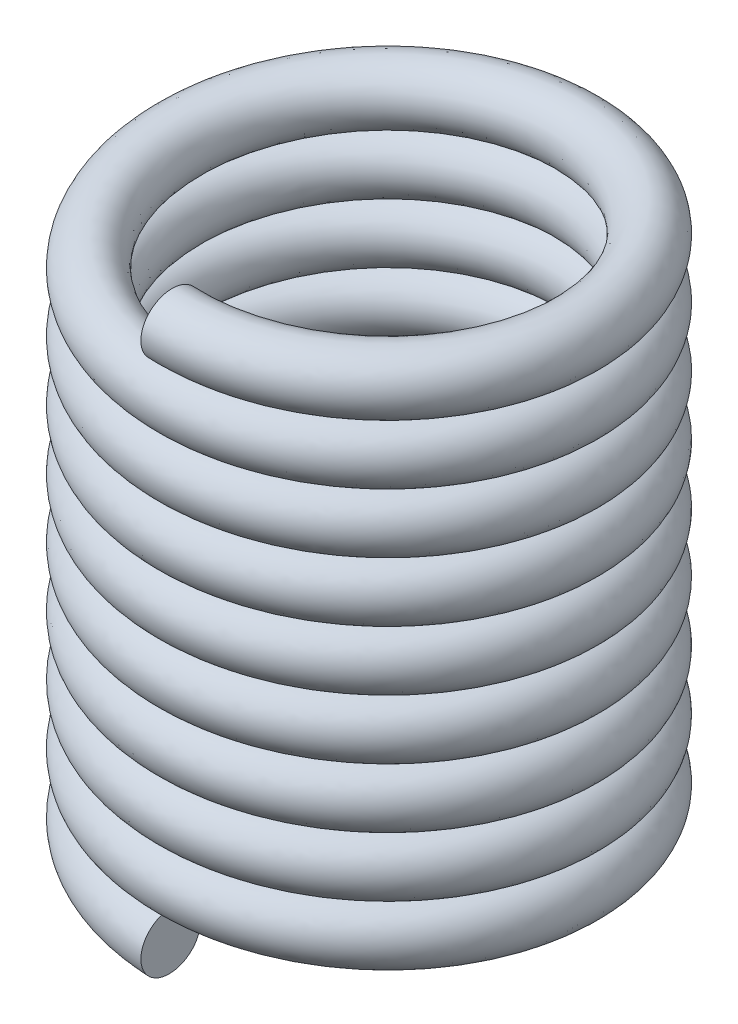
ISO-10303-21;
HEADER;
FILE_DESCRIPTION(('STEP AP214'),'2;1');
FILE_NAME('part.step','',(''),(''),'','','');
FILE_SCHEMA(('AUTOMOTIVE_DESIGN { 1 0 10303 214 1 1 1 1 }'));
ENDSEC;
DATA;
#1=APPLICATION_CONTEXT('core data for automotive mechanical design processes');
#2=APPLICATION_PROTOCOL_DEFINITION('international standard','automotive_design',2000,#1);
#3=PRODUCT_CONTEXT('',#1,'mechanical');
#4=PRODUCT('Part','Part','',(#3));
#5=PRODUCT_RELATED_PRODUCT_CATEGORY('part','',(#4));
#6=PRODUCT_DEFINITION_FORMATION('','',#4);
#7=PRODUCT_DEFINITION_CONTEXT('part definition',#1,'design');
#8=PRODUCT_DEFINITION('design','',#6,#7);
#9=PRODUCT_DEFINITION_SHAPE('','',#8);
#10=(LENGTH_UNIT() NAMED_UNIT(*) SI_UNIT(.MILLI.,.METRE.));
#11=(NAMED_UNIT(*) PLANE_ANGLE_UNIT() SI_UNIT($,.RADIAN.));
#12=(NAMED_UNIT(*) SI_UNIT($,.STERADIAN.) SOLID_ANGLE_UNIT());
#13=UNCERTAINTY_MEASURE_WITH_UNIT(LENGTH_MEASURE(1.E-05),#10,'distance_accuracy_value','');
#14=(GEOMETRIC_REPRESENTATION_CONTEXT(3) GLOBAL_UNCERTAINTY_ASSIGNED_CONTEXT((#13)) GLOBAL_UNIT_ASSIGNED_CONTEXT((#10,
#11,#12)) REPRESENTATION_CONTEXT('',''));
#15=CARTESIAN_POINT('',(0.,0.,0.));
#16=DIRECTION('',(0.,0.,1.));
#17=DIRECTION('',(1.,0.,0.));
#18=AXIS2_PLACEMENT_3D('',#15,#16,#17);
#19=CARTESIAN_POINT('',(0.,0.,10.));
#20=DIRECTION('',(-0.998862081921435,0.0476921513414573,0.));
#21=DIRECTION('',(-0.0476921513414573,-0.998862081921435,0.));
#22=AXIS2_PLACEMENT_3D('',#19,#20,#21);
#23=PLANE('',#22);
#24=CARTESIAN_POINT('',(0.,0.,10.));
#25=DIRECTION('',(-0.998862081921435,0.0476921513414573,0.));
#26=DIRECTION('',(-0.0476921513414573,-0.998862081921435,0.));
#27=AXIS2_PLACEMENT_3D('',#24,#25,#26);
#28=CIRCLE('',#27,1.5);
#29=CARTESIAN_POINT('',(-0.071538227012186,-1.49829312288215,10.));
#30=VERTEX_POINT('',#29);
#31=EDGE_CURVE('E43',#30,#30,#28,.T.);
#32=ORIENTED_EDGE('',*,*,#31,.F.);
#33=EDGE_LOOP('',(#32));
#34=FACE_BOUND('',#33,.T.);
#35=ADVANCED_FACE('F33',(#34),#23,.F.);
#36=CARTESIAN_POINT('',(-1.25693400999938E-12,27.,10.));
#37=DIRECTION('',(-0.998862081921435,0.0476921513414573,-1.25550372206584E-13));
#38=DIRECTION('',(-0.0476921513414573,-0.998862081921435,0.));
#39=AXIS2_PLACEMENT_3D('',#36,#37,#38);
#40=PLANE('',#39);
#41=CARTESIAN_POINT('',(-1.25693400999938E-12,27.,10.));
#42=DIRECTION('',(-0.998862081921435,0.0476921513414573,-1.25550372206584E-13));
#43=DIRECTION('',(-0.0476921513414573,-0.998862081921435,0.));
#44=AXIS2_PLACEMENT_3D('',#41,#42,#43);
#45=CIRCLE('',#44,1.5);
#46=CARTESIAN_POINT('',(-0.0715382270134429,25.5017068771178,9.99999999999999));
#47=VERTEX_POINT('',#46);
#48=EDGE_CURVE('E11',#47,#47,#45,.T.);
#49=ORIENTED_EDGE('',*,*,#48,.T.);
#50=EDGE_LOOP('',(#49));
#51=FACE_BOUND('',#50,.T.);
#52=ADVANCED_FACE('F50',(#51),#40,.T.);
#53=CARTESIAN_POINT('',(-0.071538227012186,-1.49829312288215,10.));
#54=CARTESIAN_POINT('',(-1.54415978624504,-1.42798062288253,9.9894651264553));
#55=CARTESIAN_POINT('',(-3.01349084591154,-1.35766812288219,9.6484566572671));
#56=CARTESIAN_POINT('',(-5.66695060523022,-1.21704312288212,8.37015613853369));
#57=CARTESIAN_POINT('',(-6.84941024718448,-1.14673062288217,7.43366815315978));
#58=CARTESIAN_POINT('',(-8.7015655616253,-1.00610562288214,5.14359793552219));
#59=CARTESIAN_POINT('',(-9.37009620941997,-0.935793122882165,3.79145618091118));
#60=CARTESIAN_POINT('',(-10.0652935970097,-0.795168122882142,0.929358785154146));
#61=CARTESIAN_POINT('',(-10.0915230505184,-0.724855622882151,-0.578796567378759));
#62=CARTESIAN_POINT('',(-9.4962697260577,-0.584230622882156,-3.46333715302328));
#63=CARTESIAN_POINT('',(-8.8751613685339,-0.513918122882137,-4.83790798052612));
#64=CARTESIAN_POINT('',(-7.10375871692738,-0.37329312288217,-7.19099819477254));
#65=CARTESIAN_POINT('',(-5.95457865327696,-0.302980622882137,-8.16803746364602));
#66=CARTESIAN_POINT('',(-3.34717391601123,-0.16235562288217,-9.53783359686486));
#67=CARTESIAN_POINT('',(-1.89058932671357,-0.0920431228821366,-9.92972884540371));
#68=CARTESIAN_POINT('',(1.05213995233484,0.0485818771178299,-10.0532007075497));
#69=CARTESIAN_POINT('',(2.53643363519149,0.118894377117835,-9.78469965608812));
#70=CARTESIAN_POINT('',(5.24942041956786,0.259519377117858,-8.63813800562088));
#71=CARTESIAN_POINT('',(6.47640702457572,0.329831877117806,-7.76079860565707));
#72=CARTESIAN_POINT('',(8.4386997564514,0.470456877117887,-5.564367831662));
#73=CARTESIAN_POINT('',(9.17277158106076,0.540769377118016,-4.24665803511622));
#74=CARTESIAN_POINT('',(10.0075680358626,0.681394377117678,-1.42211988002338));
#75=CARTESIAN_POINT('',(10.1077675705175,0.751706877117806,0.0829318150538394));
#76=CARTESIAN_POINT('',(9.65476895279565,0.892331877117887,2.99320554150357));
#77=CARTESIAN_POINT('',(9.10185574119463,0.962644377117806,4.39659698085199));
#78=CARTESIAN_POINT('',(7.4480474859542,1.10326937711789,6.83377140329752));
#79=CARTESIAN_POINT('',(6.34819270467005,1.17358187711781,7.86602137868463));
#80=CARTESIAN_POINT('',(3.81114141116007,1.31420687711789,9.36210681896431));
#81=CARTESIAN_POINT('',(2.3755407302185,1.38451937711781,9.82500123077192));
#82=CARTESIAN_POINT('',(-0.557585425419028,1.52514437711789,10.092717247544));
#83=CARTESIAN_POINT('',(-2.05326593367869,1.59545687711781,9.89737045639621));
#84=CARTESIAN_POINT('',(-4.81924392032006,1.73608187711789,8.88530984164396));
#85=CARTESIAN_POINT('',(-6.08780157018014,1.80639437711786,8.0692326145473));
#86=CARTESIAN_POINT('',(-8.15550438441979,1.94701937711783,5.97173267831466));
#87=CARTESIAN_POINT('',(-8.95334894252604,2.01733187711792,4.69162931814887));
#88=CARTESIAN_POINT('',(-9.92573336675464,2.15795687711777,1.91145496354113));
#89=CARTESIAN_POINT('',(-10.0996615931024,2.22826937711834,0.413132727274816));
#90=CARTESIAN_POINT('',(-9.79000899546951,2.36889437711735,-2.51586303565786));
#91=CARTESIAN_POINT('',(-9.30662294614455,2.43920687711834,-3.94469419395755));
#92=CARTESIAN_POINT('',(-7.77439325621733,2.57983187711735,-6.46008145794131));
#93=CARTESIAN_POINT('',(-6.72651340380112,2.65014437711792,-7.54505535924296));
#94=CARTESIAN_POINT('',(-4.26592753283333,2.79076937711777,-9.1638259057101));
#95=CARTESIAN_POINT('',(-2.85476924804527,2.8610818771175,-9.69660432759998));
#96=CARTESIAN_POINT('',(0.0616876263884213,3.00170687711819,-10.1079195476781));
#97=CARTESIAN_POINT('',(1.56515173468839,3.07201937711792,-9.98619762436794));
#98=CARTESIAN_POINT('',(4.37745744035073,3.21264437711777,-9.11107618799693));
#99=CARTESIAN_POINT('',(5.68453006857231,3.28295687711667,-8.35822713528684));
#100=CARTESIAN_POINT('',(7.85266168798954,3.42358187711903,-6.36471109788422));
#101=CARTESIAN_POINT('',(8.71235690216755,3.49389437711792,-5.12529805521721));
#102=CARTESIAN_POINT('',(9.81998673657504,3.63451937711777,-2.39618518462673));
#103=CARTESIAN_POINT('',(10.0672246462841,3.70483187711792,-0.908201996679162));
#104=CARTESIAN_POINT('',(9.90166404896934,3.84545687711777,2.0324595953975));
#105=CARTESIAN_POINT('',(9.4889696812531,3.91576937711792,3.48328829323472));
#106=CARTESIAN_POINT('',(8.08200983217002,4.05639437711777,6.07082861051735));
#107=CARTESIAN_POINT('',(7.08862934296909,4.12670687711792,7.20591264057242));
#108=CARTESIAN_POINT('',(4.71043666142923,4.26733187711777,8.94346853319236));
#109=CARTESIAN_POINT('',(3.32712037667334,4.33764437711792,9.54484745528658));
#110=CARTESIAN_POINT('',(0.434358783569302,4.47826937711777,10.0987709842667));
#111=CARTESIAN_POINT('',(-1.07326694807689,4.54858187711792,10.0509671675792));
#112=CARTESIAN_POINT('',(-3.92512528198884,4.68920687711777,9.31489315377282));
#113=CARTESIAN_POINT('',(-5.26756403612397,4.75951937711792,8.62708595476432));
#114=CARTESIAN_POINT('',(-7.5309012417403,4.90014437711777,6.74235637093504));
#115=CARTESIAN_POINT('',(-8.45037603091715,4.97045687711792,5.54661950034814));
#116=CARTESIAN_POINT('',(-9.69058289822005,5.11108187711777,2.87514278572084));
#117=CARTESIAN_POINT('',(-10.0105348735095,5.18139437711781,1.40108332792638));
#118=CARTESIAN_POINT('',(-9.98946512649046,5.32201937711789,-1.54415978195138));
#119=CARTESIAN_POINT('',(-9.64845665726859,5.39233187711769,-3.01349084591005));
#120=CARTESIAN_POINT('',(-8.37015613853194,5.532956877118,-5.66695060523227));
#121=CARTESIAN_POINT('',(-7.43366815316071,5.60326937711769,-6.84941024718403));
#122=CARTESIAN_POINT('',(-5.14359793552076,5.743894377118,-8.70156556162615));
#123=CARTESIAN_POINT('',(-3.7914561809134,5.81420687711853,-9.37009620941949));
#124=CARTESIAN_POINT('',(-0.92935878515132,5.95483187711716,-10.0652935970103));
#125=CARTESIAN_POINT('',(0.578796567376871,6.02514437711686,-10.0915230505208));
#126=CARTESIAN_POINT('',(3.46333715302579,6.16576937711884,-9.49626972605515));
#127=CARTESIAN_POINT('',(4.83790798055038,6.23608187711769,-8.87516136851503));
#128=CARTESIAN_POINT('',(7.19099819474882,6.376706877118,-7.10375871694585));
#129=CARTESIAN_POINT('',(8.16803746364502,6.44701937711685,-5.95457865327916));
#130=CARTESIAN_POINT('',(9.53783359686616,6.58764437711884,-3.34717391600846));
#131=CARTESIAN_POINT('',(9.92972884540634,6.65795687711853,-1.89058932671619));
#132=CARTESIAN_POINT('',(10.0532007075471,6.79858187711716,1.05213995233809));
#133=CARTESIAN_POINT('',(9.78469965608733,6.86889437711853,2.53643363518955));
#134=CARTESIAN_POINT('',(8.63813800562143,7.00951937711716,5.24942041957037));
#135=CARTESIAN_POINT('',(7.76079860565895,7.07983187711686,6.4764070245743));
#136=CARTESIAN_POINT('',(5.56436783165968,7.22045687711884,8.43869975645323));
#137=CARTESIAN_POINT('',(4.24665803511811,7.29076937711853,9.1727715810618));
#138=CARTESIAN_POINT('',(1.42211988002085,7.43139437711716,10.0075680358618));
#139=CARTESIAN_POINT('',(-0.0829318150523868,7.50170687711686,10.1077675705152));
#140=CARTESIAN_POINT('',(-2.99320554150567,7.64233187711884,9.65476895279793));
#141=CARTESIAN_POINT('',(-4.39659698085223,7.71264437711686,9.10185574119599));
#142=CARTESIAN_POINT('',(-6.8337714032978,7.85326937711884,7.44804748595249));
#143=CARTESIAN_POINT('',(-7.86602137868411,7.92358187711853,6.34819270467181));
#144=CARTESIAN_POINT('',(-9.36210681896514,8.06420687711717,3.81114141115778));
#145=CARTESIAN_POINT('',(-9.82500123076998,8.13451937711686,2.37554073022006));
#146=CARTESIAN_POINT('',(-10.092717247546,8.27514437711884,-0.557585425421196));
#147=CARTESIAN_POINT('',(-9.89737045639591,8.34545687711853,-2.05326593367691));
#148=CARTESIAN_POINT('',(-8.88530984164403,8.48608187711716,-4.81924392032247));
#149=CARTESIAN_POINT('',(-8.06923261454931,8.55639437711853,-6.08780157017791));
#150=CARTESIAN_POINT('',(-5.9717326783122,8.69701937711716,-8.15550438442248));
#151=CARTESIAN_POINT('',(-4.69162931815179,8.76733187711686,-8.95334894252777));
#152=CARTESIAN_POINT('',(-1.91145496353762,8.90795687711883,-9.92573336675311));
#153=CARTESIAN_POINT('',(-0.413132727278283,8.97826937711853,-10.0996615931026));
#154=CARTESIAN_POINT('',(2.51586303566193,9.11889437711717,-9.79000899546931));
#155=CARTESIAN_POINT('',(3.94469419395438,9.18920687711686,-9.30662294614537));
#156=CARTESIAN_POINT('',(6.46008145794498,9.32983187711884,-7.7743932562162));
#157=CARTESIAN_POINT('',(7.54505535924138,9.4001443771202,-6.72651340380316));
#158=CARTESIAN_POINT('',(9.16382590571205,9.54076937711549,-4.26592753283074));
#159=CARTESIAN_POINT('',(9.69660432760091,9.61108187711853,-2.85476924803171));
#160=CARTESIAN_POINT('',(10.1079195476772,9.75170687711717,0.0616876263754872));
#161=CARTESIAN_POINT('',(9.98619762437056,9.82201937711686,1.56515173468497));
#162=CARTESIAN_POINT('',(9.11107618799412,9.96264437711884,4.37745744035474));
#163=CARTESIAN_POINT('',(8.3582271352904,10.0329568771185,5.68453006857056));
#164=CARTESIAN_POINT('',(6.36471109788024,10.1735818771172,7.85266168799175));
#165=CARTESIAN_POINT('',(5.12529805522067,10.2438943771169,8.71235690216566));
#166=CARTESIAN_POINT('',(2.39618518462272,10.3845193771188,9.81998673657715));
#167=CARTESIAN_POINT('',(0.90820199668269,10.4548318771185,10.0672246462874));
#168=CARTESIAN_POINT('',(-2.03245959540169,10.5954568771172,9.901664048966));
#169=CARTESIAN_POINT('',(-3.48328829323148,10.6657693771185,9.48896968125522));
#170=CARTESIAN_POINT('',(-6.07082861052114,10.8063943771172,8.08200983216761));
#171=CARTESIAN_POINT('',(-7.20591264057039,10.8767068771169,7.08862934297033));
#172=CARTESIAN_POINT('',(-8.94346853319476,11.0173318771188,4.71043666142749));
#173=CARTESIAN_POINT('',(-9.54484745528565,11.0876443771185,3.32712037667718));
#174=CARTESIAN_POINT('',(-10.0987709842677,11.2282693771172,0.434358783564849));
#175=CARTESIAN_POINT('',(-10.0509671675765,11.2985818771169,-1.07326694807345));
#176=CARTESIAN_POINT('',(-9.31489315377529,11.4392068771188,-3.92512528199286));
#177=CARTESIAN_POINT('',(-8.62708595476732,11.5095193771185,-5.26756403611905));
#178=CARTESIAN_POINT('',(-6.74235637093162,11.6501443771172,-7.53090124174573));
#179=CARTESIAN_POINT('',(-5.54661950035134,11.7204568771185,-8.45037603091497));
#180=CARTESIAN_POINT('',(-2.87514278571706,11.8610818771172,-9.69058289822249));
#181=CARTESIAN_POINT('',(-1.40108332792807,11.9313943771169,-10.0105348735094));
#182=CARTESIAN_POINT('',(1.5441597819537,12.0720193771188,-9.98946512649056));
#183=CARTESIAN_POINT('',(3.0134908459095,12.1423318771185,-9.64845665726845));
#184=CARTESIAN_POINT('',(5.66695060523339,12.2829568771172,-8.3701561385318));
#185=CARTESIAN_POINT('',(6.84941024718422,12.3532693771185,-7.43366815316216));
#186=CARTESIAN_POINT('',(8.70156556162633,12.4938943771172,-5.14359793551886));
#187=CARTESIAN_POINT('',(9.37009620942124,12.5642068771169,-3.7914561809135));
#188=CARTESIAN_POINT('',(10.0652935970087,12.7048318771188,-0.92935878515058));
#189=CARTESIAN_POINT('',(10.091523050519,12.7751443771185,0.578796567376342));
#190=CARTESIAN_POINT('',(9.49626972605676,12.9157693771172,3.46333715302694));
#191=CARTESIAN_POINT('',(8.87516136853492,12.9860818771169,4.83790798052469));
#192=CARTESIAN_POINT('',(7.1037587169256,13.1267068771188,7.19099819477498));
#193=CARTESIAN_POINT('',(5.9545786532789,13.1970193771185,8.16803746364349));
#194=CARTESIAN_POINT('',(3.3471739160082,13.3376443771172,9.53783359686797));
#195=CARTESIAN_POINT('',(1.89058932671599,13.4079568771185,9.92972884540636));
#196=CARTESIAN_POINT('',(-1.05213995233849,13.5485818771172,10.0532007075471));
#197=CARTESIAN_POINT('',(-2.53643363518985,13.6188943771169,9.7846996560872));
#198=CARTESIAN_POINT('',(-5.24942041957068,13.7595193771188,8.6381380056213));
#199=CARTESIAN_POINT('',(-6.47640702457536,13.8298318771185,7.76079860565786));
#200=CARTESIAN_POINT('',(-8.43869975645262,13.9704568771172,5.56436783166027));
#201=CARTESIAN_POINT('',(-9.17277158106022,14.0407693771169,4.24665803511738));
#202=CARTESIAN_POINT('',(-10.0075680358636,14.1813943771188,1.42211988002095));
#203=CARTESIAN_POINT('',(-10.1077675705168,14.2517068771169,-0.0829318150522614));
#204=CARTESIAN_POINT('',(-9.65476895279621,14.3923318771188,-2.99320554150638));
#205=CARTESIAN_POINT('',(-9.10185574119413,14.4626443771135,-4.39659698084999));
#206=CARTESIAN_POINT('',(-7.44804748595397,14.6032693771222,-6.83377140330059));
#207=CARTESIAN_POINT('',(-6.34819270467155,14.6735818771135,-7.86602137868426));
#208=CARTESIAN_POINT('',(-3.81114141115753,14.8142068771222,-9.36210681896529));
#209=CARTESIAN_POINT('',(-2.37554073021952,14.8845193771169,-9.82500123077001));
#210=CARTESIAN_POINT('',(0.557585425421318,15.0251443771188,-10.092717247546));
#211=CARTESIAN_POINT('',(2.05326593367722,15.0954568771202,-9.89737045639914));
#212=CARTESIAN_POINT('',(4.81924392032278,15.2360818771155,-8.88530984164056));
#213=CARTESIAN_POINT('',(6.08780157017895,15.3063943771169,-8.06923261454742));
#214=CARTESIAN_POINT('',(8.15550438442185,15.4470193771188,-5.97173267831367));
#215=CARTESIAN_POINT('',(8.95334894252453,15.5173318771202,-4.69162931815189));
#216=CARTESIAN_POINT('',(9.92573336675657,15.6579568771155,-1.91145496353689));
#217=CARTESIAN_POINT('',(10.0996615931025,15.7282693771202,-0.413132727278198));
#218=CARTESIAN_POINT('',(9.79000899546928,15.8688943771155,2.51586303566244));
#219=CARTESIAN_POINT('',(9.30662294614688,15.9392068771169,3.9446941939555));
#220=CARTESIAN_POINT('',(7.77439325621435,16.0798318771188,6.46008145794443));
#221=CARTESIAN_POINT('',(6.72651340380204,16.1501443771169,7.54505535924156));
#222=CARTESIAN_POINT('',(4.2659275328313,16.2907693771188,9.16382590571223));
#223=CARTESIAN_POINT('',(2.85476924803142,16.3610818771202,9.69660432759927));
#224=CARTESIAN_POINT('',(-0.0616876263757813,16.5017068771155,10.107919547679));
#225=CARTESIAN_POINT('',(-1.56515173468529,16.5720193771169,9.98619762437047));
#226=CARTESIAN_POINT('',(-4.37745744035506,16.7126443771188,9.11107618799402));
#227=CARTESIAN_POINT('',(-5.68453006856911,16.7829568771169,8.35822713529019));
#228=CARTESIAN_POINT('',(-7.85266168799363,16.9235818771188,6.36471109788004));
#229=CARTESIAN_POINT('',(-8.71235690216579,16.9938943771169,5.12529805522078));
#230=CARTESIAN_POINT('',(-9.81998673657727,17.1345193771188,2.396185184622));
#231=CARTESIAN_POINT('',(-10.067224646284,17.2048318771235,0.908201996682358));
#232=CARTESIAN_POINT('',(-9.90166404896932,17.3454568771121,-2.03245959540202));
#233=CARTESIAN_POINT('',(-9.48896968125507,17.4157693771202,-3.48328829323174));
#234=CARTESIAN_POINT('',(-8.08200983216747,17.5563943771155,-6.0708286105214));
#235=CARTESIAN_POINT('',(-7.08862934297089,17.6267068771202,-7.20591264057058));
#236=CARTESIAN_POINT('',(-4.71043666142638,17.7673318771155,-8.94346853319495));
#237=CARTESIAN_POINT('',(-3.32712037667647,17.8376443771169,-9.54484745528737));
#238=CARTESIAN_POINT('',(-0.434358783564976,17.9782693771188,-10.0987709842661));
#239=CARTESIAN_POINT('',(1.07326694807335,18.0485818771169,-10.0509671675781));
#240=CARTESIAN_POINT('',(3.9251252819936,18.1892068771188,-9.31489315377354));
#241=CARTESIAN_POINT('',(5.26756403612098,18.2595193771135,-8.6270859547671));
#242=CARTESIAN_POINT('',(7.53090124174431,18.4001443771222,-6.7423563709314));
#243=CARTESIAN_POINT('',(8.45037603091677,18.4704568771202,-5.54661950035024));
#244=CARTESIAN_POINT('',(9.69058289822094,18.6110818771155,-2.87514278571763));
#245=CARTESIAN_POINT('',(10.0105348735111,18.6813943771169,-1.40108332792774));
#246=CARTESIAN_POINT('',(9.98946512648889,18.8220193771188,1.54415978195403));
#247=CARTESIAN_POINT('',(9.64845665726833,18.8923318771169,3.0134908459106));
#248=CARTESIAN_POINT('',(8.37015613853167,19.0329568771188,5.66695060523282));
#249=CARTESIAN_POINT('',(7.43366815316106,19.1032693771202,6.84941024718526));
#250=CARTESIAN_POINT('',(5.14359793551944,19.2438943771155,8.70156556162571));
#251=CARTESIAN_POINT('',(3.79145618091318,19.3142068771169,9.37009620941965));
#252=CARTESIAN_POINT('',(0.929358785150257,19.4548318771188,10.0652935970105));
#253=CARTESIAN_POINT('',(-0.578796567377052,19.5251443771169,10.0915230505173));
#254=CARTESIAN_POINT('',(-3.46333715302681,19.6657693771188,9.49626972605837));
#255=CARTESIAN_POINT('',(-4.83790798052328,19.7360818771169,8.87516136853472));
#256=CARTESIAN_POINT('',(-7.19099819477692,19.8767068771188,7.1037587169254));
#257=CARTESIAN_POINT('',(-8.16803746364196,19.9470193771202,5.95457865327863));
#258=CARTESIAN_POINT('',(-9.53783359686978,20.0876443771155,3.34717391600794));
#259=CARTESIAN_POINT('',(-9.9297288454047,20.1579568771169,1.89058932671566));
#260=CARTESIAN_POINT('',(-10.0532007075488,20.2985818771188,-1.05213995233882));
#261=CARTESIAN_POINT('',(-9.78469965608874,20.3688943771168,-2.53643363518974));
#262=CARTESIAN_POINT('',(-8.6381380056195,20.5095193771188,-5.2494204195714));
#263=CARTESIAN_POINT('',(-7.76079860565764,20.5798318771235,-6.47640702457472));
#264=CARTESIAN_POINT('',(-5.56436783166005,20.7204568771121,-8.43869975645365));
#265=CARTESIAN_POINT('',(-4.24665803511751,20.7907693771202,-9.17277158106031));
#266=CARTESIAN_POINT('',(-1.42211988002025,20.9313943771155,-10.0075680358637));
#267=CARTESIAN_POINT('',(0.0829318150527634,21.0017068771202,-10.1077675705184));
#268=CARTESIAN_POINT('',(2.99320554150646,21.1423318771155,-9.65476895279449));
#269=CARTESIAN_POINT('',(4.39659698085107,21.2126443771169,-9.10185574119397));
#270=CARTESIAN_POINT('',(6.83377140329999,21.3532693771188,-7.4480474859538));
#271=CARTESIAN_POINT('',(7.86602137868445,21.4235818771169,-6.34819270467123));
#272=CARTESIAN_POINT('',(9.36210681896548,21.5642068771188,-3.81114141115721));
#273=CARTESIAN_POINT('',(9.82500123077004,21.6345193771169,-2.37554073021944));
#274=CARTESIAN_POINT('',(10.0927172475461,21.7751443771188,0.557585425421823));
#275=CARTESIAN_POINT('',(9.89737045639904,21.8454568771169,2.0532659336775));
#276=CARTESIAN_POINT('',(8.88530984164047,21.9860818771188,4.81924392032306));
#277=CARTESIAN_POINT('',(8.06923261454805,22.0563943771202,6.08780157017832));
#278=CARTESIAN_POINT('',(5.97173267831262,22.1970193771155,8.15550438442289));
#279=CARTESIAN_POINT('',(4.69162931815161,22.2673318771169,8.95334894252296));
#280=CARTESIAN_POINT('',(1.91145496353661,22.4079568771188,9.92573336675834));
#281=CARTESIAN_POINT('',(0.413132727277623,22.4782693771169,10.0996615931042));
#282=CARTESIAN_POINT('',(-2.51586303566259,22.6188943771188,9.79000899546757));
#283=CARTESIAN_POINT('',(-3.94469419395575,22.6892068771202,9.30662294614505));
#284=CARTESIAN_POINT('',(-6.46008145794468,22.8298318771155,7.77439325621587));
#285=CARTESIAN_POINT('',(-7.54505535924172,22.9001443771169,6.72651340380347));
#286=CARTESIAN_POINT('',(-9.16382590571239,23.0407693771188,4.26592753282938));
#287=CARTESIAN_POINT('',(-9.69660432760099,23.1110818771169,2.85476924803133));
#288=CARTESIAN_POINT('',(-10.1079195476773,23.2517068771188,-0.0616876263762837));
#289=CARTESIAN_POINT('',(-9.98619762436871,23.3220193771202,-1.56515173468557));
#290=CARTESIAN_POINT('',(-9.11107618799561,23.4626443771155,-4.37745744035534));
#291=CARTESIAN_POINT('',(-8.35822713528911,23.5329568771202,-5.68453006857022));
#292=CARTESIAN_POINT('',(-6.36471109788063,23.6735818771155,-7.85266168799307));
#293=CARTESIAN_POINT('',(-5.12529805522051,23.7438943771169,-8.71235690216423));
#294=CARTESIAN_POINT('',(-2.39618518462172,23.8845193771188,-9.81998673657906));
#295=CARTESIAN_POINT('',(-0.908201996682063,23.9548318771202,-10.0672246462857));
#296=CARTESIAN_POINT('',(2.03245959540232,24.0954568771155,-9.90166404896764));
#297=CARTESIAN_POINT('',(3.483288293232,24.1657693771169,-9.48896968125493));
#298=CARTESIAN_POINT('',(6.07082861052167,24.3063943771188,-8.08200983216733));
#299=CARTESIAN_POINT('',(7.20591264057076,24.3767068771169,-7.08862934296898));
#300=CARTESIAN_POINT('',(8.94346853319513,24.5173318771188,-4.71043666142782));
#301=CARTESIAN_POINT('',(9.54484745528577,24.5876443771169,-3.32712037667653));
#302=CARTESIAN_POINT('',(10.0987709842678,24.7282693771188,-0.434358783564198));
#303=CARTESIAN_POINT('',(10.050967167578,24.7985818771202,1.07326694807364));
#304=CARTESIAN_POINT('',(9.31489315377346,24.9392068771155,3.92512528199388));
#305=CARTESIAN_POINT('',(8.62708595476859,25.0095193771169,5.26756403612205));
#306=CARTESIAN_POINT('',(6.74235637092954,25.1501443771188,7.5309012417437));
#307=CARTESIAN_POINT('',(5.54661950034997,25.2204568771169,8.45037603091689));
#308=CARTESIAN_POINT('',(2.87514278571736,25.3610818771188,9.69058289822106));
#309=CARTESIAN_POINT('',(1.40108333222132,25.4313943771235,10.0105348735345));
#310=CARTESIAN_POINT('',(-0.0715382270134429,25.5017068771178,9.99999999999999));
#311=CARTESIAN_POINT('',(-0.071538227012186,-1.49829312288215,13.));
#312=CARTESIAN_POINT('',(-1.98594625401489,-1.42798062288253,12.9894651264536));
#313=CARTESIAN_POINT('',(-3.89678589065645,-1.35766812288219,12.5493125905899));
#314=CARTESIAN_POINT('',(-7.348986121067,-1.21704312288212,10.8932359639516));
#315=CARTESIAN_POINT('',(-8.88817523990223,-1.14673062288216,9.67835356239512));
#316=CARTESIAN_POINT('',(-11.300863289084,-1.00610562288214,6.70527223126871));
#317=CARTESIAN_POINT('',(-12.1728446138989,-0.935793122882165,4.94894340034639));
#318=CARTESIAN_POINT('',(-13.082732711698,-0.795168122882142,1.2297526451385));
#319=CARTESIAN_POINT('',(-13.1200671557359,-0.724855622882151,-0.730769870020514));
#320=CARTESIAN_POINT('',(-12.3524373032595,-0.584230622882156,-4.48190578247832));
#321=CARTESIAN_POINT('',(-11.5479558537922,-0.513918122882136,-6.27015967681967));
#322=CARTESIAN_POINT('',(-9.25020942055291,-0.37329312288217,-9.33294232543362));
#323=CARTESIAN_POINT('',(-7.7583897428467,-0.302980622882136,-10.6055445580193));
#324=CARTESIAN_POINT('',(-4.37174324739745,-0.16235562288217,-12.3918540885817));
#325=CARTESIAN_POINT('',(-2.47904666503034,-0.0920431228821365,-12.9044377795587));
#326=CARTESIAN_POINT('',(1.34619124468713,0.0485818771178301,-13.0712645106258));
#327=CARTESIAN_POINT('',(3.27632645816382,0.118894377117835,-12.7254026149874));
#328=CARTESIAN_POINT('',(6.80562819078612,0.259519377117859,-11.2407122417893));
#329=CARTESIAN_POINT('',(8.40257474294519,0.329831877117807,-10.102817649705));
#330=CARTESIAN_POINT('',(10.9582387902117,0.470456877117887,-7.25170251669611));
#331=CARTESIAN_POINT('',(11.9153487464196,0.540769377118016,-5.54027535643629));
#332=CARTESIAN_POINT('',(13.0066328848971,0.681394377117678,-1.87021062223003));
#333=CARTESIAN_POINT('',(13.1401206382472,0.751706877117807,0.0861184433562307));
#334=CARTESIAN_POINT('',(12.5574749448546,0.892331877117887,3.87040175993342));
#335=CARTESIAN_POINT('',(11.8417079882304,0.962644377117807,5.69597565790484));
#336=CARTESIAN_POINT('',(9.69701291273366,1.10326937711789,8.86781412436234));
#337=CARTESIAN_POINT('',(8.2694338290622,1.17358187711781,10.21208357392));
#338=CARTESIAN_POINT('',(4.97451675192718,1.31420687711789,12.1624162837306));
#339=CARTESIAN_POINT('',(3.1092512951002,1.38451937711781,12.7672527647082));
#340=CARTESIAN_POINT('',(-0.703193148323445,1.52514437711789,13.1215740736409));
#341=CARTESIAN_POINT('',(-2.64797406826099,1.59545687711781,12.8708360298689));
#342=CARTESIAN_POINT('',(-6.24587490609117,1.73608187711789,11.5611086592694));
#343=CARTESIAN_POINT('',(-7.89673170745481,1.80639437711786,10.5029431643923));
#344=CARTESIAN_POINT('',(-10.5892149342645,1.94701937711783,7.78066281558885));
#345=CARTESIAN_POINT('',(-11.6291477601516,2.01733187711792,6.11826030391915));
#346=CARTESIAN_POINT('',(-12.8991989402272,2.15795687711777,2.50616309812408));
#347=CARTESIAN_POINT('',(-13.1285184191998,2.22826937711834,0.558740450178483));
#348=CARTESIAN_POINT('',(-12.7322605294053,2.36889437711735,-3.249573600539));
#349=CARTESIAN_POINT('',(-12.106932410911,2.43920687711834,-5.10806953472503));
#350=CARTESIAN_POINT('',(-10.1204554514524,2.57983187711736,-8.38132258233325));
#351=CARTESIAN_POINT('',(-8.76055612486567,2.65014437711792,-9.79402078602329));
#352=CARTESIAN_POINT('',(-5.5653062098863,2.79076937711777,-11.9036781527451));
#353=CARTESIAN_POINT('',(-3.73196546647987,2.8610818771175,-12.5993103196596));
#354=CARTESIAN_POINT('',(0.0585009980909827,3.00170687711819,-13.1402726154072));
#355=CARTESIAN_POINT('',(2.0132424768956,3.07201937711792,-12.9852624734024));
#356=CARTESIAN_POINT('',(5.67107476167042,3.21264437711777,-11.8536533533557));
#357=CARTESIAN_POINT('',(7.37186475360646,3.28295687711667,-10.8777661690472));
#358=CARTESIAN_POINT('',(10.1946807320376,3.42358187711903,-8.2908788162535));
#359=CARTESIAN_POINT('',(11.3149311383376,3.49389437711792,-6.68150582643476));
#360=CARTESIAN_POINT('',(12.7606896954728,3.63451937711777,-3.13607800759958));
#361=CARTESIAN_POINT('',(13.0852884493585,3.70483187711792,-1.20225328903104));
#362=CARTESIAN_POINT('',(12.8763729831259,3.84545687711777,2.62091693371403));
#363=CARTESIAN_POINT('',(12.3429901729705,3.91576937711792,4.50785762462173));
#364=CARTESIAN_POINT('',(10.5195169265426,4.05639437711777,7.87463970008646));
#365=CARTESIAN_POINT('',(9.23057347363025,4.12670687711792,9.3523633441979));
#366=CARTESIAN_POINT('',(6.14268835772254,4.26733187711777,11.6162630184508));
#367=CARTESIAN_POINT('',(4.34568900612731,4.33764437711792,12.4010150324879));
#368=CARTESIAN_POINT('',(0.586332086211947,4.47826937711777,13.1273150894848));
#369=CARTESIAN_POINT('',(-1.37366080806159,4.54858187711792,13.068406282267));
#370=CARTESIAN_POINT('',(-5.08261250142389,4.68920687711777,12.1176415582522));
#371=CARTESIAN_POINT('',(-6.82923833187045,4.75951937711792,11.2263836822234));
#372=CARTESIAN_POINT('',(-9.77558665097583,4.90014437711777,8.78112136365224));
#373=CARTESIAN_POINT('',(-10.9734558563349,4.97045687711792,7.22865501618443));
#374=CARTESIAN_POINT('',(-12.591438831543,5.11108187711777,3.75843783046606));
#375=CARTESIAN_POINT('',(-13.0105348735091,5.18139437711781,1.84286979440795));
#376=CARTESIAN_POINT('',(-12.9894651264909,5.32201937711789,-1.98594624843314));
#377=CARTESIAN_POINT('',(-12.5493125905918,5.39233187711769,-3.89678589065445));
#378=CARTESIAN_POINT('',(-10.8932359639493,5.532956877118,-7.34898612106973));
#379=CARTESIAN_POINT('',(-9.67835356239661,5.60326937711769,-8.88817523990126));
#380=CARTESIAN_POINT('',(-6.70527223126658,5.743894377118,-11.3008632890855));
#381=CARTESIAN_POINT('',(-4.94894340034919,5.81420687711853,-12.1728446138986));
#382=CARTESIAN_POINT('',(-1.22975264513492,5.95483187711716,-13.0827327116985));
#383=CARTESIAN_POINT('',(0.730769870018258,6.02514437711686,-13.12006715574));
#384=CARTESIAN_POINT('',(4.48190578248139,6.16576937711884,-12.3524373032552));
#385=CARTESIAN_POINT('',(6.27015967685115,6.23608187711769,-11.5479558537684));
#386=CARTESIAN_POINT('',(9.33294232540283,6.376706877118,-9.25020942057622));
#387=CARTESIAN_POINT('',(10.6055445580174,6.44701937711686,-7.75838974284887));
#388=CARTESIAN_POINT('',(12.391854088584,6.58764437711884,-4.37174324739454));
#389=CARTESIAN_POINT('',(12.904437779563,6.65795687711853,-2.47904666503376));
#390=CARTESIAN_POINT('',(13.0712645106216,6.79858187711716,1.34619124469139));
#391=CARTESIAN_POINT('',(12.7254026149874,6.86889437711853,3.27632645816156));
#392=CARTESIAN_POINT('',(11.240712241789,7.00951937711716,6.80562819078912));
#393=CARTESIAN_POINT('',(10.1028176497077,7.07983187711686,8.40257474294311));
#394=CARTESIAN_POINT('',(7.25170251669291,7.22045687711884,10.9582387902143));
#395=CARTESIAN_POINT('',(5.54027535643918,7.29076937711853,11.9153487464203));
#396=CARTESIAN_POINT('',(1.87021062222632,7.43139437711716,13.0066328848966));
#397=CARTESIAN_POINT('',(-0.0861184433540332,7.50170687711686,13.1401206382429));
#398=CARTESIAN_POINT('',(-3.87040175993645,7.64233187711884,12.5574749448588));
#399=CARTESIAN_POINT('',(-5.69597565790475,7.71264437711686,11.8417079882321));
#400=CARTESIAN_POINT('',(-8.86781412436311,7.85326937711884,9.69701291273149));
#401=CARTESIAN_POINT('',(-10.2120835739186,7.92358187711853,8.26943382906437));
#402=CARTESIAN_POINT('',(-12.1624162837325,8.06420687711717,4.97451675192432));
#403=CARTESIAN_POINT('',(-12.7672527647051,8.13451937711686,3.10925129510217));
#404=CARTESIAN_POINT('',(-13.1215740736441,8.27514437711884,-0.703193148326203));
#405=CARTESIAN_POINT('',(-12.8708360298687,8.34545687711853,-2.64797406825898));
#406=CARTESIAN_POINT('',(-11.5611086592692,8.48608187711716,-6.24587490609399));
#407=CARTESIAN_POINT('',(-10.5029431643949,8.55639437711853,-7.89673170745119));
#408=CARTESIAN_POINT('',(-7.7806628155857,8.69701937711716,-10.5892149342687));
#409=CARTESIAN_POINT('',(-6.11826030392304,8.76733187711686,-11.6291477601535));
#410=CARTESIAN_POINT('',(-2.50616309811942,8.90795687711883,-12.8991989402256));
#411=CARTESIAN_POINT('',(-0.55874045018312,8.97826937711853,-13.1285184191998));
#412=CARTESIAN_POINT('',(3.24957360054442,9.11889437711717,-12.7322605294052));
#413=CARTESIAN_POINT('',(5.10806953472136,9.18920687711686,-12.1069324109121));
#414=CARTESIAN_POINT('',(8.38132258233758,9.32983187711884,-10.1204554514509));
#415=CARTESIAN_POINT('',(9.79402078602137,9.4001443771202,-8.76055612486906));
#416=CARTESIAN_POINT('',(11.9036781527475,9.54076937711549,-5.56530620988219));
#417=CARTESIAN_POINT('',(12.5993103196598,9.61108187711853,-3.73196546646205));
#418=CARTESIAN_POINT('',(13.1402726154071,9.75170687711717,0.0585009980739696));
#419=CARTESIAN_POINT('',(12.9852624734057,9.82201937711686,2.01324247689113));
#420=CARTESIAN_POINT('',(11.8536533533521,9.96264437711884,5.67107476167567));
#421=CARTESIAN_POINT('',(10.8777661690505,10.0329568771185,7.37186475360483));
#422=CARTESIAN_POINT('',(8.29087881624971,10.1735818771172,10.1946807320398));
#423=CARTESIAN_POINT('',(6.68150582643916,10.2438943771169,11.3149311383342));
#424=CARTESIAN_POINT('',(3.13607800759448,10.3845193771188,12.7606896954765));
#425=CARTESIAN_POINT('',(1.20225328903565,10.4548318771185,13.0852884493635));
#426=CARTESIAN_POINT('',(-2.6209169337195,10.5954568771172,12.8763729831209));
#427=CARTESIAN_POINT('',(-4.50785762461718,10.6657693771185,12.3429901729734));
#428=CARTESIAN_POINT('',(-7.87463970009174,10.8063943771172,10.5195169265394));
#429=CARTESIAN_POINT('',(-9.35236334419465,10.8767068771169,9.23057347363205));
#430=CARTESIAN_POINT('',(-11.6162630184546,11.0173318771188,6.14268835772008));
#431=CARTESIAN_POINT('',(-12.4010150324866,11.0876443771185,4.34568900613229));
#432=CARTESIAN_POINT('',(-13.1273150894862,11.2282693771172,0.586332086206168));
#433=CARTESIAN_POINT('',(-13.0684062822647,11.2985818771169,-1.37366080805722));
#434=CARTESIAN_POINT('',(-12.1176415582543,11.4392068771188,-5.08261250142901));
#435=CARTESIAN_POINT('',(-11.226383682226,11.5095193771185,-6.82923833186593));
#436=CARTESIAN_POINT('',(-8.78112136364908,11.6501443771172,-9.77558665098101));
#437=CARTESIAN_POINT('',(-7.22865501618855,11.7204568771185,-10.9734558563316));
#438=CARTESIAN_POINT('',(-3.75843783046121,11.8610818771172,-12.5914388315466));
#439=CARTESIAN_POINT('',(-1.84286979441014,11.9313943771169,-13.010534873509));
#440=CARTESIAN_POINT('',(1.98594624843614,12.0720193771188,-12.989465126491));
#441=CARTESIAN_POINT('',(3.89678589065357,12.1423318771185,-12.549312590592));
#442=CARTESIAN_POINT('',(7.34898612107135,12.2829568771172,-10.8932359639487));
#443=CARTESIAN_POINT('',(8.8881752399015,12.3532693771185,-9.67835356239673));
#444=CARTESIAN_POINT('',(11.3008632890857,12.4938943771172,-6.70527223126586));
#445=CARTESIAN_POINT('',(12.1728446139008,12.5642068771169,-4.94894340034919));
#446=CARTESIAN_POINT('',(13.0827327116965,12.7048318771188,-1.22975264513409));
#447=CARTESIAN_POINT('',(13.120067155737,12.7751443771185,0.730769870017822));
#448=CARTESIAN_POINT('',(12.3524373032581,12.9157693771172,4.48190578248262));
#449=CARTESIAN_POINT('',(11.5479558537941,12.9860818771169,6.27015967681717));
#450=CARTESIAN_POINT('',(9.25020942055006,13.1267068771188,9.33294232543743));
#451=CARTESIAN_POINT('',(7.75838974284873,13.1970193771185,10.6055445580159));
#452=CARTESIAN_POINT('',(4.37174324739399,13.3376443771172,12.3918540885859));
#453=CARTESIAN_POINT('',(2.47904666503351,13.4079568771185,12.9044377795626));
#454=CARTESIAN_POINT('',(-1.3461912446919,13.5485818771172,13.071264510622));
#455=CARTESIAN_POINT('',(-3.27632645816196,13.6188943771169,12.7254026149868));
#456=CARTESIAN_POINT('',(-6.80562819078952,13.7595193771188,11.2407122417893));
#457=CARTESIAN_POINT('',(-8.40257474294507,13.8298318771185,10.1028176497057));
#458=CARTESIAN_POINT('',(-10.9582387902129,13.9704568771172,7.25170251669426));
#459=CARTESIAN_POINT('',(-11.9153487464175,14.0407693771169,5.54027535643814));
#460=CARTESIAN_POINT('',(-13.0066328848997,14.1813943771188,1.87021062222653));
#461=CARTESIAN_POINT('',(-13.1401206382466,14.2517068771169,-0.0861184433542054));
#462=CARTESIAN_POINT('',(-12.557474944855,14.3923318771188,-3.87040175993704));
#463=CARTESIAN_POINT('',(-11.8417079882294,14.4626443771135,-5.6959756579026));
#464=CARTESIAN_POINT('',(-9.69701291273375,14.6032693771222,-8.86781412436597));
#465=CARTESIAN_POINT('',(-8.26943382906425,14.6735818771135,-10.2120835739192));
#466=CARTESIAN_POINT('',(-4.97451675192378,14.8142068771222,-12.1624162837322));
#467=CARTESIAN_POINT('',(-3.10925129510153,14.8845193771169,-12.7672527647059));
#468=CARTESIAN_POINT('',(0.703193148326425,15.0251443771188,-13.1215740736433));
#469=CARTESIAN_POINT('',(2.6479740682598,15.0954568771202,-12.8708360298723));
#470=CARTESIAN_POINT('',(6.24587490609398,15.2360818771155,-11.5611086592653));
#471=CARTESIAN_POINT('',(7.8967317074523,15.3063943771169,-10.5029431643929));
#472=CARTESIAN_POINT('',(10.5892149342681,15.4470193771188,-7.7806628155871));
#473=CARTESIAN_POINT('',(11.6291477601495,15.5173318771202,-6.11826030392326));
#474=CARTESIAN_POINT('',(12.8991989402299,15.6579568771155,-2.50616309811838));
#475=CARTESIAN_POINT('',(13.1285184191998,15.7282693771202,-0.558740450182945));
#476=CARTESIAN_POINT('',(12.7322605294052,15.8688943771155,3.24957360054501));
#477=CARTESIAN_POINT('',(12.1069324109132,15.9392068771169,5.10806953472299));
#478=CARTESIAN_POINT('',(10.1204554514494,16.0798318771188,8.38132258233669));
#479=CARTESIAN_POINT('',(8.76055612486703,16.1501443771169,9.79402078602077));
#480=CARTESIAN_POINT('',(5.5653062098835,16.2907693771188,11.9036781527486));
#481=CARTESIAN_POINT('',(3.73196546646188,16.3610818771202,12.5993103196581));
#482=CARTESIAN_POINT('',(-0.0585009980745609,16.5017068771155,13.1402726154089));
#483=CARTESIAN_POINT('',(-2.01324247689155,16.5720193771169,12.9852624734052));
#484=CARTESIAN_POINT('',(-5.67107476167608,16.7126443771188,11.8536533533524));
#485=CARTESIAN_POINT('',(-7.37186475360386,16.7829568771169,10.8777661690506));
#486=CARTESIAN_POINT('',(-10.1946807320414,16.9235818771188,8.29087881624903));
#487=CARTESIAN_POINT('',(-11.3149311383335,16.9938943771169,6.68150582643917));
#488=CARTESIAN_POINT('',(-12.7606896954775,17.1345193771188,3.13607800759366));
#489=CARTESIAN_POINT('',(-13.0852884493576,17.2048318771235,1.20225328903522));
#490=CARTESIAN_POINT('',(-12.8763729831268,17.3454568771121,-2.62091693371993));
#491=CARTESIAN_POINT('',(-12.342990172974,17.4157693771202,-4.50785762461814));
#492=CARTESIAN_POINT('',(-10.5195169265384,17.5563943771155,-7.87463970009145));
#493=CARTESIAN_POINT('',(-9.23057347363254,17.6267068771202,-9.35236334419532));
#494=CARTESIAN_POINT('',(-6.14268835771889,17.7673318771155,-11.6162630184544));
#495=CARTESIAN_POINT('',(-4.34568900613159,17.8376443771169,-12.4010150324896));
#496=CARTESIAN_POINT('',(-0.586332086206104,17.9782693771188,-13.1273150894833));
#497=CARTESIAN_POINT('',(1.37366080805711,18.0485818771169,-13.0684062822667));
#498=CARTESIAN_POINT('',(5.08261250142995,18.1892068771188,-12.1176415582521));
#499=CARTESIAN_POINT('',(6.82923833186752,18.2595193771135,-11.2263836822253));
#500=CARTESIAN_POINT('',(9.77558665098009,18.4001443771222,-8.78112136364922));
#501=CARTESIAN_POINT('',(10.9734558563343,18.4704568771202,-7.22865501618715));
#502=CARTESIAN_POINT('',(12.5914388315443,18.6110818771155,-3.75843783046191));
#503=CARTESIAN_POINT('',(13.0105348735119,18.6813943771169,-1.84286979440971));
#504=CARTESIAN_POINT('',(12.989465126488,18.8220193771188,1.98594624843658));
#505=CARTESIAN_POINT('',(12.5493125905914,18.8923318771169,3.89678589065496));
#506=CARTESIAN_POINT('',(10.893235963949,19.0329568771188,7.34898612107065));
#507=CARTESIAN_POINT('',(9.67835356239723,19.1032693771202,8.88817523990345));
#508=CARTESIAN_POINT('',(6.70527223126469,19.2438943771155,11.3008632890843));
#509=CARTESIAN_POINT('',(4.94894340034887,19.3142068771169,12.1728446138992));
#510=CARTESIAN_POINT('',(1.22975264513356,19.4548318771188,13.0827327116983));
#511=CARTESIAN_POINT('',(-0.730769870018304,19.5251443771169,13.1200671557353));
#512=CARTESIAN_POINT('',(-4.4819057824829,19.6657693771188,12.3524373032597));
#513=CARTESIAN_POINT('',(-6.27015967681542,19.7360818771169,11.5479558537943));
#514=CARTESIAN_POINT('',(-9.33294232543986,19.8767068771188,9.25020942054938));
#515=CARTESIAN_POINT('',(-10.6055445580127,19.9470193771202,7.75838974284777));
#516=CARTESIAN_POINT('',(-12.3918540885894,20.0876443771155,4.37174324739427));
#517=CARTESIAN_POINT('',(-12.9044377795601,20.1579568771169,2.47904666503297));
#518=CARTESIAN_POINT('',(-13.0712645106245,20.2985818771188,-1.34619124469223));
#519=CARTESIAN_POINT('',(-12.7254026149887,20.3688943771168,-3.27632645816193));
#520=CARTESIAN_POINT('',(-11.240712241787,20.5095193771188,-6.80562819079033));
#521=CARTESIAN_POINT('',(-10.102817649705,20.5798318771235,-8.40257474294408));
#522=CARTESIAN_POINT('',(-7.25170251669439,20.7204568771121,-10.9582387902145));
#523=CARTESIAN_POINT('',(-5.54027535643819,20.7907693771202,-11.9153487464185));
#524=CARTESIAN_POINT('',(-1.87021062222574,20.9313943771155,-13.0066328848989));
#525=CARTESIAN_POINT('',(0.0861184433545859,21.0017068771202,-13.1401206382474));
#526=CARTESIAN_POINT('',(3.87040175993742,21.1423318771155,-12.5574749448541));
#527=CARTESIAN_POINT('',(5.69597565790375,21.2126443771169,-11.8417079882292));
#528=CARTESIAN_POINT('',(8.86781412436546,21.3532693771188,-9.69701291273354));
#529=CARTESIAN_POINT('',(10.2120835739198,21.4235818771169,-8.26943382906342));
#530=CARTESIAN_POINT('',(12.1624162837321,21.5642068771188,-4.97451675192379));
#531=CARTESIAN_POINT('',(12.7672527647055,21.6345193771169,-3.10925129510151));
#532=CARTESIAN_POINT('',(13.1215740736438,21.7751443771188,0.703193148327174));
#533=CARTESIAN_POINT('',(12.8708360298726,21.8454568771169,2.64797406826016));
#534=CARTESIAN_POINT('',(11.5611086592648,21.9860818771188,6.24587490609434));
#535=CARTESIAN_POINT('',(10.5029431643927,22.0563943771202,7.8967317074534));
#536=CARTESIAN_POINT('',(7.78066281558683,22.1970193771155,10.5892149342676));
#537=CARTESIAN_POINT('',(6.11826030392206,22.2673318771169,11.6291477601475));
#538=CARTESIAN_POINT('',(2.50616309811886,22.4079568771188,12.8991989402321));
#539=CARTESIAN_POINT('',(0.558740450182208,22.4782693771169,13.1285184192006));
#540=CARTESIAN_POINT('',(-3.24957360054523,22.6188943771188,12.7322605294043));
#541=CARTESIAN_POINT('',(-5.10806953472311,22.6892068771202,12.1069324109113));
#542=CARTESIAN_POINT('',(-8.38132258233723,22.8298318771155,10.1204554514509));
#543=CARTESIAN_POINT('',(-9.79402078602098,22.9001443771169,8.76055612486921));
#544=CARTESIAN_POINT('',(-11.9036781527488,23.0407693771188,5.56530620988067));
#545=CARTESIAN_POINT('',(-12.5993103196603,23.1110818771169,3.7319654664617));
#546=CARTESIAN_POINT('',(-13.1402726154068,23.2517068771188,-0.0585009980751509));
#547=CARTESIAN_POINT('',(-12.9852624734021,23.3220193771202,-2.0132424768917));
#548=CARTESIAN_POINT('',(-11.8536533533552,23.4626443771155,-5.67107476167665));
#549=CARTESIAN_POINT('',(-10.8777661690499,23.5329568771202,-7.37186475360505));
#550=CARTESIAN_POINT('',(-8.29087881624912,23.6735818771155,-10.1946807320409));
#551=CARTESIAN_POINT('',(-6.68150582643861,23.7438943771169,-11.3149311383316));
#552=CARTESIAN_POINT('',(-3.13607800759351,23.8845193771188,-12.7606896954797));
#553=CARTESIAN_POINT('',(-1.20225328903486,23.9548318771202,-13.0852884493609));
#554=CARTESIAN_POINT('',(2.62091693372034,24.0954568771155,-12.8763729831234));
#555=CARTESIAN_POINT('',(4.50785762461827,24.1657693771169,-12.3429901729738));
#556=CARTESIAN_POINT('',(7.87463970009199,24.3063943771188,-10.5195169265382));
#557=CARTESIAN_POINT('',(9.35236334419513,24.3767068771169,-9.23057347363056));
#558=CARTESIAN_POINT('',(11.6162630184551,24.5173318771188,-6.14268835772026));
#559=CARTESIAN_POINT('',(12.4010150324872,24.5876443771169,-4.34568900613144));
#560=CARTESIAN_POINT('',(13.1273150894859,24.7282693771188,-0.58633208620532));
#561=CARTESIAN_POINT('',(13.068406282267,24.7985818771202,1.37366080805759));
#562=CARTESIAN_POINT('',(12.1176415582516,24.9392068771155,5.08261250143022));
#563=CARTESIAN_POINT('',(11.2263836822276,25.0095193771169,6.82923833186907));
#564=CARTESIAN_POINT('',(8.78112136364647,25.1501443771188,9.77558665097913));
#565=CARTESIAN_POINT('',(7.22865501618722,25.2204568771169,10.9734558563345));
#566=CARTESIAN_POINT('',(3.75843783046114,25.3610818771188,12.5914388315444));
#567=CARTESIAN_POINT('',(1.84286979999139,25.4313943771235,13.0105348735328));
#568=CARTESIAN_POINT('',(-0.07153822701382,25.5017068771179,13.));
#569=CARTESIAN_POINT('',(0.071538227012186,1.49829312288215,13.));
#570=CARTESIAN_POINT('',(-1.84286979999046,1.56860562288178,13.010534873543));
#571=CARTESIAN_POINT('',(-3.75843783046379,1.63891812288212,12.5914388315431));
#572=CARTESIAN_POINT('',(-7.22865501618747,1.77954312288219,10.9734558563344));
#573=CARTESIAN_POINT('',(-8.78112136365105,1.84985562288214,9.77558665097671));
#574=CARTESIAN_POINT('',(-11.2263836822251,1.99048062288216,6.82923833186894));
#575=CARTESIAN_POINT('',(-12.117641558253,2.06079312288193,5.08261250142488));
#576=CARTESIAN_POINT('',(-13.0684062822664,2.20141812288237,1.3736608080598));
#577=CARTESIAN_POINT('',(-13.1273150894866,2.27173062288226,-0.586332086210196));
#578=CARTESIAN_POINT('',(-12.4010150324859,2.41235562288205,-4.34568900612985));
#579=CARTESIAN_POINT('',(-11.6162630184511,2.48266812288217,-6.14268835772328));
#580=CARTESIAN_POINT('',(-9.3523633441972,2.62329312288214,-9.23057347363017));
#581=CARTESIAN_POINT('',(-7.87463970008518,2.69360562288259,-10.5195169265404));
#582=CARTESIAN_POINT('',(-4.50785762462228,2.83423062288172,-12.3429901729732));
#583=CARTESIAN_POINT('',(-2.62091693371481,2.90454312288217,-12.876372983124));
#584=CARTESIAN_POINT('',(1.20225328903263,3.04516812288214,-13.0852884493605));
#585=CARTESIAN_POINT('',(3.13607800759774,3.11548062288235,-12.7606896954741));
#586=CARTESIAN_POINT('',(6.68150582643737,3.25610562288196,-11.3149311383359));
#587=CARTESIAN_POINT('',(8.2908788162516,3.32641812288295,-10.1946807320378));
#588=CARTESIAN_POINT('',(10.8777661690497,3.46704312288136,-7.37186475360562));
#589=CARTESIAN_POINT('',(11.8536533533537,3.53735562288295,-5.67107476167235));
#590=CARTESIAN_POINT('',(12.9852624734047,3.67798062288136,-2.01324247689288));
#591=CARTESIAN_POINT('',(13.1402726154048,3.74829312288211,-0.0585009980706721));
#592=CARTESIAN_POINT('',(12.5993103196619,3.88891812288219,3.73196546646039));
#593=CARTESIAN_POINT('',(11.9036781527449,3.95923062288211,5.56530620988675));
#594=CARTESIAN_POINT('',(9.79402078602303,4.09985562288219,8.7605561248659));
#595=CARTESIAN_POINT('',(8.38132258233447,4.17016812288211,10.1204554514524));
#596=CARTESIAN_POINT('',(5.10806953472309,4.31079312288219,12.1069324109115));
#597=CARTESIAN_POINT('',(3.24957360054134,4.38110562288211,12.7322605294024));
#598=CARTESIAN_POINT('',(-0.55874045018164,4.52173062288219,13.1285184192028));
#599=CARTESIAN_POINT('',(-2.50616309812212,4.59204312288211,12.8991989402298));
#600=CARTESIAN_POINT('',(-6.11826030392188,4.73266812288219,11.6291477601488));
#601=CARTESIAN_POINT('',(-7.78066281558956,4.80298062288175,10.5892149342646));
#602=CARTESIAN_POINT('',(-10.5029431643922,4.94360562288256,7.89673170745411));
#603=CARTESIAN_POINT('',(-11.561108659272,5.01391812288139,6.24587490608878));
#604=CARTESIAN_POINT('',(-12.8708360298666,5.15454312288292,2.64797406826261));
#605=CARTESIAN_POINT('',(-13.1215740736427,5.22485562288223,0.703193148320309));
#606=CARTESIAN_POINT('',(-12.7672527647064,5.36548062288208,-3.10925129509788));
#607=CARTESIAN_POINT('',(-12.1624162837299,5.43579312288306,-4.97451675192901));
#608=CARTESIAN_POINT('',(-10.2120835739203,5.57641812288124,-8.26943382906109));
#609=CARTESIAN_POINT('',(-8.86781412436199,5.64673062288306,-9.69701291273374));
#610=CARTESIAN_POINT('',(-5.69597565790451,5.78735562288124,-11.8417079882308));
#611=CARTESIAN_POINT('',(-3.87040175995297,5.85766812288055,-12.557474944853));
#612=CARTESIAN_POINT('',(-0.0861184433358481,5.99829312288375,-13.140120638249));
#613=CARTESIAN_POINT('',(1.87021062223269,6.06860562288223,-13.0066328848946));
#614=CARTESIAN_POINT('',(5.54027535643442,6.20923062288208,-11.9153487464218));
#615=CARTESIAN_POINT('',(7.25170251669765,6.27954312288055,-10.9582387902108));
#616=CARTESIAN_POINT('',(10.1028176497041,6.42016812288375,-8.40257474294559));
#617=CARTESIAN_POINT('',(11.24071224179,6.49048062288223,-6.80562819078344));
#618=CARTESIAN_POINT('',(12.725402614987,6.63110562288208,-3.27632645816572));
#619=CARTESIAN_POINT('',(13.0712645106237,6.70141812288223,-1.34619124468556));
#620=CARTESIAN_POINT('',(12.9044377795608,6.84204312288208,2.47904666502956));
#621=CARTESIAN_POINT('',(12.3918540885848,6.91235562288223,4.37174324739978));
#622=CARTESIAN_POINT('',(10.6055445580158,7.05298062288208,7.75838974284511));
#623=CARTESIAN_POINT('',(9.33294232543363,7.12329312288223,9.25020942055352));
#624=CARTESIAN_POINT('',(6.270159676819,7.26391812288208,11.5479558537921));
#625=CARTESIAN_POINT('',(4.48190578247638,7.33423062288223,12.3524373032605));
#626=CARTESIAN_POINT('',(0.730769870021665,7.47485562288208,13.1200671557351));
#627=CARTESIAN_POINT('',(-1.22975264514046,7.54516812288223,13.0827327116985));
#628=CARTESIAN_POINT('',(-4.94894340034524,7.68579312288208,12.1728446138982));
#629=CARTESIAN_POINT('',(-6.70527223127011,7.75610562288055,11.3008632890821));
#630=CARTESIAN_POINT('',(-9.67835356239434,7.89673062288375,8.88817523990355));
#631=CARTESIAN_POINT('',(-10.8932359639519,7.9670431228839,7.34898612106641));
#632=CARTESIAN_POINT('',(-12.5493125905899,8.10766812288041,3.89678589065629));
#633=CARTESIAN_POINT('',(-12.9894651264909,8.17798062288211,1.98594624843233));
#634=CARTESIAN_POINT('',(-13.0105348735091,8.31860562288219,-1.84286979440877));
#635=CARTESIAN_POINT('',(-12.5914388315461,8.38891812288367,-3.7584378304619));
#636=CARTESIAN_POINT('',(-10.9734558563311,8.52954312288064,-7.22865501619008));
#637=CARTESIAN_POINT('',(-9.77558665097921,8.59985562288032,-8.78112136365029));
#638=CARTESIAN_POINT('',(-6.82923833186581,8.74048062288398,-11.2263836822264));
#639=CARTESIAN_POINT('',(-5.08261250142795,8.81079312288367,-12.1176415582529));
#640=CARTESIAN_POINT('',(-1.37366080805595,8.95141812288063,-13.0684062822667));
#641=CARTESIAN_POINT('',(0.58633208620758,9.02173062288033,-13.1273150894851));
#642=CARTESIAN_POINT('',(4.34568900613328,9.16235562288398,-12.4010150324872));
#643=CARTESIAN_POINT('',(6.14268835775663,9.23266812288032,-11.6162630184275));
#644=CARTESIAN_POINT('',(9.23057347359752,9.37329312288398,-9.35236334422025));
#645=CARTESIAN_POINT('',(10.5195169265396,9.44360562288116,-7.87463970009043));
#646=CARTESIAN_POINT('',(12.3429901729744,9.58423062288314,-4.50785762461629));
#647=CARTESIAN_POINT('',(12.8763729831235,9.65454312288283,-2.62091693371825));
#648=CARTESIAN_POINT('',(13.085288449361,9.79516812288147,1.2022532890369));
#649=CARTESIAN_POINT('',(12.7606896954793,9.86548062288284,3.13607800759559));
#650=CARTESIAN_POINT('',(11.3149311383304,10.0061056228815,6.68150582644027));
#651=CARTESIAN_POINT('',(10.1946807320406,10.0764181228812,8.29087881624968));
#652=CARTESIAN_POINT('',(7.37186475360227,10.2170431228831,10.8777661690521));
#653=CARTESIAN_POINT('',(5.6710747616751,10.2873556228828,11.8536533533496));
#654=CARTESIAN_POINT('',(2.01324247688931,10.4279806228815,12.985262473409));
#655=CARTESIAN_POINT('',(0.0585009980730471,10.4982931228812,13.1402726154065));
#656=CARTESIAN_POINT('',(-3.7319654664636,10.6389181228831,12.59931031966));
#657=CARTESIAN_POINT('',(-5.5653062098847,10.7092306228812,11.9036781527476));
#658=CARTESIAN_POINT('',(-8.76055612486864,10.8498556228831,9.79402078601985));
#659=CARTESIAN_POINT('',(-10.120455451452,10.9201681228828,8.38132258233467));
#660=CARTESIAN_POINT('',(-12.1069324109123,11.0607931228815,5.10806953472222));
#661=CARTESIAN_POINT('',(-12.7322605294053,11.1311056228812,3.24957360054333));
#662=CARTESIAN_POINT('',(-13.1285184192,11.2717306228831,-0.55874045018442));
#663=CARTESIAN_POINT('',(-12.8991989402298,11.3420431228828,-2.5061630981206));
#664=CARTESIAN_POINT('',(-11.6291477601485,11.4826681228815,-6.11826030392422));
#665=CARTESIAN_POINT('',(-10.5892149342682,11.5529806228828,-7.78066281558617));
#666=CARTESIAN_POINT('',(-7.89673170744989,11.6936056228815,-10.5029431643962));
#667=CARTESIAN_POINT('',(-6.24587490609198,11.7639181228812,-11.5611086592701));
#668=CARTESIAN_POINT('',(-2.64797406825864,11.9045431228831,-12.8708360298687));
#669=CARTESIAN_POINT('',(-0.703193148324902,11.9748556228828,-13.1215740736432));
#670=CARTESIAN_POINT('',(3.10925129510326,12.1154806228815,-12.7672527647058));
#671=CARTESIAN_POINT('',(4.97451675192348,12.1857931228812,-12.1624162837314));
#672=CARTESIAN_POINT('',(8.26943382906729,12.3264181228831,-10.2120835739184));
#673=CARTESIAN_POINT('',(9.69701291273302,12.3967306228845,-8.86781412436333));
#674=CARTESIAN_POINT('',(11.841707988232,12.5373556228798,-5.69597565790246));
#675=CARTESIAN_POINT('',(12.5574749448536,12.6076681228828,-3.87040175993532));
#676=CARTESIAN_POINT('',(13.1401206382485,12.7482931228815,-0.0861184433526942));
#677=CARTESIAN_POINT('',(13.0066328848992,12.8186056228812,1.87021062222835));
#678=CARTESIAN_POINT('',(11.915348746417,12.9592306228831,5.54027535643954));
#679=CARTESIAN_POINT('',(10.9582387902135,13.0295431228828,7.25170251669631));
#680=CARTESIAN_POINT('',(8.40257474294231,13.1701681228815,10.102817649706));
#681=CARTESIAN_POINT('',(6.80562819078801,13.2404806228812,11.2407122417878));
#682=CARTESIAN_POINT('',(3.27632645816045,13.3811056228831,12.7254026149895));
#683=CARTESIAN_POINT('',(1.34619124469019,13.4514181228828,13.071264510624));
#684=CARTESIAN_POINT('',(-2.47904666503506,13.5920431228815,12.9044377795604));
#685=CARTESIAN_POINT('',(-4.37174324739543,13.6623556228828,12.391854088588));
#686=CARTESIAN_POINT('',(-7.75838974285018,13.8029806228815,10.6055445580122));
#687=CARTESIAN_POINT('',(-9.25020942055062,13.8732931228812,9.33294232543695));
#688=CARTESIAN_POINT('',(-11.5479558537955,14.0139181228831,6.27015967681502));
#689=CARTESIAN_POINT('',(-12.3524373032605,14.0842306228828,4.48190578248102));
#690=CARTESIAN_POINT('',(-13.1200671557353,14.2248556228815,0.730769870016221));
#691=CARTESIAN_POINT('',(-13.0827327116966,14.2951681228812,-1.22975264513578));
#692=CARTESIAN_POINT('',(-12.1728446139,14.4357931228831,-4.94894340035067));
#693=CARTESIAN_POINT('',(-11.3008632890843,14.5061056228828,-6.70527223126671));
#694=CARTESIAN_POINT('',(-8.88817523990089,14.6467306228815,-9.67835356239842));
#695=CARTESIAN_POINT('',(-7.34898612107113,14.7170431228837,-10.8932359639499));
#696=CARTESIAN_POINT('',(-3.89678589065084,14.8576681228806,-12.5493125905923));
#697=CARTESIAN_POINT('',(-1.98594624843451,14.9279806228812,-12.989465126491));
#698=CARTESIAN_POINT('',(1.84286979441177,15.0686056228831,-13.010534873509));
#699=CARTESIAN_POINT('',(3.75843783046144,15.138918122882,-12.5914388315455));
#700=CARTESIAN_POINT('',(7.22865501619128,15.2795431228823,-10.9734558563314));
#701=CARTESIAN_POINT('',(8.78112136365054,15.3498556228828,-9.77558665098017));
#702=CARTESIAN_POINT('',(11.2263836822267,15.4904806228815,-6.82923833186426));
#703=CARTESIAN_POINT('',(12.1176415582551,15.5607931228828,-5.08261250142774));
#704=CARTESIAN_POINT('',(13.0684062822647,15.7014181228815,-1.37366080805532));
#705=CARTESIAN_POINT('',(13.127315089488,15.7717306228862,0.586332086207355));
#706=CARTESIAN_POINT('',(12.4010150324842,15.9123556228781,4.34568900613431));
#707=CARTESIAN_POINT('',(11.616263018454,15.9826681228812,6.14268835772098));
#708=CARTESIAN_POINT('',(9.35236334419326,16.1232931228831,9.23057347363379));
#709=CARTESIAN_POINT('',(7.87463970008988,16.1936056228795,10.5195169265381));
#710=CARTESIAN_POINT('',(4.50785762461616,16.3342306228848,12.3429901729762));
#711=CARTESIAN_POINT('',(2.620916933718,16.4045431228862,12.8763729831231));
#712=CARTESIAN_POINT('',(-1.20225328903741,16.5451681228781,13.0852884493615));
#713=CARTESIAN_POINT('',(-3.13607800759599,16.6154806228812,12.7606896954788));
#714=CARTESIAN_POINT('',(-6.68150582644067,16.7561056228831,11.3149311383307));
#715=CARTESIAN_POINT('',(-8.29087881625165,16.8264181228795,10.1946807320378));
#716=CARTESIAN_POINT('',(-10.8777661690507,16.9670431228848,7.37186475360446));
#717=CARTESIAN_POINT('',(-11.8536533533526,17.0373556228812,5.67107476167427));
#718=CARTESIAN_POINT('',(-12.9852624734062,17.1779806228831,2.01324247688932));
#719=CARTESIAN_POINT('',(-13.1402726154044,17.2482931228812,0.0585009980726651));
#720=CARTESIAN_POINT('',(-12.599310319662,17.3889181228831,-3.73196546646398));
#721=CARTESIAN_POINT('',(-11.9036781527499,17.4592306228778,-5.56530620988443));
#722=CARTESIAN_POINT('',(-9.7940207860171,17.5998556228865,-8.76055612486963));
#723=CARTESIAN_POINT('',(-8.38132258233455,17.6701681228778,-10.1204554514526));
#724=CARTESIAN_POINT('',(-5.10806953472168,17.8107931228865,-12.1069324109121));
#725=CARTESIAN_POINT('',(-3.24957360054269,17.8811056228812,-12.7322605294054));
#726=CARTESIAN_POINT('',(0.55874045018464,18.0217306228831,-13.1285184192));
#727=CARTESIAN_POINT('',(2.50616309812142,18.0920431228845,-12.8991989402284));
#728=CARTESIAN_POINT('',(6.11826030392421,18.2326681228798,-11.6291477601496));
#729=CARTESIAN_POINT('',(7.78066281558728,18.3029806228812,-10.5892149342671));
#730=CARTESIAN_POINT('',(10.5029431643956,18.4436056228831,-7.89673170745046));
#731=CARTESIAN_POINT('',(11.5611086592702,18.5139181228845,-6.2458749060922));
#732=CARTESIAN_POINT('',(12.8708360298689,18.6545431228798,-2.64797406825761));
#733=CARTESIAN_POINT('',(13.121574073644,18.7248556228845,-0.703193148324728));
#734=CARTESIAN_POINT('',(12.7672527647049,18.8654806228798,3.10925129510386));
#735=CARTESIAN_POINT('',(12.1624162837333,18.9357931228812,4.97451675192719));
#736=CARTESIAN_POINT('',(10.2120835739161,19.0764181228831,8.26943382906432));
#737=CARTESIAN_POINT('',(8.86781412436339,19.1467306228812,9.69701291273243));
#738=CARTESIAN_POINT('',(5.69597565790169,19.2873556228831,11.8417079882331));
#739=CARTESIAN_POINT('',(3.87040175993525,19.3576681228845,12.557474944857));
#740=CARTESIAN_POINT('',(0.0861184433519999,19.4982931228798,13.1401206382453));
#741=CARTESIAN_POINT('',(-1.87021062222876,19.5686056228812,13.0066328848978));
#742=CARTESIAN_POINT('',(-5.54027535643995,19.7092306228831,11.9153487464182));
#743=CARTESIAN_POINT('',(-7.25170251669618,19.7795431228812,10.9582387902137));
#744=CARTESIAN_POINT('',(-10.1028176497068,19.9201681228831,8.40257474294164));
#745=CARTESIAN_POINT('',(-11.2407122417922,19.9904806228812,6.80562819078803));
#746=CARTESIAN_POINT('',(-12.7254026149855,20.1311056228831,3.27632645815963));
#747=CARTESIAN_POINT('',(-13.0712645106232,20.2014181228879,1.34619124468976));
#748=CARTESIAN_POINT('',(-12.9044377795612,20.3420431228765,-2.47904666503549));
#749=CARTESIAN_POINT('',(-12.3918540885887,20.4123556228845,-4.37174324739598));
#750=CARTESIAN_POINT('',(-10.6055445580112,20.5529806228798,-7.75838974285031));
#751=CARTESIAN_POINT('',(-9.33294232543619,20.6232931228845,-9.2502094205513));
#752=CARTESIAN_POINT('',(-6.2701596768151,20.7639181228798,-11.5479558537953));
#753=CARTESIAN_POINT('',(-4.48190578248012,20.8342306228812,-12.3524373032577));
#754=CARTESIAN_POINT('',(-0.730769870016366,20.9748556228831,-13.1200671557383));
#755=CARTESIAN_POINT('',(1.22975264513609,21.0451681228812,-13.0827327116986));
#756=CARTESIAN_POINT('',(4.94894340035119,21.1857931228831,-12.1728446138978));
#757=CARTESIAN_POINT('',(6.70527223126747,21.2561056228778,-11.3008632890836));
#758=CARTESIAN_POINT('',(9.67835356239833,21.3967306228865,-8.88817523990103));
#759=CARTESIAN_POINT('',(10.8932359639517,21.4670431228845,-7.34898612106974));
#760=CARTESIAN_POINT('',(12.5493125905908,21.6076681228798,-3.89678589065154));
#761=CARTESIAN_POINT('',(12.9894651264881,21.6779806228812,-1.98594624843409));
#762=CARTESIAN_POINT('',(13.0105348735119,21.8186056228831,1.84286979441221));
#763=CARTESIAN_POINT('',(12.5914388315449,21.8889181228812,3.75843783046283));
#764=CARTESIAN_POINT('',(10.9734558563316,22.0295431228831,7.22865501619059));
#765=CARTESIAN_POINT('',(9.775586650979,22.0998556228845,8.78112136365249));
#766=CARTESIAN_POINT('',(6.82923833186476,22.2404806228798,11.2263836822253));
#767=CARTESIAN_POINT('',(5.08261250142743,22.3107931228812,12.1176415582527));
#768=CARTESIAN_POINT('',(1.3736608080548,22.4514181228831,13.0684062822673));
#769=CARTESIAN_POINT('',(-0.586332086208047,22.5217306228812,13.1273150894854));
#770=CARTESIAN_POINT('',(-4.34568900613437,22.6623556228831,12.4010150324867));
#771=CARTESIAN_POINT('',(-6.14268835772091,22.7326681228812,11.6162630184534));
#772=CARTESIAN_POINT('',(-9.23057347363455,22.8732931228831,9.35236334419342));
#773=CARTESIAN_POINT('',(-10.51951692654,22.9436056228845,7.87463970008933));
#774=CARTESIAN_POINT('',(-12.3429901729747,23.0842306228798,4.50785762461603));
#775=CARTESIAN_POINT('',(-12.8763729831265,23.1545431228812,2.62091693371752));
#776=CARTESIAN_POINT('',(-13.0852884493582,23.2951681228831,-1.20225328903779));
#777=CARTESIAN_POINT('',(-12.7606896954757,23.3654806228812,-3.13607800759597));
#778=CARTESIAN_POINT('',(-11.3149311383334,23.5061056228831,-6.68150582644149));
#779=CARTESIAN_POINT('',(-10.1946807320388,23.5764181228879,-8.29087881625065));
#780=CARTESIAN_POINT('',(-7.37186475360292,23.7170431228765,-10.8777661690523));
#781=CARTESIAN_POINT('',(-5.67107476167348,23.7873556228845,-11.8536533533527));
#782=CARTESIAN_POINT('',(-2.01324247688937,23.9279806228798,-12.9852624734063));
#783=CARTESIAN_POINT('',(-0.0585009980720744,23.9982931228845,-13.140272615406));
#784=CARTESIAN_POINT('',(3.73196546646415,24.1389181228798,-12.5993103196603));
#785=CARTESIAN_POINT('',(5.5653062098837,24.2092306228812,-11.9036781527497));
#786=CARTESIAN_POINT('',(8.76055612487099,24.3498556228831,-9.79402078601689));
#787=CARTESIAN_POINT('',(10.1204554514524,24.4201681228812,-8.38132258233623));
#788=CARTESIAN_POINT('',(12.1069324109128,24.5607931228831,-5.10806953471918));
#789=CARTESIAN_POINT('',(12.7322605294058,24.6311056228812,-3.24957360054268));
#790=CARTESIAN_POINT('',(13.1285184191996,24.7717306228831,0.55874045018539));
#791=CARTESIAN_POINT('',(12.8991989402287,24.8420431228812,2.50616309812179));
#792=CARTESIAN_POINT('',(11.6291477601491,24.9826681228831,6.11826030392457));
#793=CARTESIAN_POINT('',(10.5892149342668,25.0529806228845,7.78066281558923));
#794=CARTESIAN_POINT('',(7.89673170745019,25.1936056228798,10.5029431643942));
#795=CARTESIAN_POINT('',(6.24587490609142,25.2639181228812,11.5611086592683));
#796=CARTESIAN_POINT('',(2.64797406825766,25.4045431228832,12.8708360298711));
#797=CARTESIAN_POINT('',(0.703193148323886,25.4748556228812,13.1215740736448));
#798=CARTESIAN_POINT('',(-3.10925129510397,25.6154806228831,12.767252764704));
#799=CARTESIAN_POINT('',(-4.97451675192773,25.6857931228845,12.1624162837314));
#800=CARTESIAN_POINT('',(-8.26943382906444,25.8264181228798,10.2120835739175));
#801=CARTESIAN_POINT('',(-9.69701291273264,25.8967306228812,8.86781412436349));
#802=CARTESIAN_POINT('',(-11.8417079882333,26.0373556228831,5.69597565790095));
#803=CARTESIAN_POINT('',(-12.5574749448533,26.1076681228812,3.87040175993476));
#804=CARTESIAN_POINT('',(-13.1401206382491,26.2482931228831,0.0861184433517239));
#805=CARTESIAN_POINT('',(-13.0066328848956,26.3186056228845,-1.87021062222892));
#806=CARTESIAN_POINT('',(-11.9153487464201,26.4592306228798,-5.54027535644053));
#807=CARTESIAN_POINT('',(-10.9582387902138,26.5295431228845,-7.25170251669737));
#808=CARTESIAN_POINT('',(-8.4025747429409,26.6701681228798,-10.1028176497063));
#809=CARTESIAN_POINT('',(-6.80562819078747,26.7404806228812,-11.2407122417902));
#810=CARTESIAN_POINT('',(-3.27632645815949,26.8811056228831,-12.7254026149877));
#811=CARTESIAN_POINT('',(-1.34619124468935,26.9514181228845,-13.0712645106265));
#812=CARTESIAN_POINT('',(2.47904666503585,27.0920431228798,-12.9044377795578));
#813=CARTESIAN_POINT('',(4.37174324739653,27.1623556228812,-12.3918540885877));
#814=CARTESIAN_POINT('',(7.75838974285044,27.3029806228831,-10.6055445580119));
#815=CARTESIAN_POINT('',(9.25020942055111,27.3732931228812,-9.33294232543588));
#816=CARTESIAN_POINT('',(11.547955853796,27.5139181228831,-6.27015967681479));
#817=CARTESIAN_POINT('',(12.3524373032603,27.5842306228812,-4.48190578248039));
#818=CARTESIAN_POINT('',(13.1200671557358,27.7248556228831,-0.730769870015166));
#819=CARTESIAN_POINT('',(13.0827327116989,27.7951681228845,1.22975264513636));
#820=CARTESIAN_POINT('',(12.1728446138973,27.9357931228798,4.94894340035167));
#821=CARTESIAN_POINT('',(11.3008632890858,28.0061056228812,6.70527223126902));
#822=CARTESIAN_POINT('',(8.88817523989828,28.1467306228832,9.67835356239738));
#823=CARTESIAN_POINT('',(7.34898612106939,28.2170431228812,10.8932359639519));
#824=CARTESIAN_POINT('',(3.89678589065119,28.3576681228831,12.549312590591));
#825=CARTESIAN_POINT('',(1.98594625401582,28.4279806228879,12.9894651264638));
#826=CARTESIAN_POINT('',(0.071538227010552,28.4982931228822,13.));
#827=CARTESIAN_POINT('',(0.071538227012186,1.49829312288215,10.));
#828=CARTESIAN_POINT('',(-1.40108333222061,1.56860562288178,10.0105348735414));
#829=CARTESIAN_POINT('',(-2.87514278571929,1.63891812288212,9.69058289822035));
#830=CARTESIAN_POINT('',(-5.54661950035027,1.77954312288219,8.45037603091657));
#831=CARTESIAN_POINT('',(-6.7423563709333,1.84985562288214,7.53090124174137));
#832=CARTESIAN_POINT('',(-8.62708595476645,1.99048062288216,5.26756403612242));
#833=CARTESIAN_POINT('',(-9.31489315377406,2.06079312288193,3.92512528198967));
#834=CARTESIAN_POINT('',(-10.0509671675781,2.20141812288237,1.07326694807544));
#835=CARTESIAN_POINT('',(-10.0987709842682,2.27173062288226,-0.43435878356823));
#836=CARTESIAN_POINT('',(-9.54484745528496,2.41235562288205,-3.32712037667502));
#837=CARTESIAN_POINT('',(-8.94346853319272,2.48266812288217,-4.71043666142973));
#838=CARTESIAN_POINT('',(-7.20591264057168,2.62329312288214,-7.08862934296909));
#839=CARTESIAN_POINT('',(-6.07082861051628,2.69360562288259,-8.08200983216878));
#840=CARTESIAN_POINT('',(-3.48328829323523,2.83423062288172,-9.48896968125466));
#841=CARTESIAN_POINT('',(-2.0324595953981,2.90454312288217,-9.9016640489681));
#842=CARTESIAN_POINT('',(0.908201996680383,3.04516812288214,-10.0672246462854));
#843=CARTESIAN_POINT('',(2.39618518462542,3.11548062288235,-9.81998673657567));
#844=CARTESIAN_POINT('',(5.12529805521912,3.25610562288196,-8.71235690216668));
#845=CARTESIAN_POINT('',(6.36471109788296,3.32641812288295,-7.85266168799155));
#846=CARTESIAN_POINT('',(8.35822713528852,3.46704312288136,-5.68453006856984));
#847=CARTESIAN_POINT('',(9.11107618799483,3.53735562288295,-4.37745744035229));
#848=CARTESIAN_POINT('',(9.98619762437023,3.67798062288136,-1.56515173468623));
#849=CARTESIAN_POINT('',(10.1079195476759,3.74829312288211,-0.0616876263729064));
#850=CARTESIAN_POINT('',(9.69660432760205,3.88891812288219,2.85476924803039));
#851=CARTESIAN_POINT('',(9.16382590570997,3.95923062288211,4.26592753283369));
#852=CARTESIAN_POINT('',(7.54505535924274,4.09985562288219,6.72651340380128));
#853=CARTESIAN_POINT('',(6.46008145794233,4.17016812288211,7.77439325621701));
#854=CARTESIAN_POINT('',(3.94469419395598,4.31079312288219,9.3066229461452));
#855=CARTESIAN_POINT('',(2.51586303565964,4.38110562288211,9.79000899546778));
#856=CARTESIAN_POINT('',(-0.413132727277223,4.52173062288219,10.0996615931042));
#857=CARTESIAN_POINT('',(-1.9114549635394,4.59204312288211,9.92573336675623));
#858=CARTESIAN_POINT('',(-4.69162931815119,4.73266812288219,8.95334894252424));
#859=CARTESIAN_POINT('',(-5.97173267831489,4.80298062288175,8.15550438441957));
#860=CARTESIAN_POINT('',(-8.06923261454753,4.94360562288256,6.08780157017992));
#861=CARTESIAN_POINT('',(-8.88530984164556,5.01391812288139,4.8192439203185));
#862=CARTESIAN_POINT('',(-9.89737045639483,5.15454312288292,2.05326593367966));
#863=CARTESIAN_POINT('',(-10.0927172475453,5.22485562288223,0.557585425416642));
#864=CARTESIAN_POINT('',(-9.82500123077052,5.36548062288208,-2.37554073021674));
#865=CARTESIAN_POINT('',(-9.36210681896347,5.43579312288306,-3.81114141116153));
#866=CARTESIAN_POINT('',(-7.86602137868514,5.57641812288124,-6.34819270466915));
#867=CARTESIAN_POINT('',(-6.83377140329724,5.64673062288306,-7.44804748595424));
#868=CARTESIAN_POINT('',(-4.39659698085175,5.78735562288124,-9.10185574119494));
#869=CARTESIAN_POINT('',(-2.99320554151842,5.85766812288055,-9.65476895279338));
#870=CARTESIAN_POINT('',(-0.082931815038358,5.99829312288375,-10.1077675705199));
#871=CARTESIAN_POINT('',(1.42211988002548,6.06860562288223,-10.0075680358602));
#872=CARTESIAN_POINT('',(4.24665803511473,6.20923062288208,-9.17277158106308));
#873=CARTESIAN_POINT('',(5.56436783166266,6.27954312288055,-8.43869975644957));
#874=CARTESIAN_POINT('',(7.76079860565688,6.42016812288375,-6.47640702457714));
#875=CARTESIAN_POINT('',(8.6381380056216,6.49048062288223,-5.2494204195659));
#876=CARTESIAN_POINT('',(9.78469965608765,6.63110562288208,-2.53643363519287));
#877=CARTESIAN_POINT('',(10.0532007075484,6.70141812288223,-1.05213995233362));
#878=CARTESIAN_POINT('',(9.92972884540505,6.84204312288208,1.89058932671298));
#879=CARTESIAN_POINT('',(9.53783359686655,6.91235562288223,3.34717391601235));
#880=CARTESIAN_POINT('',(8.16803746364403,7.05298062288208,5.95457865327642));
#881=CARTESIAN_POINT('',(7.19099819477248,7.12329312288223,7.10375871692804));
#882=CARTESIAN_POINT('',(4.83790798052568,7.26391812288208,8.87516136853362));
#883=CARTESIAN_POINT('',(3.46333715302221,7.33423062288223,9.49626972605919));
#884=CARTESIAN_POINT('',(0.578796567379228,7.47485562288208,10.091523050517));
#885=CARTESIAN_POINT('',(-0.929358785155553,7.54516812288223,10.0652935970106));
#886=CARTESIAN_POINT('',(-3.79145618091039,7.68579312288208,9.37009620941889));
#887=CARTESIAN_POINT('',(-5.14359793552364,7.75610562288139,8.70156556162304));
#888=CARTESIAN_POINT('',(-7.43366815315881,7.89673062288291,6.84941024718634));
#889=CARTESIAN_POINT('',(-8.37015613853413,7.96704312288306,5.6669506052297));
#890=CARTESIAN_POINT('',(-9.64845665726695,8.10766812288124,3.01349084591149));
#891=CARTESIAN_POINT('',(-9.98946512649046,8.17798062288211,1.54415978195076));
#892=CARTESIAN_POINT('',(-10.0105348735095,8.31860562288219,-1.40108332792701));
#893=CARTESIAN_POINT('',(-9.69058289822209,8.38891812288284,-2.87514278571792));
#894=CARTESIAN_POINT('',(-8.45037603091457,8.52954312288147,-5.5466195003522));
#895=CARTESIAN_POINT('',(-7.53090124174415,8.59985562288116,-6.74235637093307));
#896=CARTESIAN_POINT('',(-5.26756403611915,8.74048062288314,-8.62708595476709));
#897=CARTESIAN_POINT('',(-3.92512528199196,8.81079312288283,-9.31489315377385));
#898=CARTESIAN_POINT('',(-1.07326694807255,8.95141812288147,-10.0509671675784));
#899=CARTESIAN_POINT('',(0.434358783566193,9.02173062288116,-10.0987709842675));
#900=CARTESIAN_POINT('',(3.32712037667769,9.16235562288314,-9.54484745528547));
#901=CARTESIAN_POINT('',(4.71043666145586,9.23266812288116,-8.94346853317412));
#902=CARTESIAN_POINT('',(7.0886293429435,9.37329312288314,-7.20591264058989));
#903=CARTESIAN_POINT('',(8.08200983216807,9.44360562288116,-6.0708286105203));
#904=CARTESIAN_POINT('',(9.48896968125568,9.58423062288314,-3.48328829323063));
#905=CARTESIAN_POINT('',(9.90166404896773,9.65454312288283,-2.03245959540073));
#906=CARTESIAN_POINT('',(10.0672246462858,9.79516812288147,0.908201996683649));
#907=CARTESIAN_POINT('',(9.81998673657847,9.86548062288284,2.39618518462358));
#908=CARTESIAN_POINT('',(8.71235690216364,10.0061056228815,5.12529805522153));
#909=CARTESIAN_POINT('',(7.85266168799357,10.0764181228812,6.3647110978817));
#910=CARTESIAN_POINT('',(5.68453006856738,10.2170431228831,8.35822713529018));
#911=CARTESIAN_POINT('',(4.37745744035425,10.2873556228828,9.11107618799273));
#912=CARTESIAN_POINT('',(1.56515173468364,10.4279806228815,9.98619762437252));
#913=CARTESIAN_POINT('',(0.061687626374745,10.4982931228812,10.1079195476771));
#914=CARTESIAN_POINT('',(-2.85476924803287,10.6389181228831,9.69660432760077));
#915=CARTESIAN_POINT('',(-4.26592753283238,10.7092306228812,9.16382590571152));
#916=CARTESIAN_POINT('',(-6.72651340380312,10.8498556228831,7.54505535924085));
#917=CARTESIAN_POINT('',(-7.77439325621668,10.9201681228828,6.46008145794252));
#918=CARTESIAN_POINT('',(-9.30662294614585,11.0607931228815,3.94469419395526));
#919=CARTESIAN_POINT('',(-9.79000899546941,11.1311056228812,2.51586303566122));
#920=CARTESIAN_POINT('',(-10.0996615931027,11.2717306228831,-0.413132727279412));
#921=CARTESIAN_POINT('',(-9.92573336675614,11.3420431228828,-1.91145496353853));
#922=CARTESIAN_POINT('',(-8.95334894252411,11.4826681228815,-4.69162931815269));
#923=CARTESIAN_POINT('',(-8.15550438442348,11.5529806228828,-5.97173267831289));
#924=CARTESIAN_POINT('',(-6.08780157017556,11.6936056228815,-8.06923261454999));
#925=CARTESIAN_POINT('',(-4.81924392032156,11.7639181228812,-8.88530984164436));
#926=CARTESIAN_POINT('',(-2.05326593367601,11.9045431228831,-9.89737045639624));
#927=CARTESIAN_POINT('',(-0.557585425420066,11.9748556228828,-10.0927172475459));
#928=CARTESIAN_POINT('',(2.37554073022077,12.1154806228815,-9.8250012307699));
#929=CARTESIAN_POINT('',(3.81114141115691,12.1857931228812,-9.36210681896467));
#930=CARTESIAN_POINT('',(6.34819270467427,12.3264181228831,-7.86602137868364));
#931=CARTESIAN_POINT('',(7.44804748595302,12.3967306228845,-6.83377140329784));
#932=CARTESIAN_POINT('',(9.10185574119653,12.5373556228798,-4.3965969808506));
#933=CARTESIAN_POINT('',(9.65476895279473,12.6076681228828,-2.99320554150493));
#934=CARTESIAN_POINT('',(10.1077675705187,12.7482931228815,-0.0829318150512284));
#935=CARTESIAN_POINT('',(10.0075680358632,12.8186056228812,1.42211988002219));
#936=CARTESIAN_POINT('',(9.17277158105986,12.9592306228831,4.24665803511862));
#937=CARTESIAN_POINT('',(8.43869975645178,13.0295431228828,5.56436783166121));
#938=CARTESIAN_POINT('',(6.47640702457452,13.1701681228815,7.7607986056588));
#939=CARTESIAN_POINT('',(5.24942041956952,13.2404806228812,8.63813800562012));
#940=CARTESIAN_POINT('',(2.53643363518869,13.3811056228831,9.78469965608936));
#941=CARTESIAN_POINT('',(1.05213995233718,13.4514181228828,10.0532007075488));
#942=CARTESIAN_POINT('',(-1.8905893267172,13.5920431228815,9.92972884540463));
#943=CARTESIAN_POINT('',(-3.34717391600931,13.6623556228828,9.53783359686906));
#944=CARTESIAN_POINT('',(-5.95457865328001,13.8029806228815,8.16803746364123));
#945=CARTESIAN_POINT('',(-7.10375871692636,13.8732931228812,7.19099819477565));
#946=CARTESIAN_POINT('',(-8.87516136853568,14.0139181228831,4.83790798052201));
#947=CARTESIAN_POINT('',(-9.49626972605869,14.0842306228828,3.46333715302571));
#948=CARTESIAN_POINT('',(-10.0915230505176,14.2248556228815,0.578796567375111));
#949=CARTESIAN_POINT('',(-10.0652935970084,14.2951681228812,-0.929358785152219));
#950=CARTESIAN_POINT('',(-9.37009620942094,14.4357931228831,-3.7914561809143));
#951=CARTESIAN_POINT('',(-8.70156556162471,14.5061056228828,-5.14359793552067));
#952=CARTESIAN_POINT('',(-6.84941024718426,14.6467306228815,-7.4336681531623));
#953=CARTESIAN_POINT('',(-5.66695060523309,14.7170431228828,-8.37015613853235));
#954=CARTESIAN_POINT('',(-3.01349084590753,14.8576681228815,-9.648456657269));
#955=CARTESIAN_POINT('',(-1.54415978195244,14.9279806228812,-9.98946512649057));
#956=CARTESIAN_POINT('',(1.40108332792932,15.0686056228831,-10.0105348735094));
#957=CARTESIAN_POINT('',(2.87514278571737,15.1389181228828,-9.69058289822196));
#958=CARTESIAN_POINT('',(5.54661950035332,15.2795431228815,-8.45037603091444));
#959=CARTESIAN_POINT('',(6.74235637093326,15.3498556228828,-7.53090124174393));
#960=CARTESIAN_POINT('',(8.62708595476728,15.4904806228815,-5.26756403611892));
#961=CARTESIAN_POINT('',(9.31489315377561,15.5607931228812,-3.92512528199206));
#962=CARTESIAN_POINT('',(10.0509671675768,15.7014181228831,-1.07326694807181));
#963=CARTESIAN_POINT('',(10.0987709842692,15.7717306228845,0.434358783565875));
#964=CARTESIAN_POINT('',(9.54484745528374,15.9123556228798,3.32712037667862));
#965=CARTESIAN_POINT('',(8.94346853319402,15.9826681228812,4.7104366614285));
#966=CARTESIAN_POINT('',(7.20591264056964,16.1232931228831,7.08862934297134));
#967=CARTESIAN_POINT('',(6.07082861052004,16.1936056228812,8.08200983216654));
#968=CARTESIAN_POINT('',(3.48328829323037,16.3342306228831,9.48896968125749));
#969=CARTESIAN_POINT('',(2.03245959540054,16.4045431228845,9.90166404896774));
#970=CARTESIAN_POINT('',(-0.90820199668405,16.5451681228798,10.0672246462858));
#971=CARTESIAN_POINT('',(-2.39618518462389,16.6154806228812,9.81998673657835));
#972=CARTESIAN_POINT('',(-5.12529805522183,16.7561056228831,8.71235690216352));
#973=CARTESIAN_POINT('',(-6.36471109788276,16.8264181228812,7.85266168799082));
#974=CARTESIAN_POINT('',(-8.35822713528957,16.9670431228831,5.68453006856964));
#975=CARTESIAN_POINT('',(-9.1110761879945,17.0373556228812,4.37745744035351));
#976=CARTESIAN_POINT('',(-9.98619762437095,17.1779806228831,1.56515173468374));
#977=CARTESIAN_POINT('',(-10.1079195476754,17.2482931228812,0.061687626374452));
#978=CARTESIAN_POINT('',(-9.6966043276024,17.3889181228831,-2.85476924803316));
#979=CARTESIAN_POINT('',(-9.16382590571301,17.4592306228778,-4.26592753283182));
#980=CARTESIAN_POINT('',(-7.54505535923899,17.5998556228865,-6.72651340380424));
#981=CARTESIAN_POINT('',(-6.46008145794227,17.6701681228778,-7.77439325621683));
#982=CARTESIAN_POINT('',(-3.94469419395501,17.8107931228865,-9.30662294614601));
#983=CARTESIAN_POINT('',(-2.51586303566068,17.8811056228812,-9.79000899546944));
#984=CARTESIAN_POINT('',(0.413132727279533,18.0217306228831,-10.0996615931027));
#985=CARTESIAN_POINT('',(1.91145496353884,18.0920431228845,-9.92573336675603));
#986=CARTESIAN_POINT('',(4.69162931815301,18.2326681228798,-8.953348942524));
#987=CARTESIAN_POINT('',(5.97173267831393,18.3029806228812,-8.1555043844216));
#988=CARTESIAN_POINT('',(8.06923261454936,18.4436056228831,-6.08780157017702));
#989=CARTESIAN_POINT('',(8.88530984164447,18.5139181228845,-4.81924392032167));
#990=CARTESIAN_POINT('',(9.89737045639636,18.6545431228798,-2.05326593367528));
#991=CARTESIAN_POINT('',(10.0927172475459,18.7248556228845,-0.55758542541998));
#992=CARTESIAN_POINT('',(9.82500123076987,18.8654806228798,2.37554073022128));
#993=CARTESIAN_POINT('',(9.36210681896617,18.9357931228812,3.8111414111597));
#994=CARTESIAN_POINT('',(7.8660213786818,19.0764181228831,6.34819270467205));
#995=CARTESIAN_POINT('',(6.83377140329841,19.1467306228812,7.44804748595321));
#996=CARTESIAN_POINT('',(4.39659698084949,19.2873556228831,9.10185574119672));
#997=CARTESIAN_POINT('',(2.99320554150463,19.3576681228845,9.65476895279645));
#998=CARTESIAN_POINT('',(0.0829318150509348,19.4982931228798,10.107767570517));
#999=CARTESIAN_POINT('',(-1.42211988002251,19.5686056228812,10.0075680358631));
#1000=CARTESIAN_POINT('',(-4.24665803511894,19.7092306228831,9.17277158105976));
#1001=CARTESIAN_POINT('',(-5.56436783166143,19.7795431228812,8.43869975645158));
#1002=CARTESIAN_POINT('',(-7.76079860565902,19.9201681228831,6.47640702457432));
#1003=CARTESIAN_POINT('',(-8.6381380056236,19.9904806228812,5.24942041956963));
#1004=CARTESIAN_POINT('',(-9.78469965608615,20.1311056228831,2.53643363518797));
#1005=CARTESIAN_POINT('',(-10.0532007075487,20.2014181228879,1.05213995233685));
#1006=CARTESIAN_POINT('',(-9.92972884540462,20.3420431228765,-1.89058932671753));
#1007=CARTESIAN_POINT('',(-9.53783359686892,20.4123556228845,-3.34717391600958));
#1008=CARTESIAN_POINT('',(-8.16803746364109,20.5529806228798,-5.95457865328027));
#1009=CARTESIAN_POINT('',(-7.19099819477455,20.6232931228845,-7.10375871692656));
#1010=CARTESIAN_POINT('',(-4.83790798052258,20.7639181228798,-8.87516136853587));
#1011=CARTESIAN_POINT('',(-3.463337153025,20.8342306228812,-9.49626972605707));
#1012=CARTESIAN_POINT('',(-0.57879656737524,20.9748556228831,-10.0915230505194));
#1013=CARTESIAN_POINT('',(0.929358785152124,21.0451681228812,-10.06529359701));
#1014=CARTESIAN_POINT('',(3.79145618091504,21.1857931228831,-9.3700962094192));
#1015=CARTESIAN_POINT('',(5.14359793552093,21.2561056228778,-8.7015655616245));
#1016=CARTESIAN_POINT('',(7.43366815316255,21.3967306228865,-6.84941024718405));
#1017=CARTESIAN_POINT('',(8.37015613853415,21.4670431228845,-5.66695060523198));
#1018=CARTESIAN_POINT('',(9.64845665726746,21.6076681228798,-3.0134908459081));
#1019=CARTESIAN_POINT('',(9.9894651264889,21.6779806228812,-1.54415978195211));
#1020=CARTESIAN_POINT('',(10.0105348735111,21.8186056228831,1.40108332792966));
#1021=CARTESIAN_POINT('',(9.69058289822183,21.8889181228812,2.87514278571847));
#1022=CARTESIAN_POINT('',(8.45037603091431,22.0295431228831,5.54661950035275));
#1023=CARTESIAN_POINT('',(7.53090124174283,22.0998556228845,6.74235637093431));
#1024=CARTESIAN_POINT('',(5.26756403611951,22.2404806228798,8.62708595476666));
#1025=CARTESIAN_POINT('',(3.92512528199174,22.3107931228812,9.31489315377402));
#1026=CARTESIAN_POINT('',(1.07326694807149,22.4514181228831,10.0509671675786));
#1027=CARTESIAN_POINT('',(-0.434358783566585,22.5217306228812,10.0987709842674));
#1028=CARTESIAN_POINT('',(-3.32712037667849,22.6623556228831,9.54484745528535));
#1029=CARTESIAN_POINT('',(-4.71043666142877,22.7326681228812,8.94346853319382));
#1030=CARTESIAN_POINT('',(-7.08862934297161,22.8732931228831,7.20591264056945));
#1031=CARTESIAN_POINT('',(-8.08200983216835,22.9436056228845,6.07082861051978));
#1032=CARTESIAN_POINT('',(-9.48896968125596,23.0842306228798,3.48328829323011));
#1033=CARTESIAN_POINT('',(-9.90166404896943,23.1545431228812,2.03245959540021));
#1034=CARTESIAN_POINT('',(-10.0672246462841,23.2951681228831,-0.908201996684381));
#1035=CARTESIAN_POINT('',(-9.81998673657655,23.3654806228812,-2.39618518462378));
#1036=CARTESIAN_POINT('',(-8.71235690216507,23.5061056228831,-5.12529805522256));
#1037=CARTESIAN_POINT('',(-7.8526616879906,23.5764181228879,-6.36471109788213));
#1038=CARTESIAN_POINT('',(-5.68453006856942,23.7170431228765,-8.35822713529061));
#1039=CARTESIAN_POINT('',(-4.37745744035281,23.7873556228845,-9.11107618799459));
#1040=CARTESIAN_POINT('',(-1.56515173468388,23.9279806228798,-9.98619762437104));
#1041=CARTESIAN_POINT('',(-0.0616876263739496,23.9982931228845,-10.107919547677));
#1042=CARTESIAN_POINT('',(2.85476924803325,24.1389181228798,-9.69660432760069));
#1043=CARTESIAN_POINT('',(4.26592753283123,24.2092306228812,-9.16382590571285));
#1044=CARTESIAN_POINT('',(6.72651340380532,24.3498556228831,-7.54505535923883));
#1045=CARTESIAN_POINT('',(7.77439325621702,24.4201681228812,-6.46008145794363));
#1046=CARTESIAN_POINT('',(9.3066229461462,24.5607931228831,-3.94469419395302));
#1047=CARTESIAN_POINT('',(9.79000899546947,24.6311056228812,-2.5158630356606));
#1048=CARTESIAN_POINT('',(10.0996615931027,24.7717306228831,0.413132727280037));
#1049=CARTESIAN_POINT('',(9.92573336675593,24.8420431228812,1.91145496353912));
#1050=CARTESIAN_POINT('',(8.9533489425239,24.9826681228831,4.69162931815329));
#1051=CARTESIAN_POINT('',(8.15550438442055,25.0529806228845,5.97173267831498));
#1052=CARTESIAN_POINT('',(6.08780157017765,25.1936056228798,8.06923261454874));
#1053=CARTESIAN_POINT('',(4.81924392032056,25.2639181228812,8.8853098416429));
#1054=CARTESIAN_POINT('',(2.05326593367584,25.4045431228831,9.89737045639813));
#1055=CARTESIAN_POINT('',(0.557585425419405,25.4748556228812,10.0927172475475));
#1056=CARTESIAN_POINT('',(-2.37554073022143,25.6154806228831,9.82500123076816));
#1057=CARTESIAN_POINT('',(-3.81114141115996,25.6857931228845,9.36210681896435));
#1058=CARTESIAN_POINT('',(-6.34819270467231,25.8264181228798,7.86602137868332));
#1059=CARTESIAN_POINT('',(-7.44804748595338,25.8967306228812,6.83377140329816));
#1060=CARTESIAN_POINT('',(-9.10185574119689,26.0373556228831,4.39659698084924));
#1061=CARTESIAN_POINT('',(-9.65476895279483,26.1076681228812,2.99320554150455));
#1062=CARTESIAN_POINT('',(-10.1077675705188,26.2482931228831,0.0829318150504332));
#1063=CARTESIAN_POINT('',(-10.0075680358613,26.3186056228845,-1.42211988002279));
#1064=CARTESIAN_POINT('',(-9.17277158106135,26.4592306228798,-4.24665803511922));
#1065=CARTESIAN_POINT('',(-8.43869975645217,26.5295431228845,-5.56436783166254));
#1066=CARTESIAN_POINT('',(-6.47640702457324,26.6701681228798,-7.76079860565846));
#1067=CARTESIAN_POINT('',(-5.24942041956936,26.7404806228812,-8.63813800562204));
#1068=CARTESIAN_POINT('',(-2.5364336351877,26.8811056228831,-9.78469965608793));
#1069=CARTESIAN_POINT('',(-1.05213995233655,26.9514181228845,-10.0532007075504));
#1070=CARTESIAN_POINT('',(1.89058932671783,27.0920431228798,-9.92972884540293));
#1071=CARTESIAN_POINT('',(3.34717391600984,27.1623556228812,-9.53783359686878));
#1072=CARTESIAN_POINT('',(5.95457865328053,27.3029806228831,-8.16803746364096));
#1073=CARTESIAN_POINT('',(7.10375871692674,27.3732931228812,-7.19099819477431));
#1074=CARTESIAN_POINT('',(8.87516136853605,27.5139181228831,-4.83790798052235));
#1075=CARTESIAN_POINT('',(9.49626972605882,27.5842306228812,-3.46333715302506));
#1076=CARTESIAN_POINT('',(10.0915230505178,27.7248556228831,-0.578796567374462));
#1077=CARTESIAN_POINT('',(10.0652935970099,27.7951681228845,0.929358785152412));
#1078=CARTESIAN_POINT('',(9.37009620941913,27.9357931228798,3.79145618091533));
#1079=CARTESIAN_POINT('',(8.70156556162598,28.0061056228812,5.143597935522));
#1080=CARTESIAN_POINT('',(6.84941024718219,28.1467306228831,7.43366815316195));
#1081=CARTESIAN_POINT('',(5.66695060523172,28.2170431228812,8.37015613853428));
#1082=CARTESIAN_POINT('',(3.01349084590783,28.3576681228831,9.64845665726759));
#1083=CARTESIAN_POINT('',(1.54415978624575,28.4279806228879,9.98946512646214));
#1084=CARTESIAN_POINT('',(0.0715382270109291,28.4982931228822,10.));
#1085=CARTESIAN_POINT('',(0.071538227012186,1.49829312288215,7.));
#1086=CARTESIAN_POINT('',(-0.959296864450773,1.56860562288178,7.01053487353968));
#1087=CARTESIAN_POINT('',(-1.99184774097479,1.63891812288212,6.78972696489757));
#1088=CARTESIAN_POINT('',(-3.86458398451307,1.77954312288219,5.9272962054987));
#1089=CARTESIAN_POINT('',(-4.70359137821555,1.84985562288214,5.28621583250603));
#1090=CARTESIAN_POINT('',(-6.02778822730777,1.99048062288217,3.7058897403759));
#1091=CARTESIAN_POINT('',(-6.51214474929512,2.06079312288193,2.76763806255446));
#1092=CARTESIAN_POINT('',(-7.03352805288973,2.20141812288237,0.772873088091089));
#1093=CARTESIAN_POINT('',(-7.07022687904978,2.27173062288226,-0.282385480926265));
#1094=CARTESIAN_POINT('',(-6.68867987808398,2.41235562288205,-2.30855174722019));
#1095=CARTESIAN_POINT('',(-6.2706740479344,2.48266812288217,-3.27818496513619));
#1096=CARTESIAN_POINT('',(-5.05946193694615,2.62329312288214,-4.94668521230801));
#1097=CARTESIAN_POINT('',(-4.26701752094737,2.69360562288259,-5.64450273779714));
#1098=CARTESIAN_POINT('',(-2.45871896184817,2.83423062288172,-6.63494918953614));
#1099=CARTESIAN_POINT('',(-1.44400225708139,2.90454312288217,-6.92695511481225));
#1100=CARTESIAN_POINT('',(0.614150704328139,3.04516812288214,-7.04916084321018));
#1101=CARTESIAN_POINT('',(1.65629236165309,3.11548062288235,-6.87928377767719));
#1102=CARTESIAN_POINT('',(3.56909028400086,3.25610562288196,-6.10978266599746));
#1103=CARTESIAN_POINT('',(4.43854337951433,3.32641812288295,-5.51064264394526));
#1104=CARTESIAN_POINT('',(5.83868810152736,3.46704312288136,-3.99719538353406));
#1105=CARTESIAN_POINT('',(6.36849902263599,3.53735562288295,-3.08384011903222));
#1106=CARTESIAN_POINT('',(6.9871327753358,3.67798062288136,-1.11706099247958));
#1107=CARTESIAN_POINT('',(7.07556647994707,3.74829312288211,-0.0648742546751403));
#1108=CARTESIAN_POINT('',(6.79389833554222,3.88891812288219,1.97757302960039));
#1109=CARTESIAN_POINT('',(6.42397365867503,3.95923062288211,2.96654885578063));
#1110=CARTESIAN_POINT('',(5.29608993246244,4.09985562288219,4.69247068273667));
#1111=CARTESIAN_POINT('',(4.53884033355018,4.17016812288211,5.42833106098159));
#1112=CARTESIAN_POINT('',(2.78131885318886,4.31079312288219,6.50631348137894));
#1113=CARTESIAN_POINT('',(1.78215247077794,4.38110562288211,6.84775746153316));
#1114=CARTESIAN_POINT('',(-0.267525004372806,4.52173062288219,7.07080476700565));
#1115=CARTESIAN_POINT('',(-1.31674682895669,4.59204312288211,6.95226779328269));
#1116=CARTESIAN_POINT('',(-3.2649983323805,4.73266812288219,6.27755012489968));
#1117=CARTESIAN_POINT('',(-4.16280254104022,4.80298062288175,5.72179383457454));
#1118=CARTESIAN_POINT('',(-5.63552206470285,4.94360562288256,4.27887143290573));
#1119=CARTESIAN_POINT('',(-6.20951102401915,5.01391812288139,3.39261293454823));
#1120=CARTESIAN_POINT('',(-6.92390488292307,5.15454312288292,1.45855779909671));
#1121=CARTESIAN_POINT('',(-7.06386042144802,5.22485562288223,0.411977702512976));
#1122=CARTESIAN_POINT('',(-6.88274969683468,5.36548062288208,-1.6418301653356));
#1123=CARTESIAN_POINT('',(-6.56179735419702,5.43579312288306,-2.64776607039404));
#1124=CARTESIAN_POINT('',(-5.51995918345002,5.57641812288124,-4.4269515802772));
#1125=CARTESIAN_POINT('',(-4.79972868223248,5.64673062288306,-5.19908205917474));
#1126=CARTESIAN_POINT('',(-3.09721830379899,5.78735562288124,-6.3620034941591));
#1127=CARTESIAN_POINT('',(-2.11600932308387,5.85766812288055,-6.75206296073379));
#1128=CARTESIAN_POINT('',(-0.0797451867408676,5.99829312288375,-7.07541450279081));
#1129=CARTESIAN_POINT('',(0.974029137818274,6.06860562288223,-7.00850318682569));
#1130=CARTESIAN_POINT('',(2.95304071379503,6.20923062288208,-6.43019441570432));
#1131=CARTESIAN_POINT('',(3.87703314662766,6.27954312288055,-5.91916072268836));
#1132=CARTESIAN_POINT('',(5.41877956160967,6.42016812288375,-4.55023930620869));
#1133=CARTESIAN_POINT('',(6.03556376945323,6.49048062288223,-3.69321264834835));
#1134=CARTESIAN_POINT('',(6.84399669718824,6.63110562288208,-1.79654081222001));
#1135=CARTESIAN_POINT('',(7.03513690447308,6.70141812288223,-0.758088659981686));
#1136=CARTESIAN_POINT('',(6.95501991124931,6.84204312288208,1.30213198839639));
#1137=CARTESIAN_POINT('',(6.68381310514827,6.91235562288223,2.32260458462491));
#1138=CARTESIAN_POINT('',(5.73053036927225,7.05298062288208,4.15076756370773));
#1139=CARTESIAN_POINT('',(5.04905406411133,7.12329312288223,4.95730801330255));
#1140=CARTESIAN_POINT('',(3.40565628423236,7.26391812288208,6.20236688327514));
#1141=CARTESIAN_POINT('',(2.44476852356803,7.33423062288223,6.64010214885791));
#1142=CARTESIAN_POINT('',(0.426823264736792,7.47485562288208,7.06297894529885));
#1143=CARTESIAN_POINT('',(-0.628964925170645,7.54516812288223,7.04785448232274));
#1144=CARTESIAN_POINT('',(-2.63396896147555,7.68579312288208,6.56734780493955));
#1145=CARTESIAN_POINT('',(-3.58192363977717,7.75610562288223,6.10226783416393));
#1146=CARTESIAN_POINT('',(-5.18898274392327,7.89673062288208,4.81064525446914));
#1147=CARTESIAN_POINT('',(-5.84707631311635,7.96704312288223,3.98491508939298));
#1148=CARTESIAN_POINT('',(-6.74760072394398,8.10766812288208,2.13019580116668));
#1149=CARTESIAN_POINT('',(-6.98946512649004,8.17798062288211,1.10237331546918));
#1150=CARTESIAN_POINT('',(-7.01053487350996,8.3186056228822,-0.959296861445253));
#1151=CARTESIAN_POINT('',(-6.78972696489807,8.388918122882,-1.99184774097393));
#1152=CARTESIAN_POINT('',(-5.92729620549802,8.52954312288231,-3.86458398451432));
#1153=CARTESIAN_POINT('',(-5.28621583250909,8.599855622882,-4.70359137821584));
#1154=CARTESIAN_POINT('',(-3.70588974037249,8.74048062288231,-6.02778822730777));
#1155=CARTESIAN_POINT('',(-2.76763806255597,8.810793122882,-6.51214474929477));
#1156=CARTESIAN_POINT('',(-0.77287308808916,8.95141812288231,-7.0335280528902));
#1157=CARTESIAN_POINT('',(0.282385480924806,9.021730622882,-7.07022687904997));
#1158=CARTESIAN_POINT('',(2.30855174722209,9.16235562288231,-6.6886798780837));
#1159=CARTESIAN_POINT('',(3.27818496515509,9.232668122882,-6.27067404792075));
#1160=CARTESIAN_POINT('',(4.94668521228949,9.37329312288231,-5.05946193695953));
#1161=CARTESIAN_POINT('',(5.64450273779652,9.44360562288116,-4.26701752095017));
#1162=CARTESIAN_POINT('',(6.63494918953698,9.58423062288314,-2.45871896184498));
#1163=CARTESIAN_POINT('',(6.92695511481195,9.65454312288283,-1.44400225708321));
#1164=CARTESIAN_POINT('',(7.0491608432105,9.79516812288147,0.614150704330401));
#1165=CARTESIAN_POINT('',(6.8792837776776,9.86548062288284,1.65629236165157));
#1166=CARTESIAN_POINT('',(6.10978266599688,10.0061056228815,3.56909028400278));
#1167=CARTESIAN_POINT('',(5.51064264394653,10.0764181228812,4.43854337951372));
#1168=CARTESIAN_POINT('',(3.99719538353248,10.2170431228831,5.83868810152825));
#1169=CARTESIAN_POINT('',(3.08384011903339,10.2873556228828,6.36849902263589));
#1170=CARTESIAN_POINT('',(1.11706099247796,10.4279806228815,6.98713277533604));
#1171=CARTESIAN_POINT('',(0.0648742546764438,10.4982931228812,7.07556647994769));
#1172=CARTESIAN_POINT('',(-1.97757302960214,10.6389181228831,6.79389833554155));
#1173=CARTESIAN_POINT('',(-2.96654885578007,10.7092306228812,6.42397365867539));
#1174=CARTESIAN_POINT('',(-4.69247068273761,10.8498556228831,5.29608993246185));
#1175=CARTESIAN_POINT('',(-5.42833106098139,10.9201681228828,4.53884033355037));
#1176=CARTESIAN_POINT('',(-6.50631348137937,11.0607931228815,2.7813188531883));
#1177=CARTESIAN_POINT('',(-6.8477574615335,11.1311056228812,1.78215247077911));
#1178=CARTESIAN_POINT('',(-7.07080476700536,11.2717306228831,-0.267525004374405));
#1179=CARTESIAN_POINT('',(-6.9522677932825,11.3420431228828,-1.31674682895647));
#1180=CARTESIAN_POINT('',(-6.27755012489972,11.4826681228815,-3.26499833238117));
#1181=CARTESIAN_POINT('',(-5.72179383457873,11.5529806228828,-4.1628025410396));
#1182=CARTESIAN_POINT('',(-4.27887143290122,11.6936056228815,-5.63552206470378));
#1183=CARTESIAN_POINT('',(-3.39261293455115,11.7639181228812,-6.20951102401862));
#1184=CARTESIAN_POINT('',(-1.45855779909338,11.9045431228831,-6.92390488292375));
#1185=CARTESIAN_POINT('',(-0.411977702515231,11.9748556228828,-7.06386042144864));
#1186=CARTESIAN_POINT('',(1.64183016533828,12.1154806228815,-6.88274969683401));
#1187=CARTESIAN_POINT('',(2.64776607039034,12.1857931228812,-6.56179735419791));
#1188=CARTESIAN_POINT('',(4.42695158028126,12.3264181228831,-5.51995918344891));
#1189=CARTESIAN_POINT('',(5.19908205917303,12.3967306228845,-4.79972868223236));
#1190=CARTESIAN_POINT('',(6.36200349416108,12.5373556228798,-3.09721830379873));
#1191=CARTESIAN_POINT('',(6.75206296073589,12.6076681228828,-2.11600932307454));
#1192=CARTESIAN_POINT('',(7.07541450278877,12.7482931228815,-0.0797451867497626));
#1193=CARTESIAN_POINT('',(7.00850318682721,12.8186056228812,0.974029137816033));
#1194=CARTESIAN_POINT('',(6.43019441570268,12.9592306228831,2.9530407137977));
#1195=CARTESIAN_POINT('',(5.91916072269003,13.0295431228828,3.87703314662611));
#1196=CARTESIAN_POINT('',(4.55023930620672,13.1701681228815,5.41877956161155));
#1197=CARTESIAN_POINT('',(3.69321264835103,13.2404806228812,6.03556376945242));
#1198=CARTESIAN_POINT('',(1.79654081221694,13.3811056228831,6.84399669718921));
#1199=CARTESIAN_POINT('',(0.758088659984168,13.4514181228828,7.0351369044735));
#1200=CARTESIAN_POINT('',(-1.30213198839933,13.5920431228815,6.95501991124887));
#1201=CARTESIAN_POINT('',(-2.32260458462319,13.6623556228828,6.68381310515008));
#1202=CARTESIAN_POINT('',(-4.15076756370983,13.8029806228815,5.73053036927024));
#1203=CARTESIAN_POINT('',(-4.9573080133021,13.8732931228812,5.04905406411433));
#1204=CARTESIAN_POINT('',(-6.20236688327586,14.0139181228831,3.405656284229));
#1205=CARTESIAN_POINT('',(-6.64010214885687,14.0842306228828,2.44476852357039));
#1206=CARTESIAN_POINT('',(-7.06297894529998,14.2248556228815,0.426823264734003));
#1207=CARTESIAN_POINT('',(-7.04785448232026,14.2951681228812,-0.628964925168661));
#1208=CARTESIAN_POINT('',(-6.56734780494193,14.4357931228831,-2.63396896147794));
#1209=CARTESIAN_POINT('',(-6.10226783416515,14.5061056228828,-3.58192363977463));
#1210=CARTESIAN_POINT('',(-4.81064525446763,14.6467306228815,-5.18898274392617));
#1211=CARTESIAN_POINT('',(-3.98491508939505,14.717043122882,-5.84707631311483));
#1212=CARTESIAN_POINT('',(-2.13019580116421,14.8576681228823,-6.74760072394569));
#1213=CARTESIAN_POINT('',(-1.10237331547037,14.9279806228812,-6.98946512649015));
#1214=CARTESIAN_POINT('',(0.959296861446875,15.0686056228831,-7.01053487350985));
#1215=CARTESIAN_POINT('',(1.9918477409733,15.1389181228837,-6.78972696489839));
#1216=CARTESIAN_POINT('',(3.86458398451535,15.2795431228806,-5.9272962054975));
#1217=CARTESIAN_POINT('',(4.70359137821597,15.3498556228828,-5.28621583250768));
#1218=CARTESIAN_POINT('',(6.02778822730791,15.4904806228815,-3.70588974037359));
#1219=CARTESIAN_POINT('',(6.51214474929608,15.5607931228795,-2.76763806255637));
#1220=CARTESIAN_POINT('',(7.03352805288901,15.7014181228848,-0.772873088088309));
#1221=CARTESIAN_POINT('',(7.07022687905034,15.7717306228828,0.282385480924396));
#1222=CARTESIAN_POINT('',(6.68867987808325,15.9123556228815,2.30855174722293));
#1223=CARTESIAN_POINT('',(6.270674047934,15.9826681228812,3.27818496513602));
#1224=CARTESIAN_POINT('',(5.05946193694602,16.1232931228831,4.94668521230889));
#1225=CARTESIAN_POINT('',(4.2670175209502,16.1936056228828,5.64450273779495));
#1226=CARTESIAN_POINT('',(2.45871896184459,16.3342306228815,6.63494918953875));
#1227=CARTESIAN_POINT('',(1.44400225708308,16.4045431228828,6.92695511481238));
#1228=CARTESIAN_POINT('',(-0.614150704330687,16.5451681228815,7.0491608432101));
#1229=CARTESIAN_POINT('',(-1.65629236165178,16.6154806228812,6.87928377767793));
#1230=CARTESIAN_POINT('',(-3.569090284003,16.7561056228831,6.10978266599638));
#1231=CARTESIAN_POINT('',(-4.43854337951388,16.8264181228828,5.51064264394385));
#1232=CARTESIAN_POINT('',(-5.83868810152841,16.9670431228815,3.99719538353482));
#1233=CARTESIAN_POINT('',(-6.36849902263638,17.0373556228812,3.08384011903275));
#1234=CARTESIAN_POINT('',(-6.98713277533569,17.1779806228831,1.11706099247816));
#1235=CARTESIAN_POINT('',(-7.0755664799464,17.2482931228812,0.0648742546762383));
#1236=CARTESIAN_POINT('',(-6.79389833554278,17.3889181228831,-1.97757302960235));
#1237=CARTESIAN_POINT('',(-6.4239736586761,17.4592306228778,-2.96654885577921));
#1238=CARTESIAN_POINT('',(-5.29608993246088,17.5998556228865,-4.69247068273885));
#1239=CARTESIAN_POINT('',(-4.53884033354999,17.6701681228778,-5.42833106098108));
#1240=CARTESIAN_POINT('',(-2.78131885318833,17.8107931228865,-6.5063134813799));
#1241=CARTESIAN_POINT('',(-1.78215247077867,17.8811056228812,-6.84775746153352));
#1242=CARTESIAN_POINT('',(0.267525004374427,18.0217306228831,-7.07080476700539));
#1243=CARTESIAN_POINT('',(1.31674682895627,18.0920431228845,-6.95226779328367));
#1244=CARTESIAN_POINT('',(3.26499833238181,18.2326681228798,-6.27755012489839));
#1245=CARTESIAN_POINT('',(4.16280254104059,18.3029806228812,-5.72179383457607));
#1246=CARTESIAN_POINT('',(5.6355220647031,18.4436056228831,-4.27887143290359));
#1247=CARTESIAN_POINT('',(6.2095110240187,18.5139181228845,-3.39261293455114));
#1248=CARTESIAN_POINT('',(6.92390488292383,18.6545431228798,-1.45855779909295));
#1249=CARTESIAN_POINT('',(7.06386042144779,18.7248556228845,-0.411977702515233));
#1250=CARTESIAN_POINT('',(6.88274969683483,18.8654806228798,1.6418301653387));
#1251=CARTESIAN_POINT('',(6.56179735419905,18.9357931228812,2.64776607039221));
#1252=CARTESIAN_POINT('',(5.51995918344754,19.0764181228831,4.42695158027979));
#1253=CARTESIAN_POINT('',(4.79972868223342,19.1467306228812,5.19908205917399));
#1254=CARTESIAN_POINT('',(3.09721830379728,19.2873556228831,6.36200349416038));
#1255=CARTESIAN_POINT('',(2.11600932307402,19.3576681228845,6.75206296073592));
#1256=CARTESIAN_POINT('',(0.079745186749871,19.4982931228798,7.0754145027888));
#1257=CARTESIAN_POINT('',(-0.974029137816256,19.5686056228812,7.0085031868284));
#1258=CARTESIAN_POINT('',(-2.95304071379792,19.7092306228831,6.43019441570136));
#1259=CARTESIAN_POINT('',(-3.87703314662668,19.7795431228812,5.91916072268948));
#1260=CARTESIAN_POINT('',(-5.41877956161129,19.9201681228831,4.550239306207));
#1261=CARTESIAN_POINT('',(-6.03556376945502,19.9904806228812,3.69321264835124));
#1262=CARTESIAN_POINT('',(-6.8439966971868,20.1311056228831,1.79654081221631));
#1263=CARTESIAN_POINT('',(-7.03513690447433,20.2014181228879,0.758088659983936));
#1264=CARTESIAN_POINT('',(-6.95501991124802,20.3420431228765,-1.30213198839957));
#1265=CARTESIAN_POINT('',(-6.68381310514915,20.4123556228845,-2.32260458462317));
#1266=CARTESIAN_POINT('',(-5.73053036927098,20.5529806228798,-4.15076756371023));
#1267=CARTESIAN_POINT('',(-5.04905406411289,20.6232931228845,-4.95730801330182));
#1268=CARTESIAN_POINT('',(-3.40565628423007,20.7639181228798,-6.20236688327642));
#1269=CARTESIAN_POINT('',(-2.44476852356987,20.8342306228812,-6.64010214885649));
#1270=CARTESIAN_POINT('',(-0.426823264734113,20.9748556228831,-7.06297894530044));
#1271=CARTESIAN_POINT('',(0.628964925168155,21.0451681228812,-7.04785448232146));
#1272=CARTESIAN_POINT('',(2.63396896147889,21.1857931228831,-6.56734780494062));
#1273=CARTESIAN_POINT('',(3.58192363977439,21.2561056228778,-6.10226783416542));
#1274=CARTESIAN_POINT('',(5.18898274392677,21.3967306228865,-4.81064525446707));
#1275=CARTESIAN_POINT('',(5.84707631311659,21.4670431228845,-3.98491508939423));
#1276=CARTESIAN_POINT('',(6.74760072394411,21.6076681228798,-2.13019580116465));
#1277=CARTESIAN_POINT('',(6.98946512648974,21.6779806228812,-1.10237331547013));
#1278=CARTESIAN_POINT('',(7.01053487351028,21.8186056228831,0.959296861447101));
#1279=CARTESIAN_POINT('',(6.78972696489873,21.8889181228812,1.99184774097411));
#1280=CARTESIAN_POINT('',(5.927296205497,22.0295431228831,3.86458398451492));
#1281=CARTESIAN_POINT('',(5.28621583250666,22.0998556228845,4.70359137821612));
#1282=CARTESIAN_POINT('',(3.70588974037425,22.2404806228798,6.02778822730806));
#1283=CARTESIAN_POINT('',(2.76763806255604,22.3107931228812,6.5121447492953));
#1284=CARTESIAN_POINT('',(0.772873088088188,22.4514181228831,7.0335280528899));
#1285=CARTESIAN_POINT('',(-0.282385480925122,22.5217306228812,7.07022687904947));
#1286=CARTESIAN_POINT('',(-2.30855174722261,22.6623556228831,6.68867987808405));
#1287=CARTESIAN_POINT('',(-3.27818496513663,22.7326681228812,6.27067404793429));
#1288=CARTESIAN_POINT('',(-4.94668521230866,22.8732931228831,5.05946193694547));
#1289=CARTESIAN_POINT('',(-5.64450273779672,22.9436056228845,4.26701752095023));
#1290=CARTESIAN_POINT('',(-6.63494918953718,23.0842306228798,2.45871896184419));
#1291=CARTESIAN_POINT('',(-6.92695511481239,23.1545431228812,1.4440022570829));
#1292=CARTESIAN_POINT('',(-7.04916084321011,23.2951681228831,-0.614150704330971));
#1293=CARTESIAN_POINT('',(-6.87928377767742,23.3654806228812,-1.65629236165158));
#1294=CARTESIAN_POINT('',(-6.10978266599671,23.5061056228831,-3.56909028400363));
#1295=CARTESIAN_POINT('',(-5.51064264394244,23.5764181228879,-4.4385433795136));
#1296=CARTESIAN_POINT('',(-3.99719538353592,23.7170431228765,-5.83868810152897));
#1297=CARTESIAN_POINT('',(-3.08384011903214,23.7873556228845,-6.36849902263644));
#1298=CARTESIAN_POINT('',(-1.11706099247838,23.9279806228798,-6.98713277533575));
#1299=CARTESIAN_POINT('',(-0.0648742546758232,23.9982931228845,-7.07556647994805));
#1300=CARTESIAN_POINT('',(1.97757302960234,24.1389181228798,-6.79389833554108));
#1301=CARTESIAN_POINT('',(2.96654885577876,24.2092306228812,-6.42397365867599));
#1302=CARTESIAN_POINT('',(4.69247068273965,24.3498556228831,-5.29608993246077));
#1303=CARTESIAN_POINT('',(5.42833106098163,24.4201681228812,-4.53884033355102));
#1304=CARTESIAN_POINT('',(6.50631348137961,24.5607931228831,-2.78131885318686));
#1305=CARTESIAN_POINT('',(6.84775746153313,24.6311056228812,-1.78215247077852));
#1306=CARTESIAN_POINT('',(7.07080476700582,24.7717306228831,0.267525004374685));
#1307=CARTESIAN_POINT('',(6.95226779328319,24.8420431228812,1.31674682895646));
#1308=CARTESIAN_POINT('',(6.27755012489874,24.9826681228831,3.264998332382));
#1309=CARTESIAN_POINT('',(5.72179383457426,25.0529806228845,4.16280254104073));
#1310=CARTESIAN_POINT('',(4.27887143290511,25.1936056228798,5.63552206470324));
#1311=CARTESIAN_POINT('',(3.39261293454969,25.2639181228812,6.20951102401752));
#1312=CARTESIAN_POINT('',(1.45855779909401,25.4045431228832,6.92390488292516));
#1313=CARTESIAN_POINT('',(0.411977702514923,25.4748556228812,7.06386042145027));
#1314=CARTESIAN_POINT('',(-1.6418301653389,25.6154806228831,6.8827496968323));
#1315=CARTESIAN_POINT('',(-2.64776607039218,25.6857931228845,6.56179735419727));
#1316=CARTESIAN_POINT('',(-4.42695158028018,25.8264181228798,5.51995918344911));
#1317=CARTESIAN_POINT('',(-5.19908205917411,25.8967306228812,4.79972868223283));
#1318=CARTESIAN_POINT('',(-6.36200349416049,26.0373556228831,3.09721830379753));
#1319=CARTESIAN_POINT('',(-6.75206296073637,26.1076681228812,2.11600932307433));
#1320=CARTESIAN_POINT('',(-7.07541450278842,26.2482931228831,0.0797451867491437));
#1321=CARTESIAN_POINT('',(-7.00850318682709,26.3186056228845,-0.974029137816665));
#1322=CARTESIAN_POINT('',(-6.43019441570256,26.4592306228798,-2.95304071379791));
#1323=CARTESIAN_POINT('',(-5.91916072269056,26.5295431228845,-3.87703314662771));
#1324=CARTESIAN_POINT('',(-4.55023930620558,26.6701681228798,-5.41877956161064));
#1325=CARTESIAN_POINT('',(-3.69321264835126,26.7404806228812,-6.03556376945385));
#1326=CARTESIAN_POINT('',(-1.79654081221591,26.8811056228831,-6.84399669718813));
#1327=CARTESIAN_POINT('',(-0.758088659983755,26.9514181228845,-7.03513690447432));
#1328=CARTESIAN_POINT('',(1.3021319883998,27.0920431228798,-6.95501991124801));
#1329=CARTESIAN_POINT('',(2.32260458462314,27.1623556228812,-6.68381310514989));
#1330=CARTESIAN_POINT('',(4.15076756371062,27.3029806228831,-5.73053036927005));
#1331=CARTESIAN_POINT('',(4.95730801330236,27.3732931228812,-5.04905406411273));
#1332=CARTESIAN_POINT('',(6.20236688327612,27.5139181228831,-3.40565628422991));
#1333=CARTESIAN_POINT('',(6.64010214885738,27.5842306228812,-2.44476852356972));
#1334=CARTESIAN_POINT('',(7.06297894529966,27.7248556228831,-0.426823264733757));
#1335=CARTESIAN_POINT('',(7.04785448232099,27.7951681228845,0.628964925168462));
#1336=CARTESIAN_POINT('',(6.56734780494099,27.9357931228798,2.63396896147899));
#1337=CARTESIAN_POINT('',(6.10226783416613,28.0061056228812,3.58192363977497));
#1338=CARTESIAN_POINT('',(4.8106452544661,28.1467306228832,5.18898274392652));
#1339=CARTESIAN_POINT('',(3.98491508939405,28.2170431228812,5.84707631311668));
#1340=CARTESIAN_POINT('',(2.13019580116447,28.3576681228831,6.7476007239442));
#1341=CARTESIAN_POINT('',(1.10237331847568,28.4279806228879,6.98946512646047));
#1342=CARTESIAN_POINT('',(0.0715382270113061,28.4982931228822,7.00000000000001));
#1343=CARTESIAN_POINT('',(-0.071538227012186,-1.49829312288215,7.));
#1344=CARTESIAN_POINT('',(-1.10237331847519,-1.42798062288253,6.98946512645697));
#1345=CARTESIAN_POINT('',(-2.13019580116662,-1.35766812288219,6.74760072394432));
#1346=CARTESIAN_POINT('',(-3.98491508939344,-1.21704312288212,5.84707631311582));
#1347=CARTESIAN_POINT('',(-4.81064525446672,-1.14673062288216,5.18898274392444));
#1348=CARTESIAN_POINT('',(-6.10226783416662,-1.00610562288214,3.58192363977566));
#1349=CARTESIAN_POINT('',(-6.56734780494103,-0.935793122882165,2.63396896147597));
#1350=CARTESIAN_POINT('',(-7.04785448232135,-0.795168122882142,0.628964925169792));
#1351=CARTESIAN_POINT('',(-7.06297894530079,-0.724855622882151,-0.426823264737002));
#1352=CARTESIAN_POINT('',(-6.64010214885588,-0.584230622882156,-2.44476852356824));
#1353=CARTESIAN_POINT('',(-6.20236688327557,-0.513918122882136,-3.40565628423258));
#1354=CARTESIAN_POINT('',(-4.95730801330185,-0.37329312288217,-5.04905406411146));
#1355=CARTESIAN_POINT('',(-4.15076756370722,-0.302980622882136,-5.73053036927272));
#1356=CARTESIAN_POINT('',(-2.32260458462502,-0.16235562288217,-6.68381310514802));
#1357=CARTESIAN_POINT('',(-1.30213198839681,-0.0920431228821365,-6.95501991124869));
#1358=CARTESIAN_POINT('',(0.758088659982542,0.0485818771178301,-7.03513690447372));
#1359=CARTESIAN_POINT('',(1.79654081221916,0.118894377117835,-6.8439966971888));
#1360=CARTESIAN_POINT('',(3.69321264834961,0.259519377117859,-6.0355637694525));
#1361=CARTESIAN_POINT('',(4.55023930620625,0.329831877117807,-5.41877956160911));
#1362=CARTESIAN_POINT('',(5.91916072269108,0.470456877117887,-3.8770331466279));
#1363=CARTESIAN_POINT('',(6.43019441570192,0.540769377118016,-2.95304071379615));
#1364=CARTESIAN_POINT('',(7.00850318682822,0.681394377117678,-0.974029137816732));
#1365=CARTESIAN_POINT('',(7.07541450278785,0.751706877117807,0.0797451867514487));
#1366=CARTESIAN_POINT('',(6.75206296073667,0.892331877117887,2.11600932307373));
#1367=CARTESIAN_POINT('',(6.36200349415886,0.962644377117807,3.09721830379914));
#1368=CARTESIAN_POINT('',(5.19908205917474,1.10326937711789,4.7997286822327));
#1369=CARTESIAN_POINT('',(4.4269515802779,1.17358187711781,5.51995918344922));
#1370=CARTESIAN_POINT('',(2.64776607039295,1.31420687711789,6.56179735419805));
#1371=CARTESIAN_POINT('',(1.6418301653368,1.38451937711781,6.88274969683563));
#1372=CARTESIAN_POINT('',(-0.411977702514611,1.52514437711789,7.0638604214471));
#1373=CARTESIAN_POINT('',(-1.4585577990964,1.59545687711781,6.92390488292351));
#1374=CARTESIAN_POINT('',(-3.39261293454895,1.73608187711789,6.20951102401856));
#1375=CARTESIAN_POINT('',(-4.27887143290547,1.80639437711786,5.63552206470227));
#1376=CARTESIAN_POINT('',(-5.72179383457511,1.94701937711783,4.16280254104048));
#1377=CARTESIAN_POINT('',(-6.27755012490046,2.01733187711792,3.2649983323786));
#1378=CARTESIAN_POINT('',(-6.95226779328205,2.15795687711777,1.31674682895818));
#1379=CARTESIAN_POINT('',(-7.0708047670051,2.22826937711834,0.267525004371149));
#1380=CARTESIAN_POINT('',(-6.84775746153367,2.36889437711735,-1.78215247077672));
#1381=CARTESIAN_POINT('',(-6.50631348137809,2.43920687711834,-2.78131885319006));
#1382=CARTESIAN_POINT('',(-5.42833106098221,2.57983187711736,-4.53884033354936));
#1383=CARTESIAN_POINT('',(-4.69247068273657,2.65014437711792,-5.29608993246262));
#1384=CARTESIAN_POINT('',(-2.96654885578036,2.79076937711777,-6.4239736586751));
#1385=CARTESIAN_POINT('',(-1.97757302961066,2.8610818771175,-6.79389833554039));
#1386=CARTESIAN_POINT('',(0.0648742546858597,3.00170687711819,-7.07556647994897));
#1387=CARTESIAN_POINT('',(1.11706099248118,3.07201937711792,-6.98713277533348));
#1388=CARTESIAN_POINT('',(3.08384011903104,3.21264437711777,-6.36849902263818));
#1389=CARTESIAN_POINT('',(3.99719538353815,3.28295687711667,-5.83868810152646));
#1390=CARTESIAN_POINT('',(5.51064264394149,3.42358187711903,-4.43854337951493));
#1391=CARTESIAN_POINT('',(6.1097826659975,3.49389437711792,-3.56909028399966));
#1392=CARTESIAN_POINT('',(6.87928377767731,3.63451937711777,-1.65629236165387));
#1393=CARTESIAN_POINT('',(7.04916084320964,3.70483187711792,-0.614150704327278));
#1394=CARTESIAN_POINT('',(6.92695511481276,3.84545687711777,1.44400225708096));
#1395=CARTESIAN_POINT('',(6.63494918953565,3.91576937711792,2.4587189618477));
#1396=CARTESIAN_POINT('',(5.64450273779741,4.05639437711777,4.26701752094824));
#1397=CARTESIAN_POINT('',(4.94668521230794,4.12670687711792,5.05946193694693));
#1398=CARTESIAN_POINT('',(3.2781849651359,4.26733187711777,6.27067404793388));
#1399=CARTESIAN_POINT('',(2.30855174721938,4.33764437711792,6.6886798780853));
#1400=CARTESIAN_POINT('',(0.282385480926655,4.47826937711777,7.07022687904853));
#1401=CARTESIAN_POINT('',(-0.772873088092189,4.54858187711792,7.03352805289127));
#1402=CARTESIAN_POINT('',(-2.76763806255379,4.68920687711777,6.51214474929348));
#1403=CARTESIAN_POINT('',(-3.7058897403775,4.75951937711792,6.02778822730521));
#1404=CARTESIAN_POINT('',(-5.28621583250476,4.90014437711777,4.70359137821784));
#1405=CARTESIAN_POINT('',(-5.92729620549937,4.97045687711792,3.86458398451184));
#1406=CARTESIAN_POINT('',(-6.78972696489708,5.11108187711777,1.99184774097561));
#1407=CARTESIAN_POINT('',(-7.01053487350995,5.18139437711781,0.959296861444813));
#1408=CARTESIAN_POINT('',(-6.98946512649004,5.32201937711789,-1.10237331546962));
#1409=CARTESIAN_POINT('',(-6.74760072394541,5.39233187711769,-2.13019580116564));
#1410=CARTESIAN_POINT('',(-5.84707631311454,5.532956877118,-3.9849150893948));
#1411=CARTESIAN_POINT('',(-5.18898274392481,5.60326937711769,-4.8106452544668));
#1412=CARTESIAN_POINT('',(-3.58192363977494,5.743894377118,-6.10226783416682));
#1413=CARTESIAN_POINT('',(-2.63396896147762,5.81420687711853,-6.5673478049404));
#1414=CARTESIAN_POINT('',(-0.628964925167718,5.95483187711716,-7.04785448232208));
#1415=CARTESIAN_POINT('',(0.426823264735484,6.02514437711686,-7.06297894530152));
#1416=CARTESIAN_POINT('',(2.4447685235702,6.16576937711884,-6.64010214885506));
#1417=CARTESIAN_POINT('',(3.40565628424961,6.23608187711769,-6.20236688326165));
#1418=CARTESIAN_POINT('',(5.0490540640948,6.376706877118,-4.95730801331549));
#1419=CARTESIAN_POINT('',(5.73053036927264,6.44701937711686,-4.15076756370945));
#1420=CARTESIAN_POINT('',(6.6838131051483,6.58764437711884,-2.32260458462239));
#1421=CARTESIAN_POINT('',(6.95501991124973,6.65795687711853,-1.30213198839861));
#1422=CARTESIAN_POINT('',(7.03513690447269,6.79858187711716,0.758088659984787));
#1423=CARTESIAN_POINT('',(6.84399669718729,6.86889437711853,1.79654081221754));
#1424=CARTESIAN_POINT('',(6.03556376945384,7.00951937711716,3.69321264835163));
#1425=CARTESIAN_POINT('',(5.41877956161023,7.07983187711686,4.55023930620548));
#1426=CARTESIAN_POINT('',(3.87703314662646,7.22045687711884,5.91916072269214));
#1427=CARTESIAN_POINT('',(2.95304071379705,7.29076937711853,6.43019441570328));
#1428=CARTESIAN_POINT('',(0.974029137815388,7.43139437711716,7.00850318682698));
#1429=CARTESIAN_POINT('',(-0.0797451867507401,7.50170687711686,7.07541450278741));
#1430=CARTESIAN_POINT('',(-2.11600932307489,7.64233187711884,6.75206296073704));
#1431=CARTESIAN_POINT('',(-3.0972183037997,7.71264437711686,6.36200349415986));
#1432=CARTESIAN_POINT('',(-4.7997286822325,7.85326937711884,5.19908205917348));
#1433=CARTESIAN_POINT('',(-5.51995918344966,7.92358187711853,4.42695158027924));
#1434=CARTESIAN_POINT('',(-6.56179735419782,8.06420687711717,2.64776607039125));
#1435=CARTESIAN_POINT('',(-6.88274969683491,8.13451937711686,1.64183016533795));
#1436=CARTESIAN_POINT('',(-7.06386042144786,8.27514437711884,-0.411977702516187));
#1437=CARTESIAN_POINT('',(-6.9239048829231,8.34545687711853,-1.45855779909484));
#1438=CARTESIAN_POINT('',(-6.20951102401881,8.48608187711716,-3.39261293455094));
#1439=CARTESIAN_POINT('',(-5.63552206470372,8.55639437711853,-4.27887143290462));
#1440=CARTESIAN_POINT('',(-4.1628025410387,8.69701937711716,-5.72179383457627));
#1441=CARTESIAN_POINT('',(-3.26499833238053,8.76733187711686,-6.27755012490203));
#1442=CARTESIAN_POINT('',(-1.31674682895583,8.90795687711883,-6.95226779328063));
#1443=CARTESIAN_POINT('',(-0.267525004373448,8.97826937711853,-7.07080476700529));
#1444=CARTESIAN_POINT('',(1.78215247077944,9.11889437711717,-6.84775746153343));
#1445=CARTESIAN_POINT('',(2.78131885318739,9.18920687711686,-6.50631348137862));
#1446=CARTESIAN_POINT('',(4.53884033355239,9.32983187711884,-5.42833106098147));
#1447=CARTESIAN_POINT('',(5.29608993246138,9.4001443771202,-4.69247068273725));
#1448=CARTESIAN_POINT('',(6.42397365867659,9.54076937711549,-2.96654885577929));
#1449=CARTESIAN_POINT('',(6.79389833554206,9.61108187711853,-1.97757302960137));
#1450=CARTESIAN_POINT('',(7.07556647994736,9.75170687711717,0.0648742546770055));
#1451=CARTESIAN_POINT('',(6.98713277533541,9.82201937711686,1.11706099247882));
#1452=CARTESIAN_POINT('',(6.36849902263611,9.96264437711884,3.08384011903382));
#1453=CARTESIAN_POINT('',(5.83868810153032,10.0329568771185,3.9971953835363));
#1454=CARTESIAN_POINT('',(4.43854337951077,10.1735818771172,5.51064264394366));
#1455=CARTESIAN_POINT('',(3.56909028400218,10.2438943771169,6.10978266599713));
#1456=CARTESIAN_POINT('',(1.65629236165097,10.3845193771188,6.87928377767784));
#1457=CARTESIAN_POINT('',(0.61415070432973,10.4548318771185,7.0491608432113));
#1458=CARTESIAN_POINT('',(-1.44400225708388,10.5954568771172,6.92695511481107));
#1459=CARTESIAN_POINT('',(-2.45871896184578,10.6657693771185,6.63494918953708));
#1460=CARTESIAN_POINT('',(-4.26701752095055,10.8063943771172,5.64450273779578));
#1461=CARTESIAN_POINT('',(-5.05946193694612,10.8767068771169,4.9466852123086));
#1462=CARTESIAN_POINT('',(-6.27067404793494,11.0173318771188,3.27818496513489));
#1463=CARTESIAN_POINT('',(-6.68867987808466,11.0876443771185,2.30855174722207));
#1464=CARTESIAN_POINT('',(-7.07022687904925,11.2282693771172,0.282385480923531));
#1465=CARTESIAN_POINT('',(-7.03352805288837,11.2985818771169,-0.772873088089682));
#1466=CARTESIAN_POINT('',(-6.51214474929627,11.4392068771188,-2.7676380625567));
#1467=CARTESIAN_POINT('',(-6.02778822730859,11.5095193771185,-3.70588974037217));
#1468=CARTESIAN_POINT('',(-4.70359137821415,11.6501443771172,-5.28621583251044));
#1469=CARTESIAN_POINT('',(-3.86458398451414,11.7204568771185,-5.92729620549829));
#1470=CARTESIAN_POINT('',(-1.99184774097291,11.8610818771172,-6.78972696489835));
#1471=CARTESIAN_POINT('',(-0.959296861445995,11.9313943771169,-7.01053487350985));
#1472=CARTESIAN_POINT('',(1.10237331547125,12.0720193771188,-6.98946512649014));
#1473=CARTESIAN_POINT('',(2.13019580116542,12.1423318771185,-6.74760072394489));
#1474=CARTESIAN_POINT('',(3.98491508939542,12.2829568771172,-5.84707631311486));
#1475=CARTESIAN_POINT('',(4.81064525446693,12.3532693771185,-5.18898274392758));
#1476=CARTESIAN_POINT('',(6.10226783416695,12.4938943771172,-3.58192363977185));
#1477=CARTESIAN_POINT('',(6.56734780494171,12.5642068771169,-2.63396896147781));
#1478=CARTESIAN_POINT('',(7.04785448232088,12.7048318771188,-0.628964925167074));
#1479=CARTESIAN_POINT('',(7.06297894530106,12.7751443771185,0.426823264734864));
#1480=CARTESIAN_POINT('',(6.64010214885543,12.9157693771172,2.44476852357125));
#1481=CARTESIAN_POINT('',(6.20236688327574,12.9860818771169,3.40565628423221));
#1482=CARTESIAN_POINT('',(4.95730801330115,13.1267068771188,5.04905406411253));
#1483=CARTESIAN_POINT('',(4.15076756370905,13.1970193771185,5.73053036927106));
#1484=CARTESIAN_POINT('',(2.32260458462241,13.3376443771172,6.68381310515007));
#1485=CARTESIAN_POINT('',(1.30213198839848,13.4079568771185,6.95501991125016));
#1486=CARTESIAN_POINT('',(-0.758088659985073,13.5485818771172,7.03513690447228));
#1487=CARTESIAN_POINT('',(-1.79654081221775,13.6188943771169,6.84399669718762));
#1488=CARTESIAN_POINT('',(-3.69321264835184,13.7595193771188,6.03556376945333));
#1489=CARTESIAN_POINT('',(-4.55023930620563,13.8298318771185,5.41877956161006));
#1490=CARTESIAN_POINT('',(-5.91916072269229,13.9704568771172,3.87703314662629));
#1491=CARTESIAN_POINT('',(-6.43019441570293,14.0407693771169,2.95304071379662));
#1492=CARTESIAN_POINT('',(-7.00850318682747,14.1813943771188,0.974029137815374));
#1493=CARTESIAN_POINT('',(-7.07541450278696,14.2517068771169,-0.0797451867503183));
#1494=CARTESIAN_POINT('',(-6.75206296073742,14.3923318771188,-2.11600932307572));
#1495=CARTESIAN_POINT('',(-6.3620034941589,14.4626443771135,-3.09721830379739));
#1496=CARTESIAN_POINT('',(-5.19908205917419,14.6032693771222,-4.7997286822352));
#1497=CARTESIAN_POINT('',(-4.42695158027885,14.6735818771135,-5.51995918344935));
#1498=CARTESIAN_POINT('',(-2.64776607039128,14.8142068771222,-6.56179735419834));
#1499=CARTESIAN_POINT('',(-1.64183016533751,14.8845193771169,-6.88274969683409));
#1500=CARTESIAN_POINT('',(0.411977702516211,15.0251443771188,-7.06386042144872));
#1501=CARTESIAN_POINT('',(1.45855779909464,15.0954568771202,-6.92390488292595));
#1502=CARTESIAN_POINT('',(3.39261293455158,15.2360818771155,-6.2095110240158));
#1503=CARTESIAN_POINT('',(4.2788714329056,15.3063943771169,-5.6355220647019));
#1504=CARTESIAN_POINT('',(5.72179383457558,15.4470193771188,-4.16280254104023));
#1505=CARTESIAN_POINT('',(6.2775501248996,15.5173318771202,-3.26499833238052));
#1506=CARTESIAN_POINT('',(6.95226779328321,15.6579568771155,-1.3167468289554));
#1507=CARTESIAN_POINT('',(7.07080476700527,15.7282693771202,-0.26752500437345));
#1508=CARTESIAN_POINT('',(6.84775746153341,15.8688943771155,1.78215247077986));
#1509=CARTESIAN_POINT('',(6.50631348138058,15.9392068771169,2.78131885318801));
#1510=CARTESIAN_POINT('',(5.42833106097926,16.0798318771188,4.53884033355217));
#1511=CARTESIAN_POINT('',(4.69247068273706,16.1501443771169,5.29608993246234));
#1512=CARTESIAN_POINT('',(2.9665488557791,16.2907693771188,6.42397365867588));
#1513=CARTESIAN_POINT('',(1.97757302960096,16.3610818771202,6.79389833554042));
#1514=CARTESIAN_POINT('',(-0.0648742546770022,16.5017068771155,7.07556647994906));
#1515=CARTESIAN_POINT('',(-1.11706099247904,16.5720193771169,6.98713277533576));
#1516=CARTESIAN_POINT('',(-3.08384011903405,16.7126443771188,6.36849902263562));
#1517=CARTESIAN_POINT('',(-3.99719538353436,16.7829568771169,5.83868810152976));
#1518=CARTESIAN_POINT('',(-5.5106426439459,16.9235818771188,4.43854337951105));
#1519=CARTESIAN_POINT('',(-6.10978266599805,16.9938943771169,3.56909028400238));
#1520=CARTESIAN_POINT('',(-6.87928377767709,17.1345193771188,1.65629236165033));
#1521=CARTESIAN_POINT('',(-7.04916084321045,17.2048318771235,0.614150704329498));
#1522=CARTESIAN_POINT('',(-6.92695511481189,17.3454568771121,-1.44400225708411));
#1523=CARTESIAN_POINT('',(-6.63494918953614,17.4157693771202,-2.45871896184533));
#1524=CARTESIAN_POINT('',(-5.64450273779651,17.5563943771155,-4.26701752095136));
#1525=CARTESIAN_POINT('',(-4.94668521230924,17.6267068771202,-5.05946193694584));
#1526=CARTESIAN_POINT('',(-3.27818496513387,17.7673318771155,-6.2706740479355));
#1527=CARTESIAN_POINT('',(-2.30855174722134,17.8376443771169,-6.68867987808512));
#1528=CARTESIAN_POINT('',(-0.28238548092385,17.9782693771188,-7.07022687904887));
#1529=CARTESIAN_POINT('',(0.772873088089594,18.0485818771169,-7.03352805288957));
#1530=CARTESIAN_POINT('',(2.76763806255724,18.1892068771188,-6.51214474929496));
#1531=CARTESIAN_POINT('',(3.70588974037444,18.2595193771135,-6.02778822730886));
#1532=CARTESIAN_POINT('',(5.28621583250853,18.4001443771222,-4.70359137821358));
#1533=CARTESIAN_POINT('',(5.92729620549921,18.4704568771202,-3.86458398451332));
#1534=CARTESIAN_POINT('',(6.7897269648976,18.6110818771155,-1.99184774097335));
#1535=CARTESIAN_POINT('',(7.01053487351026,18.6813943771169,-0.959296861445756));
#1536=CARTESIAN_POINT('',(6.98946512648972,18.8220193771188,1.10237331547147));
#1537=CARTESIAN_POINT('',(6.74760072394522,18.8923318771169,2.13019580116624));
#1538=CARTESIAN_POINT('',(5.84707631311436,19.0329568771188,3.98491508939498));
#1539=CARTESIAN_POINT('',(5.18898274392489,19.1032693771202,4.81064525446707));
#1540=CARTESIAN_POINT('',(3.58192363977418,19.2438943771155,6.1022678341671));
#1541=CARTESIAN_POINT('',(2.63396896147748,19.3142068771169,6.56734780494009));
#1542=CARTESIAN_POINT('',(0.628964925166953,19.4548318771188,7.04785448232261));
#1543=CARTESIAN_POINT('',(-0.4268232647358,19.5251443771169,7.06297894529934));
#1544=CARTESIAN_POINT('',(-2.44476852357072,19.6657693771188,6.64010214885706));
#1545=CARTESIAN_POINT('',(-3.40565628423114,19.7360818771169,6.20236688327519));
#1546=CARTESIAN_POINT('',(-5.04905406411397,19.8767068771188,4.95730801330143));
#1547=CARTESIAN_POINT('',(-5.73053036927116,19.9470193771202,4.1507675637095));
#1548=CARTESIAN_POINT('',(-6.68381310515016,20.0876443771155,2.3226045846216));
#1549=CARTESIAN_POINT('',(-6.95501991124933,20.1579568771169,1.30213198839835));
#1550=CARTESIAN_POINT('',(-7.03513690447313,20.2985818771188,-0.75808865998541));
#1551=CARTESIAN_POINT('',(-6.84399669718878,20.3688943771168,-1.79654081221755));
#1552=CARTESIAN_POINT('',(-6.03556376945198,20.5095193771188,-3.69321264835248));
#1553=CARTESIAN_POINT('',(-5.41877956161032,20.5798318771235,-4.55023930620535));
#1554=CARTESIAN_POINT('',(-3.87703314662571,20.7204568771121,-5.91916072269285));
#1555=CARTESIAN_POINT('',(-2.95304071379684,20.7907693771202,-6.43019441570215));
#1556=CARTESIAN_POINT('',(-0.974029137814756,20.9313943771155,-7.00850318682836));
#1557=CARTESIAN_POINT('',(0.0797451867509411,21.0017068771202,-7.07541450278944));
#1558=CARTESIAN_POINT('',(2.1160093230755,21.1423318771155,-6.75206296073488));
#1559=CARTESIAN_POINT('',(3.09721830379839,21.2126443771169,-6.36200349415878));
#1560=CARTESIAN_POINT('',(4.79972868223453,21.3532693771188,-5.19908205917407));
#1561=CARTESIAN_POINT('',(5.51995918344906,21.4235818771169,-4.42695158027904));
#1562=CARTESIAN_POINT('',(6.56179735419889,21.5642068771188,-2.64776607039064));
#1563=CARTESIAN_POINT('',(6.88274969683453,21.6345193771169,-1.64183016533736));
#1564=CARTESIAN_POINT('',(7.06386042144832,21.7751443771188,0.41197770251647));
#1565=CARTESIAN_POINT('',(6.92390488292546,21.8454568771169,1.45855779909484));
#1566=CARTESIAN_POINT('',(6.20951102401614,21.9860818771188,3.39261293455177));
#1567=CARTESIAN_POINT('',(5.63552206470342,22.0563943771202,4.27887143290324));
#1568=CARTESIAN_POINT('',(4.16280254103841,22.1970193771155,5.72179383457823));
#1569=CARTESIAN_POINT('',(3.26499833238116,22.2673318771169,6.27755012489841));
#1570=CARTESIAN_POINT('',(1.31674682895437,22.4079568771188,6.95226779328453));
#1571=CARTESIAN_POINT('',(0.267525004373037,22.4782693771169,7.07080476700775));
#1572=CARTESIAN_POINT('',(-1.78215247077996,22.6188943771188,6.84775746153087));
#1573=CARTESIAN_POINT('',(-2.78131885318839,22.6892068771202,6.5063134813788));
#1574=CARTESIAN_POINT('',(-4.53884033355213,22.8298318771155,5.42833106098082));
#1575=CARTESIAN_POINT('',(-5.29608993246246,22.9001443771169,4.69247068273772));
#1576=CARTESIAN_POINT('',(-6.423973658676,23.0407693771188,2.96654885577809));
#1577=CARTESIAN_POINT('',(-6.7938983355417,23.1110818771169,1.97757302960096));
#1578=CARTESIAN_POINT('',(-7.07556647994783,23.2517068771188,-0.0648742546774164));
#1579=CARTESIAN_POINT('',(-6.98713277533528,23.3220193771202,-1.11706099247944));
#1580=CARTESIAN_POINT('',(-6.36849902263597,23.4626443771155,-3.08384011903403));
#1581=CARTESIAN_POINT('',(-5.83868810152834,23.5329568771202,-3.99719538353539));
#1582=CARTESIAN_POINT('',(-4.43854337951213,23.6735818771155,-5.51064264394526));
#1583=CARTESIAN_POINT('',(-3.5690902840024,23.7438943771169,-6.10978266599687));
#1584=CARTESIAN_POINT('',(-1.65629236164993,23.8845193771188,-6.87928377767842));
#1585=CARTESIAN_POINT('',(-0.614150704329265,23.9548318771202,-7.04916084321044));
#1586=CARTESIAN_POINT('',(1.44400225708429,24.0954568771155,-6.92695511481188));
#1587=CARTESIAN_POINT('',(2.45871896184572,24.1657693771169,-6.63494918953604));
#1588=CARTESIAN_POINT('',(4.26701752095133,24.3063943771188,-5.64450273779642));
#1589=CARTESIAN_POINT('',(5.05946193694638,24.3767068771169,-4.9466852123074));
#1590=CARTESIAN_POINT('',(6.2706740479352,24.5173318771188,-3.27818496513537));
#1591=CARTESIAN_POINT('',(6.68867987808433,24.5876443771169,-2.30855174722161));
#1592=CARTESIAN_POINT('',(7.07022687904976,24.7282693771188,-0.282385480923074));
#1593=CARTESIAN_POINT('',(7.03352805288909,24.7985818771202,0.77287308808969));
#1594=CARTESIAN_POINT('',(6.51214474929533,24.9392068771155,2.76763806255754));
#1595=CARTESIAN_POINT('',(6.02778822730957,25.0095193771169,3.70588974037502));
#1596=CARTESIAN_POINT('',(4.70359137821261,25.1501443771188,5.28621583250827));
#1597=CARTESIAN_POINT('',(3.86458398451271,25.2204568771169,5.9272962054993));
#1598=CARTESIAN_POINT('',(1.99184774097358,25.3610818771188,6.78972696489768));
#1599=CARTESIAN_POINT('',(0.959296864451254,25.4313943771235,7.01053487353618));
#1600=CARTESIAN_POINT('',(-0.0715382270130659,25.5017068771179,6.99999999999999));
#1601=CARTESIAN_POINT('',(-0.071538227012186,-1.49829312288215,10.));
#1602=CARTESIAN_POINT('',(-1.54415978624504,-1.42798062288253,9.9894651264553));
#1603=CARTESIAN_POINT('',(-3.01349084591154,-1.35766812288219,9.6484566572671));
#1604=CARTESIAN_POINT('',(-5.66695060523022,-1.21704312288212,8.37015613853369));
#1605=CARTESIAN_POINT('',(-6.84941024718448,-1.14673062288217,7.43366815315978));
#1606=CARTESIAN_POINT('',(-8.7015655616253,-1.00610562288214,5.14359793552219));
#1607=CARTESIAN_POINT('',(-9.37009620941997,-0.935793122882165,3.79145618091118));
#1608=CARTESIAN_POINT('',(-10.0652935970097,-0.795168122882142,0.929358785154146));
#1609=CARTESIAN_POINT('',(-10.0915230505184,-0.724855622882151,-0.578796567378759));
#1610=CARTESIAN_POINT('',(-9.4962697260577,-0.584230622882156,-3.46333715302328));
#1611=CARTESIAN_POINT('',(-8.8751613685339,-0.513918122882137,-4.83790798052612));
#1612=CARTESIAN_POINT('',(-7.10375871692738,-0.37329312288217,-7.19099819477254));
#1613=CARTESIAN_POINT('',(-5.95457865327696,-0.302980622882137,-8.16803746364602));
#1614=CARTESIAN_POINT('',(-3.34717391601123,-0.16235562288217,-9.53783359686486));
#1615=CARTESIAN_POINT('',(-1.89058932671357,-0.0920431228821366,-9.92972884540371));
#1616=CARTESIAN_POINT('',(1.05213995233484,0.0485818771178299,-10.0532007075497));
#1617=CARTESIAN_POINT('',(2.53643363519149,0.118894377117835,-9.78469965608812));
#1618=CARTESIAN_POINT('',(5.24942041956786,0.259519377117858,-8.63813800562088));
#1619=CARTESIAN_POINT('',(6.47640702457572,0.329831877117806,-7.76079860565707));
#1620=CARTESIAN_POINT('',(8.4386997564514,0.470456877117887,-5.564367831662));
#1621=CARTESIAN_POINT('',(9.17277158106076,0.540769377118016,-4.24665803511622));
#1622=CARTESIAN_POINT('',(10.0075680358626,0.681394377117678,-1.42211988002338));
#1623=CARTESIAN_POINT('',(10.1077675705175,0.751706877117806,0.0829318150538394));
#1624=CARTESIAN_POINT('',(9.65476895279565,0.892331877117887,2.99320554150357));
#1625=CARTESIAN_POINT('',(9.10185574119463,0.962644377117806,4.39659698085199));
#1626=CARTESIAN_POINT('',(7.4480474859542,1.10326937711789,6.83377140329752));
#1627=CARTESIAN_POINT('',(6.34819270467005,1.17358187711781,7.86602137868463));
#1628=CARTESIAN_POINT('',(3.81114141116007,1.31420687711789,9.36210681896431));
#1629=CARTESIAN_POINT('',(2.3755407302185,1.38451937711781,9.82500123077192));
#1630=CARTESIAN_POINT('',(-0.557585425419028,1.52514437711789,10.092717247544));
#1631=CARTESIAN_POINT('',(-2.05326593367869,1.59545687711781,9.89737045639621));
#1632=CARTESIAN_POINT('',(-4.81924392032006,1.73608187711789,8.88530984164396));
#1633=CARTESIAN_POINT('',(-6.08780157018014,1.80639437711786,8.0692326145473));
#1634=CARTESIAN_POINT('',(-8.15550438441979,1.94701937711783,5.97173267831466));
#1635=CARTESIAN_POINT('',(-8.95334894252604,2.01733187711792,4.69162931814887));
#1636=CARTESIAN_POINT('',(-9.92573336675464,2.15795687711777,1.91145496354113));
#1637=CARTESIAN_POINT('',(-10.0996615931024,2.22826937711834,0.413132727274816));
#1638=CARTESIAN_POINT('',(-9.79000899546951,2.36889437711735,-2.51586303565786));
#1639=CARTESIAN_POINT('',(-9.30662294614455,2.43920687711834,-3.94469419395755));
#1640=CARTESIAN_POINT('',(-7.77439325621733,2.57983187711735,-6.46008145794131));
#1641=CARTESIAN_POINT('',(-6.72651340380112,2.65014437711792,-7.54505535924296));
#1642=CARTESIAN_POINT('',(-4.26592753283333,2.79076937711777,-9.1638259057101));
#1643=CARTESIAN_POINT('',(-2.85476924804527,2.8610818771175,-9.69660432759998));
#1644=CARTESIAN_POINT('',(0.0616876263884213,3.00170687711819,-10.1079195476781));
#1645=CARTESIAN_POINT('',(1.56515173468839,3.07201937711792,-9.98619762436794));
#1646=CARTESIAN_POINT('',(4.37745744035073,3.21264437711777,-9.11107618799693));
#1647=CARTESIAN_POINT('',(5.68453006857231,3.28295687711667,-8.35822713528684));
#1648=CARTESIAN_POINT('',(7.85266168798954,3.42358187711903,-6.36471109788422));
#1649=CARTESIAN_POINT('',(8.71235690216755,3.49389437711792,-5.12529805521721));
#1650=CARTESIAN_POINT('',(9.81998673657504,3.63451937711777,-2.39618518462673));
#1651=CARTESIAN_POINT('',(10.0672246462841,3.70483187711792,-0.908201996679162));
#1652=CARTESIAN_POINT('',(9.90166404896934,3.84545687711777,2.0324595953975));
#1653=CARTESIAN_POINT('',(9.4889696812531,3.91576937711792,3.48328829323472));
#1654=CARTESIAN_POINT('',(8.08200983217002,4.05639437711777,6.07082861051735));
#1655=CARTESIAN_POINT('',(7.08862934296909,4.12670687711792,7.20591264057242));
#1656=CARTESIAN_POINT('',(4.71043666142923,4.26733187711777,8.94346853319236));
#1657=CARTESIAN_POINT('',(3.32712037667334,4.33764437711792,9.54484745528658));
#1658=CARTESIAN_POINT('',(0.434358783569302,4.47826937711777,10.0987709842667));
#1659=CARTESIAN_POINT('',(-1.07326694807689,4.54858187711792,10.0509671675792));
#1660=CARTESIAN_POINT('',(-3.92512528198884,4.68920687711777,9.31489315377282));
#1661=CARTESIAN_POINT('',(-5.26756403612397,4.75951937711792,8.62708595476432));
#1662=CARTESIAN_POINT('',(-7.5309012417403,4.90014437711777,6.74235637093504));
#1663=CARTESIAN_POINT('',(-8.45037603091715,4.97045687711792,5.54661950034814));
#1664=CARTESIAN_POINT('',(-9.69058289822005,5.11108187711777,2.87514278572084));
#1665=CARTESIAN_POINT('',(-10.0105348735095,5.18139437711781,1.40108332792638));
#1666=CARTESIAN_POINT('',(-9.98946512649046,5.32201937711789,-1.54415978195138));
#1667=CARTESIAN_POINT('',(-9.64845665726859,5.39233187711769,-3.01349084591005));
#1668=CARTESIAN_POINT('',(-8.37015613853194,5.532956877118,-5.66695060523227));
#1669=CARTESIAN_POINT('',(-7.43366815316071,5.60326937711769,-6.84941024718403));
#1670=CARTESIAN_POINT('',(-5.14359793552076,5.743894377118,-8.70156556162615));
#1671=CARTESIAN_POINT('',(-3.7914561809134,5.81420687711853,-9.37009620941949));
#1672=CARTESIAN_POINT('',(-0.92935878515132,5.95483187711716,-10.0652935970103));
#1673=CARTESIAN_POINT('',(0.578796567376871,6.02514437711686,-10.0915230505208));
#1674=CARTESIAN_POINT('',(3.46333715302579,6.16576937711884,-9.49626972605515));
#1675=CARTESIAN_POINT('',(4.83790798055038,6.23608187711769,-8.87516136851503));
#1676=CARTESIAN_POINT('',(7.19099819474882,6.376706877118,-7.10375871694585));
#1677=CARTESIAN_POINT('',(8.16803746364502,6.44701937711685,-5.95457865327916));
#1678=CARTESIAN_POINT('',(9.53783359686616,6.58764437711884,-3.34717391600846));
#1679=CARTESIAN_POINT('',(9.92972884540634,6.65795687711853,-1.89058932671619));
#1680=CARTESIAN_POINT('',(10.0532007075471,6.79858187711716,1.05213995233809));
#1681=CARTESIAN_POINT('',(9.78469965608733,6.86889437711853,2.53643363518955));
#1682=CARTESIAN_POINT('',(8.63813800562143,7.00951937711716,5.24942041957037));
#1683=CARTESIAN_POINT('',(7.76079860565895,7.07983187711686,6.4764070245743));
#1684=CARTESIAN_POINT('',(5.56436783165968,7.22045687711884,8.43869975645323));
#1685=CARTESIAN_POINT('',(4.24665803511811,7.29076937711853,9.1727715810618));
#1686=CARTESIAN_POINT('',(1.42211988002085,7.43139437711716,10.0075680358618));
#1687=CARTESIAN_POINT('',(-0.0829318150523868,7.50170687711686,10.1077675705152));
#1688=CARTESIAN_POINT('',(-2.99320554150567,7.64233187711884,9.65476895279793));
#1689=CARTESIAN_POINT('',(-4.39659698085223,7.71264437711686,9.10185574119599));
#1690=CARTESIAN_POINT('',(-6.8337714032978,7.85326937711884,7.44804748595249));
#1691=CARTESIAN_POINT('',(-7.86602137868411,7.92358187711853,6.34819270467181));
#1692=CARTESIAN_POINT('',(-9.36210681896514,8.06420687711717,3.81114141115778));
#1693=CARTESIAN_POINT('',(-9.82500123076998,8.13451937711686,2.37554073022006));
#1694=CARTESIAN_POINT('',(-10.092717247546,8.27514437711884,-0.557585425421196));
#1695=CARTESIAN_POINT('',(-9.89737045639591,8.34545687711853,-2.05326593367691));
#1696=CARTESIAN_POINT('',(-8.88530984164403,8.48608187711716,-4.81924392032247));
#1697=CARTESIAN_POINT('',(-8.06923261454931,8.55639437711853,-6.08780157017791));
#1698=CARTESIAN_POINT('',(-5.9717326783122,8.69701937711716,-8.15550438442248));
#1699=CARTESIAN_POINT('',(-4.69162931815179,8.76733187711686,-8.95334894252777));
#1700=CARTESIAN_POINT('',(-1.91145496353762,8.90795687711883,-9.92573336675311));
#1701=CARTESIAN_POINT('',(-0.413132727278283,8.97826937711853,-10.0996615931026));
#1702=CARTESIAN_POINT('',(2.51586303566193,9.11889437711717,-9.79000899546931));
#1703=CARTESIAN_POINT('',(3.94469419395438,9.18920687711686,-9.30662294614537));
#1704=CARTESIAN_POINT('',(6.46008145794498,9.32983187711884,-7.7743932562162));
#1705=CARTESIAN_POINT('',(7.54505535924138,9.4001443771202,-6.72651340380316));
#1706=CARTESIAN_POINT('',(9.16382590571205,9.54076937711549,-4.26592753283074));
#1707=CARTESIAN_POINT('',(9.69660432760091,9.61108187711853,-2.85476924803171));
#1708=CARTESIAN_POINT('',(10.1079195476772,9.75170687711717,0.0616876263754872));
#1709=CARTESIAN_POINT('',(9.98619762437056,9.82201937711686,1.56515173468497));
#1710=CARTESIAN_POINT('',(9.11107618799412,9.96264437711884,4.37745744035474));
#1711=CARTESIAN_POINT('',(8.3582271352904,10.0329568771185,5.68453006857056));
#1712=CARTESIAN_POINT('',(6.36471109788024,10.1735818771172,7.85266168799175));
#1713=CARTESIAN_POINT('',(5.12529805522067,10.2438943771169,8.71235690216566));
#1714=CARTESIAN_POINT('',(2.39618518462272,10.3845193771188,9.81998673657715));
#1715=CARTESIAN_POINT('',(0.90820199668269,10.4548318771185,10.0672246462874));
#1716=CARTESIAN_POINT('',(-2.03245959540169,10.5954568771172,9.901664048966));
#1717=CARTESIAN_POINT('',(-3.48328829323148,10.6657693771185,9.48896968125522));
#1718=CARTESIAN_POINT('',(-6.07082861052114,10.8063943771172,8.08200983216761));
#1719=CARTESIAN_POINT('',(-7.20591264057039,10.8767068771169,7.08862934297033));
#1720=CARTESIAN_POINT('',(-8.94346853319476,11.0173318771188,4.71043666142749));
#1721=CARTESIAN_POINT('',(-9.54484745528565,11.0876443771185,3.32712037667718));
#1722=CARTESIAN_POINT('',(-10.0987709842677,11.2282693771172,0.434358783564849));
#1723=CARTESIAN_POINT('',(-10.0509671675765,11.2985818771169,-1.07326694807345));
#1724=CARTESIAN_POINT('',(-9.31489315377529,11.4392068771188,-3.92512528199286));
#1725=CARTESIAN_POINT('',(-8.62708595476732,11.5095193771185,-5.26756403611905));
#1726=CARTESIAN_POINT('',(-6.74235637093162,11.6501443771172,-7.53090124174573));
#1727=CARTESIAN_POINT('',(-5.54661950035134,11.7204568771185,-8.45037603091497));
#1728=CARTESIAN_POINT('',(-2.87514278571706,11.8610818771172,-9.69058289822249));
#1729=CARTESIAN_POINT('',(-1.40108332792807,11.9313943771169,-10.0105348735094));
#1730=CARTESIAN_POINT('',(1.5441597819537,12.0720193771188,-9.98946512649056));
#1731=CARTESIAN_POINT('',(3.0134908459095,12.1423318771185,-9.64845665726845));
#1732=CARTESIAN_POINT('',(5.66695060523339,12.2829568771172,-8.3701561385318));
#1733=CARTESIAN_POINT('',(6.84941024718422,12.3532693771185,-7.43366815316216));
#1734=CARTESIAN_POINT('',(8.70156556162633,12.4938943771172,-5.14359793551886));
#1735=CARTESIAN_POINT('',(9.37009620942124,12.5642068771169,-3.7914561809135));
#1736=CARTESIAN_POINT('',(10.0652935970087,12.7048318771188,-0.92935878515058));
#1737=CARTESIAN_POINT('',(10.091523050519,12.7751443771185,0.578796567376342));
#1738=CARTESIAN_POINT('',(9.49626972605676,12.9157693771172,3.46333715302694));
#1739=CARTESIAN_POINT('',(8.87516136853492,12.9860818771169,4.83790798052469));
#1740=CARTESIAN_POINT('',(7.1037587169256,13.1267068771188,7.19099819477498));
#1741=CARTESIAN_POINT('',(5.9545786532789,13.1970193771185,8.16803746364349));
#1742=CARTESIAN_POINT('',(3.3471739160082,13.3376443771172,9.53783359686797));
#1743=CARTESIAN_POINT('',(1.89058932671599,13.4079568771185,9.92972884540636));
#1744=CARTESIAN_POINT('',(-1.05213995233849,13.5485818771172,10.0532007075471));
#1745=CARTESIAN_POINT('',(-2.53643363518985,13.6188943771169,9.7846996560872));
#1746=CARTESIAN_POINT('',(-5.24942041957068,13.7595193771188,8.6381380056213));
#1747=CARTESIAN_POINT('',(-6.47640702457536,13.8298318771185,7.76079860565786));
#1748=CARTESIAN_POINT('',(-8.43869975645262,13.9704568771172,5.56436783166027));
#1749=CARTESIAN_POINT('',(-9.17277158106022,14.0407693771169,4.24665803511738));
#1750=CARTESIAN_POINT('',(-10.0075680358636,14.1813943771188,1.42211988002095));
#1751=CARTESIAN_POINT('',(-10.1077675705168,14.2517068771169,-0.0829318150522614));
#1752=CARTESIAN_POINT('',(-9.65476895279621,14.3923318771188,-2.99320554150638));
#1753=CARTESIAN_POINT('',(-9.10185574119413,14.4626443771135,-4.39659698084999));
#1754=CARTESIAN_POINT('',(-7.44804748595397,14.6032693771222,-6.83377140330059));
#1755=CARTESIAN_POINT('',(-6.34819270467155,14.6735818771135,-7.86602137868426));
#1756=CARTESIAN_POINT('',(-3.81114141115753,14.8142068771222,-9.36210681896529));
#1757=CARTESIAN_POINT('',(-2.37554073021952,14.8845193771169,-9.82500123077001));
#1758=CARTESIAN_POINT('',(0.557585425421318,15.0251443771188,-10.092717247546));
#1759=CARTESIAN_POINT('',(2.05326593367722,15.0954568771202,-9.89737045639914));
#1760=CARTESIAN_POINT('',(4.81924392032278,15.2360818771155,-8.88530984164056));
#1761=CARTESIAN_POINT('',(6.08780157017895,15.3063943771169,-8.06923261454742));
#1762=CARTESIAN_POINT('',(8.15550438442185,15.4470193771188,-5.97173267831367));
#1763=CARTESIAN_POINT('',(8.95334894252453,15.5173318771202,-4.69162931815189));
#1764=CARTESIAN_POINT('',(9.92573336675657,15.6579568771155,-1.91145496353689));
#1765=CARTESIAN_POINT('',(10.0996615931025,15.7282693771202,-0.413132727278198));
#1766=CARTESIAN_POINT('',(9.79000899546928,15.8688943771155,2.51586303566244));
#1767=CARTESIAN_POINT('',(9.30662294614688,15.9392068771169,3.9446941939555));
#1768=CARTESIAN_POINT('',(7.77439325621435,16.0798318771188,6.46008145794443));
#1769=CARTESIAN_POINT('',(6.72651340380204,16.1501443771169,7.54505535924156));
#1770=CARTESIAN_POINT('',(4.2659275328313,16.2907693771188,9.16382590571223));
#1771=CARTESIAN_POINT('',(2.85476924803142,16.3610818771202,9.69660432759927));
#1772=CARTESIAN_POINT('',(-0.0616876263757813,16.5017068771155,10.107919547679));
#1773=CARTESIAN_POINT('',(-1.56515173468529,16.5720193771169,9.98619762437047));
#1774=CARTESIAN_POINT('',(-4.37745744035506,16.7126443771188,9.11107618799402));
#1775=CARTESIAN_POINT('',(-5.68453006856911,16.7829568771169,8.35822713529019));
#1776=CARTESIAN_POINT('',(-7.85266168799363,16.9235818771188,6.36471109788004));
#1777=CARTESIAN_POINT('',(-8.71235690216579,16.9938943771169,5.12529805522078));
#1778=CARTESIAN_POINT('',(-9.81998673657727,17.1345193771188,2.396185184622));
#1779=CARTESIAN_POINT('',(-10.067224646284,17.2048318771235,0.908201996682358));
#1780=CARTESIAN_POINT('',(-9.90166404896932,17.3454568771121,-2.03245959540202));
#1781=CARTESIAN_POINT('',(-9.48896968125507,17.4157693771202,-3.48328829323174));
#1782=CARTESIAN_POINT('',(-8.08200983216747,17.5563943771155,-6.0708286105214));
#1783=CARTESIAN_POINT('',(-7.08862934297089,17.6267068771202,-7.20591264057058));
#1784=CARTESIAN_POINT('',(-4.71043666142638,17.7673318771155,-8.94346853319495));
#1785=CARTESIAN_POINT('',(-3.32712037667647,17.8376443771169,-9.54484745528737));
#1786=CARTESIAN_POINT('',(-0.434358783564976,17.9782693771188,-10.0987709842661));
#1787=CARTESIAN_POINT('',(1.07326694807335,18.0485818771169,-10.0509671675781));
#1788=CARTESIAN_POINT('',(3.9251252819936,18.1892068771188,-9.31489315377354));
#1789=CARTESIAN_POINT('',(5.26756403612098,18.2595193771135,-8.6270859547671));
#1790=CARTESIAN_POINT('',(7.53090124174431,18.4001443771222,-6.7423563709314));
#1791=CARTESIAN_POINT('',(8.45037603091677,18.4704568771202,-5.54661950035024));
#1792=CARTESIAN_POINT('',(9.69058289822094,18.6110818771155,-2.87514278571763));
#1793=CARTESIAN_POINT('',(10.0105348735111,18.6813943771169,-1.40108332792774));
#1794=CARTESIAN_POINT('',(9.98946512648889,18.8220193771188,1.54415978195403));
#1795=CARTESIAN_POINT('',(9.64845665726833,18.8923318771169,3.0134908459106));
#1796=CARTESIAN_POINT('',(8.37015613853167,19.0329568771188,5.66695060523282));
#1797=CARTESIAN_POINT('',(7.43366815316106,19.1032693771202,6.84941024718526));
#1798=CARTESIAN_POINT('',(5.14359793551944,19.2438943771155,8.70156556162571));
#1799=CARTESIAN_POINT('',(3.79145618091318,19.3142068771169,9.37009620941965));
#1800=CARTESIAN_POINT('',(0.929358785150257,19.4548318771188,10.0652935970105));
#1801=CARTESIAN_POINT('',(-0.578796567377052,19.5251443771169,10.0915230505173));
#1802=CARTESIAN_POINT('',(-3.46333715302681,19.6657693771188,9.49626972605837));
#1803=CARTESIAN_POINT('',(-4.83790798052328,19.7360818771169,8.87516136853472));
#1804=CARTESIAN_POINT('',(-7.19099819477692,19.8767068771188,7.1037587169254));
#1805=CARTESIAN_POINT('',(-8.16803746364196,19.9470193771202,5.95457865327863));
#1806=CARTESIAN_POINT('',(-9.53783359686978,20.0876443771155,3.34717391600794));
#1807=CARTESIAN_POINT('',(-9.9297288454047,20.1579568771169,1.89058932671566));
#1808=CARTESIAN_POINT('',(-10.0532007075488,20.2985818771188,-1.05213995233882));
#1809=CARTESIAN_POINT('',(-9.78469965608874,20.3688943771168,-2.53643363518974));
#1810=CARTESIAN_POINT('',(-8.6381380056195,20.5095193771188,-5.2494204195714));
#1811=CARTESIAN_POINT('',(-7.76079860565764,20.5798318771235,-6.47640702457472));
#1812=CARTESIAN_POINT('',(-5.56436783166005,20.7204568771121,-8.43869975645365));
#1813=CARTESIAN_POINT('',(-4.24665803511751,20.7907693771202,-9.17277158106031));
#1814=CARTESIAN_POINT('',(-1.42211988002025,20.9313943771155,-10.0075680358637));
#1815=CARTESIAN_POINT('',(0.0829318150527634,21.0017068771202,-10.1077675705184));
#1816=CARTESIAN_POINT('',(2.99320554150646,21.1423318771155,-9.65476895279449));
#1817=CARTESIAN_POINT('',(4.39659698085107,21.2126443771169,-9.10185574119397));
#1818=CARTESIAN_POINT('',(6.83377140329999,21.3532693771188,-7.4480474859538));
#1819=CARTESIAN_POINT('',(7.86602137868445,21.4235818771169,-6.34819270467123));
#1820=CARTESIAN_POINT('',(9.36210681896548,21.5642068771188,-3.81114141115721));
#1821=CARTESIAN_POINT('',(9.82500123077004,21.6345193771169,-2.37554073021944));
#1822=CARTESIAN_POINT('',(10.0927172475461,21.7751443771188,0.557585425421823));
#1823=CARTESIAN_POINT('',(9.89737045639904,21.8454568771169,2.0532659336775));
#1824=CARTESIAN_POINT('',(8.88530984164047,21.9860818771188,4.81924392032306));
#1825=CARTESIAN_POINT('',(8.06923261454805,22.0563943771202,6.08780157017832));
#1826=CARTESIAN_POINT('',(5.97173267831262,22.1970193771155,8.15550438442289));
#1827=CARTESIAN_POINT('',(4.69162931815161,22.2673318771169,8.95334894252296));
#1828=CARTESIAN_POINT('',(1.91145496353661,22.4079568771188,9.92573336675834));
#1829=CARTESIAN_POINT('',(0.413132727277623,22.4782693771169,10.0996615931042));
#1830=CARTESIAN_POINT('',(-2.51586303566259,22.6188943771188,9.79000899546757));
#1831=CARTESIAN_POINT('',(-3.94469419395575,22.6892068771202,9.30662294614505));
#1832=CARTESIAN_POINT('',(-6.46008145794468,22.8298318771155,7.77439325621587));
#1833=CARTESIAN_POINT('',(-7.54505535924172,22.9001443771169,6.72651340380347));
#1834=CARTESIAN_POINT('',(-9.16382590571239,23.0407693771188,4.26592753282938));
#1835=CARTESIAN_POINT('',(-9.69660432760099,23.1110818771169,2.85476924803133));
#1836=CARTESIAN_POINT('',(-10.1079195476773,23.2517068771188,-0.0616876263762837));
#1837=CARTESIAN_POINT('',(-9.98619762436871,23.3220193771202,-1.56515173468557));
#1838=CARTESIAN_POINT('',(-9.11107618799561,23.4626443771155,-4.37745744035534));
#1839=CARTESIAN_POINT('',(-8.35822713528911,23.5329568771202,-5.68453006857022));
#1840=CARTESIAN_POINT('',(-6.36471109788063,23.6735818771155,-7.85266168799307));
#1841=CARTESIAN_POINT('',(-5.12529805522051,23.7438943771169,-8.71235690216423));
#1842=CARTESIAN_POINT('',(-2.39618518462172,23.8845193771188,-9.81998673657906));
#1843=CARTESIAN_POINT('',(-0.908201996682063,23.9548318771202,-10.0672246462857));
#1844=CARTESIAN_POINT('',(2.03245959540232,24.0954568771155,-9.90166404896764));
#1845=CARTESIAN_POINT('',(3.483288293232,24.1657693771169,-9.48896968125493));
#1846=CARTESIAN_POINT('',(6.07082861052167,24.3063943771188,-8.08200983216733));
#1847=CARTESIAN_POINT('',(7.20591264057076,24.3767068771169,-7.08862934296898));
#1848=CARTESIAN_POINT('',(8.94346853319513,24.5173318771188,-4.71043666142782));
#1849=CARTESIAN_POINT('',(9.54484745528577,24.5876443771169,-3.32712037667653));
#1850=CARTESIAN_POINT('',(10.0987709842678,24.7282693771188,-0.434358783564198));
#1851=CARTESIAN_POINT('',(10.050967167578,24.7985818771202,1.07326694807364));
#1852=CARTESIAN_POINT('',(9.31489315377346,24.9392068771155,3.92512528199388));
#1853=CARTESIAN_POINT('',(8.62708595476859,25.0095193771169,5.26756403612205));
#1854=CARTESIAN_POINT('',(6.74235637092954,25.1501443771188,7.5309012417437));
#1855=CARTESIAN_POINT('',(5.54661950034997,25.2204568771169,8.45037603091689));
#1856=CARTESIAN_POINT('',(2.87514278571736,25.3610818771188,9.69058289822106));
#1857=CARTESIAN_POINT('',(1.40108333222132,25.4313943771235,10.0105348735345));
#1858=CARTESIAN_POINT('',(-0.0715382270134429,25.5017068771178,9.99999999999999));
#1859=(BOUNDED_SURFACE() B_SPLINE_SURFACE(3,3,((#53,#54,#55,#56,#57,#58,#59,#60,#61,#62,#63,#64,
#65,#66,#67,#68,#69,#70,#71,#72,#73,#74,#75,#76,#77,#78,#79,#80,#81,#82,#83,#84,#85,#86,#87,#88,
#89,#90,#91,#92,#93,#94,#95,#96,#97,#98,#99,#100,#101,#102,#103,#104,#105,#106,#107,#108,#109,
#110,#111,#112,#113,#114,#115,#116,#117,#118,#119,#120,#121,#122,#123,#124,#125,#126,#127,#128,
#129,#130,#131,#132,#133,#134,#135,#136,#137,#138,#139,#140,#141,#142,#143,#144,#145,#146,#147,
#148,#149,#150,#151,#152,#153,#154,#155,#156,#157,#158,#159,#160,#161,#162,#163,#164,#165,#166,
#167,#168,#169,#170,#171,#172,#173,#174,#175,#176,#177,#178,#179,#180,#181,#182,#183,#184,#185,
#186,#187,#188,#189,#190,#191,#192,#193,#194,#195,#196,#197,#198,#199,#200,#201,#202,#203,#204,
#205,#206,#207,#208,#209,#210,#211,#212,#213,#214,#215,#216,#217,#218,#219,#220,#221,#222,#223,
#224,#225,#226,#227,#228,#229,#230,#231,#232,#233,#234,#235,#236,#237,#238,#239,#240,#241,#242,
#243,#244,#245,#246,#247,#248,#249,#250,#251,#252,#253,#254,#255,#256,#257,#258,#259,#260,#261,
#262,#263,#264,#265,#266,#267,#268,#269,#270,#271,#272,#273,#274,#275,#276,#277,#278,#279,#280,
#281,#282,#283,#284,#285,#286,#287,#288,#289,#290,#291,#292,#293,#294,#295,#296,#297,#298,#299,
#300,#301,#302,#303,#304,#305,#306,#307,#308,#309,#310),(#311,#312,#313,#314,#315,#316,#317,
#318,#319,#320,#321,#322,#323,#324,#325,#326,#327,#328,#329,#330,#331,#332,#333,#334,#335,#336,
#337,#338,#339,#340,#341,#342,#343,#344,#345,#346,#347,#348,#349,#350,#351,#352,#353,#354,#355,
#356,#357,#358,#359,#360,#361,#362,#363,#364,#365,#366,#367,#368,#369,#370,#371,#372,#373,#374,
#375,#376,#377,#378,#379,#380,#381,#382,#383,#384,#385,#386,#387,#388,#389,#390,#391,#392,#393,
#394,#395,#396,#397,#398,#399,#400,#401,#402,#403,#404,#405,#406,#407,#408,#409,#410,#411,#412,
#413,#414,#415,#416,#417,#418,#419,#420,#421,#422,#423,#424,#425,#426,#427,#428,#429,#430,#431,
#432,#433,#434,#435,#436,#437,#438,#439,#440,#441,#442,#443,#444,#445,#446,#447,#448,#449,#450,
#451,#452,#453,#454,#455,#456,#457,#458,#459,#460,#461,#462,#463,#464,#465,#466,#467,#468,#469,
#470,#471,#472,#473,#474,#475,#476,#477,#478,#479,#480,#481,#482,#483,#484,#485,#486,#487,#488,
#489,#490,#491,#492,#493,#494,#495,#496,#497,#498,#499,#500,#501,#502,#503,#504,#505,#506,#507,
#508,#509,#510,#511,#512,#513,#514,#515,#516,#517,#518,#519,#520,#521,#522,#523,#524,#525,#526,
#527,#528,#529,#530,#531,#532,#533,#534,#535,#536,#537,#538,#539,#540,#541,#542,#543,#544,#545,
#546,#547,#548,#549,#550,#551,#552,#553,#554,#555,#556,#557,#558,#559,#560,#561,#562,#563,#564,
#565,#566,#567,#568),(#569,#570,#571,#572,#573,#574,#575,#576,#577,#578,#579,#580,#581,#582,
#583,#584,#585,#586,#587,#588,#589,#590,#591,#592,#593,#594,#595,#596,#597,#598,#599,#600,#601,
#602,#603,#604,#605,#606,#607,#608,#609,#610,#611,#612,#613,#614,#615,#616,#617,#618,#619,#620,
#621,#622,#623,#624,#625,#626,#627,#628,#629,#630,#631,#632,#633,#634,#635,#636,#637,#638,#639,
#640,#641,#642,#643,#644,#645,#646,#647,#648,#649,#650,#651,#652,#653,#654,#655,#656,#657,#658,
#659,#660,#661,#662,#663,#664,#665,#666,#667,#668,#669,#670,#671,#672,#673,#674,#675,#676,#677,
#678,#679,#680,#681,#682,#683,#684,#685,#686,#687,#688,#689,#690,#691,#692,#693,#694,#695,#696,
#697,#698,#699,#700,#701,#702,#703,#704,#705,#706,#707,#708,#709,#710,#711,#712,#713,#714,#715,
#716,#717,#718,#719,#720,#721,#722,#723,#724,#725,#726,#727,#728,#729,#730,#731,#732,#733,#734,
#735,#736,#737,#738,#739,#740,#741,#742,#743,#744,#745,#746,#747,#748,#749,#750,#751,#752,#753,
#754,#755,#756,#757,#758,#759,#760,#761,#762,#763,#764,#765,#766,#767,#768,#769,#770,#771,#772,
#773,#774,#775,#776,#777,#778,#779,#780,#781,#782,#783,#784,#785,#786,#787,#788,#789,#790,#791,
#792,#793,#794,#795,#796,#797,#798,#799,#800,#801,#802,#803,#804,#805,#806,#807,#808,#809,#810,
#811,#812,#813,#814,#815,#816,#817,#818,#819,#820,#821,#822,#823,#824,#825,#826),(#827,#828,
#829,#830,#831,#832,#833,#834,#835,#836,#837,#838,#839,#840,#841,#842,#843,#844,#845,#846,#847,
#848,#849,#850,#851,#852,#853,#854,#855,#856,#857,#858,#859,#860,#861,#862,#863,#864,#865,#866,
#867,#868,#869,#870,#871,#872,#873,#874,#875,#876,#877,#878,#879,#880,#881,#882,#883,#884,#885,
#886,#887,#888,#889,#890,#891,#892,#893,#894,#895,#896,#897,#898,#899,#900,#901,#902,#903,#904,
#905,#906,#907,#908,#909,#910,#911,#912,#913,#914,#915,#916,#917,#918,#919,#920,#921,#922,#923,
#924,#925,#926,#927,#928,#929,#930,#931,#932,#933,#934,#935,#936,#937,#938,#939,#940,#941,#942,
#943,#944,#945,#946,#947,#948,#949,#950,#951,#952,#953,#954,#955,#956,#957,#958,#959,#960,#961,
#962,#963,#964,#965,#966,#967,#968,#969,#970,#971,#972,#973,#974,#975,#976,#977,#978,#979,#980,
#981,#982,#983,#984,#985,#986,#987,#988,#989,#990,#991,#992,#993,#994,#995,#996,#997,#998,#999,
#1000,#1001,#1002,#1003,#1004,#1005,#1006,#1007,#1008,#1009,#1010,#1011,#1012,#1013,#1014,#1015,
#1016,#1017,#1018,#1019,#1020,#1021,#1022,#1023,#1024,#1025,#1026,#1027,#1028,#1029,#1030,#1031,
#1032,#1033,#1034,#1035,#1036,#1037,#1038,#1039,#1040,#1041,#1042,#1043,#1044,#1045,#1046,#1047,
#1048,#1049,#1050,#1051,#1052,#1053,#1054,#1055,#1056,#1057,#1058,#1059,#1060,#1061,#1062,#1063,
#1064,#1065,#1066,#1067,#1068,#1069,#1070,#1071,#1072,#1073,#1074,#1075,#1076,#1077,#1078,#1079,
#1080,#1081,#1082,#1083,#1084),(#1085,#1086,#1087,#1088,#1089,#1090,#1091,#1092,#1093,#1094,
#1095,#1096,#1097,#1098,#1099,#1100,#1101,#1102,#1103,#1104,#1105,#1106,#1107,#1108,#1109,#1110,
#1111,#1112,#1113,#1114,#1115,#1116,#1117,#1118,#1119,#1120,#1121,#1122,#1123,#1124,#1125,#1126,
#1127,#1128,#1129,#1130,#1131,#1132,#1133,#1134,#1135,#1136,#1137,#1138,#1139,#1140,#1141,#1142,
#1143,#1144,#1145,#1146,#1147,#1148,#1149,#1150,#1151,#1152,#1153,#1154,#1155,#1156,#1157,#1158,
#1159,#1160,#1161,#1162,#1163,#1164,#1165,#1166,#1167,#1168,#1169,#1170,#1171,#1172,#1173,#1174,
#1175,#1176,#1177,#1178,#1179,#1180,#1181,#1182,#1183,#1184,#1185,#1186,#1187,#1188,#1189,#1190,
#1191,#1192,#1193,#1194,#1195,#1196,#1197,#1198,#1199,#1200,#1201,#1202,#1203,#1204,#1205,#1206,
#1207,#1208,#1209,#1210,#1211,#1212,#1213,#1214,#1215,#1216,#1217,#1218,#1219,#1220,#1221,#1222,
#1223,#1224,#1225,#1226,#1227,#1228,#1229,#1230,#1231,#1232,#1233,#1234,#1235,#1236,#1237,#1238,
#1239,#1240,#1241,#1242,#1243,#1244,#1245,#1246,#1247,#1248,#1249,#1250,#1251,#1252,#1253,#1254,
#1255,#1256,#1257,#1258,#1259,#1260,#1261,#1262,#1263,#1264,#1265,#1266,#1267,#1268,#1269,#1270,
#1271,#1272,#1273,#1274,#1275,#1276,#1277,#1278,#1279,#1280,#1281,#1282,#1283,#1284,#1285,#1286,
#1287,#1288,#1289,#1290,#1291,#1292,#1293,#1294,#1295,#1296,#1297,#1298,#1299,#1300,#1301,#1302,
#1303,#1304,#1305,#1306,#1307,#1308,#1309,#1310,#1311,#1312,#1313,#1314,#1315,#1316,#1317,#1318,
#1319,#1320,#1321,#1322,#1323,#1324,#1325,#1326,#1327,#1328,#1329,#1330,#1331,#1332,#1333,#1334,
#1335,#1336,#1337,#1338,#1339,#1340,#1341,#1342),(#1343,#1344,#1345,#1346,#1347,#1348,#1349,
#1350,#1351,#1352,#1353,#1354,#1355,#1356,#1357,#1358,#1359,#1360,#1361,#1362,#1363,#1364,#1365,
#1366,#1367,#1368,#1369,#1370,#1371,#1372,#1373,#1374,#1375,#1376,#1377,#1378,#1379,#1380,#1381,
#1382,#1383,#1384,#1385,#1386,#1387,#1388,#1389,#1390,#1391,#1392,#1393,#1394,#1395,#1396,#1397,
#1398,#1399,#1400,#1401,#1402,#1403,#1404,#1405,#1406,#1407,#1408,#1409,#1410,#1411,#1412,#1413,
#1414,#1415,#1416,#1417,#1418,#1419,#1420,#1421,#1422,#1423,#1424,#1425,#1426,#1427,#1428,#1429,
#1430,#1431,#1432,#1433,#1434,#1435,#1436,#1437,#1438,#1439,#1440,#1441,#1442,#1443,#1444,#1445,
#1446,#1447,#1448,#1449,#1450,#1451,#1452,#1453,#1454,#1455,#1456,#1457,#1458,#1459,#1460,#1461,
#1462,#1463,#1464,#1465,#1466,#1467,#1468,#1469,#1470,#1471,#1472,#1473,#1474,#1475,#1476,#1477,
#1478,#1479,#1480,#1481,#1482,#1483,#1484,#1485,#1486,#1487,#1488,#1489,#1490,#1491,#1492,#1493,
#1494,#1495,#1496,#1497,#1498,#1499,#1500,#1501,#1502,#1503,#1504,#1505,#1506,#1507,#1508,#1509,
#1510,#1511,#1512,#1513,#1514,#1515,#1516,#1517,#1518,#1519,#1520,#1521,#1522,#1523,#1524,#1525,
#1526,#1527,#1528,#1529,#1530,#1531,#1532,#1533,#1534,#1535,#1536,#1537,#1538,#1539,#1540,#1541,
#1542,#1543,#1544,#1545,#1546,#1547,#1548,#1549,#1550,#1551,#1552,#1553,#1554,#1555,#1556,#1557,
#1558,#1559,#1560,#1561,#1562,#1563,#1564,#1565,#1566,#1567,#1568,#1569,#1570,#1571,#1572,#1573,
#1574,#1575,#1576,#1577,#1578,#1579,#1580,#1581,#1582,#1583,#1584,#1585,#1586,#1587,#1588,#1589,
#1590,#1591,#1592,#1593,#1594,#1595,#1596,#1597,#1598,#1599,#1600),(#1601,#1602,#1603,#1604,
#1605,#1606,#1607,#1608,#1609,#1610,#1611,#1612,#1613,#1614,#1615,#1616,#1617,#1618,#1619,#1620,
#1621,#1622,#1623,#1624,#1625,#1626,#1627,#1628,#1629,#1630,#1631,#1632,#1633,#1634,#1635,#1636,
#1637,#1638,#1639,#1640,#1641,#1642,#1643,#1644,#1645,#1646,#1647,#1648,#1649,#1650,#1651,#1652,
#1653,#1654,#1655,#1656,#1657,#1658,#1659,#1660,#1661,#1662,#1663,#1664,#1665,#1666,#1667,#1668,
#1669,#1670,#1671,#1672,#1673,#1674,#1675,#1676,#1677,#1678,#1679,#1680,#1681,#1682,#1683,#1684,
#1685,#1686,#1687,#1688,#1689,#1690,#1691,#1692,#1693,#1694,#1695,#1696,#1697,#1698,#1699,#1700,
#1701,#1702,#1703,#1704,#1705,#1706,#1707,#1708,#1709,#1710,#1711,#1712,#1713,#1714,#1715,#1716,
#1717,#1718,#1719,#1720,#1721,#1722,#1723,#1724,#1725,#1726,#1727,#1728,#1729,#1730,#1731,#1732,
#1733,#1734,#1735,#1736,#1737,#1738,#1739,#1740,#1741,#1742,#1743,#1744,#1745,#1746,#1747,#1748,
#1749,#1750,#1751,#1752,#1753,#1754,#1755,#1756,#1757,#1758,#1759,#1760,#1761,#1762,#1763,#1764,
#1765,#1766,#1767,#1768,#1769,#1770,#1771,#1772,#1773,#1774,#1775,#1776,#1777,#1778,#1779,#1780,
#1781,#1782,#1783,#1784,#1785,#1786,#1787,#1788,#1789,#1790,#1791,#1792,#1793,#1794,#1795,#1796,
#1797,#1798,#1799,#1800,#1801,#1802,#1803,#1804,#1805,#1806,#1807,#1808,#1809,#1810,#1811,#1812,
#1813,#1814,#1815,#1816,#1817,#1818,#1819,#1820,#1821,#1822,#1823,#1824,#1825,#1826,#1827,#1828,
#1829,#1830,#1831,#1832,#1833,#1834,#1835,#1836,#1837,#1838,#1839,#1840,#1841,#1842,#1843,#1844,
#1845,#1846,#1847,#1848,#1849,#1850,#1851,#1852,#1853,#1854,#1855,#1856,#1857,#1858)),
.UNSPECIFIED.,.T.,.F.,.F.) B_SPLINE_SURFACE_WITH_KNOTS((4,3,4),(4,2,2,2,2,2,2,2,2,2,2,2,2,2,2,2,
2,2,2,2,2,2,2,2,2,2,2,2,2,2,2,2,2,2,2,2,2,2,2,2,2,2,2,2,2,2,2,2,2,2,2,2,2,2,2,2,2,2,2,2,2,2,2,2,
2,2,2,2,2,2,2,2,2,2,2,2,2,2,2,2,2,2,2,2,2,2,2,2,2,2,2,2,2,2,2,2,2,2,2,2,2,2,2,2,2,2,2,2,2,2,2,2,
2,2,2,2,2,2,2,2,2,2,2,2,2,2,2,2,4),(0.,0.5,1.),(0.,0.0078125,0.015625,0.0234375,0.03125,
0.0390625,0.046875,0.0546875,0.0625,0.0703125,0.078125,0.0859375,0.09375,0.1015625,0.109375,
0.1171875,0.125,0.1328125,0.140625,0.1484375,0.15625,0.1640625,0.171875,0.1796875,0.1875,
0.1953125,0.203125,0.2109375,0.21875,0.2265625,0.234375,0.2421875,0.25,0.2578125,0.265625,
0.2734375,0.28125,0.2890625,0.296875,0.3046875,0.3125,0.3203125,0.328125,0.3359375,0.34375,
0.3515625,0.359375,0.3671875,0.375,0.3828125,0.390625,0.3984375,0.40625,0.4140625,0.421875,
0.4296875,0.4375,0.4453125,0.453125,0.4609375,0.46875,0.4765625,0.484375,0.4921875,0.5,
0.5078125,0.515625,0.5234375,0.53125,0.5390625,0.546875,0.5546875,0.5625,0.5703125,0.578125,
0.5859375,0.59375,0.6015625,0.609375,0.6171875,0.625,0.6328125,0.640625,0.6484375,0.65625,
0.6640625,0.671875,0.6796875,0.6875,0.6953125,0.703125,0.7109375,0.71875,0.7265625,0.734375,
0.7421875,0.75,0.7578125,0.765625,0.7734375,0.78125,0.7890625,0.796875,0.8046875,0.8125,
0.8203125,0.828125,0.8359375,0.84375,0.8515625,0.859375,0.8671875,0.875,0.8828125,0.890625,
0.8984375,0.90625,0.9140625,0.921875,0.9296875,0.9375,0.9453125,0.953125,0.9609375,0.96875,
0.9765625,0.984375,0.9921875,1.),
.UNSPECIFIED.) GEOMETRIC_REPRESENTATION_ITEM() RATIONAL_B_SPLINE_SURFACE(((1.,1.,1.,1.,1.,1.,1.,
1.,1.,1.,1.,1.,1.,1.,1.,1.,1.,1.,1.,1.,1.,1.,1.,1.,1.,1.,1.,1.,1.,1.,1.,1.,1.,1.,1.,1.,1.,1.,1.,
1.,1.,1.,1.,1.,1.,1.,1.,1.,1.,1.,1.,1.,1.,1.,1.,1.,1.,1.,1.,1.,1.,1.,1.,1.,1.,1.,1.,1.,1.,1.,1.,
1.,1.,1.,1.,1.,1.,1.,1.,1.,1.,1.,1.,1.,1.,1.,1.,1.,1.,1.,1.,1.,1.,1.,1.,1.,1.,1.,1.,1.,1.,1.,1.,
1.,1.,1.,1.,1.,1.,1.,1.,1.,1.,1.,1.,1.,1.,1.,1.,1.,1.,1.,1.,1.,1.,1.,1.,1.,1.,1.,1.,1.,1.,1.,1.,
1.,1.,1.,1.,1.,1.,1.,1.,1.,1.,1.,1.,1.,1.,1.,1.,1.,1.,1.,1.,1.,1.,1.,1.,1.,1.,1.,1.,1.,1.,1.,1.,
1.,1.,1.,1.,1.,1.,1.,1.,1.,1.,1.,1.,1.,1.,1.,1.,1.,1.,1.,1.,1.,1.,1.,1.,1.,1.,1.,1.,1.,1.,1.,1.,
1.,1.,1.,1.,1.,1.,1.,1.,1.,1.,1.,1.,1.,1.,1.,1.,1.,1.,1.,1.,1.,1.,1.,1.,1.,1.,1.,1.,1.,1.,1.,1.,
1.,1.,1.,1.,1.,1.,1.,1.,1.,1.,1.,1.,1.,1.,1.,1.,1.,1.,1.,1.,1.,1.,1.,1.,1.,1.,1.),
(0.333333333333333,0.333333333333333,0.333333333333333,0.333333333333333,0.333333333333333,
0.333333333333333,0.333333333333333,0.333333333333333,0.333333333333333,0.333333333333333,
0.333333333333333,0.333333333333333,0.333333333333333,0.333333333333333,0.333333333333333,
0.333333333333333,0.333333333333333,0.333333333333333,0.333333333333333,0.333333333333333,
0.333333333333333,0.333333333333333,0.333333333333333,0.333333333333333,0.333333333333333,
0.333333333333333,0.333333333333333,0.333333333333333,0.333333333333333,0.333333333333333,
0.333333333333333,0.333333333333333,0.333333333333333,0.333333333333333,0.333333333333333,
0.333333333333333,0.333333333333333,0.333333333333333,0.333333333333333,0.333333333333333,
0.333333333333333,0.333333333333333,0.333333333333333,0.333333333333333,0.333333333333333,
0.333333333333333,0.333333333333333,0.333333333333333,0.333333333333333,0.333333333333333,
0.333333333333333,0.333333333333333,0.333333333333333,0.333333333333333,0.333333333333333,
0.333333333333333,0.333333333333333,0.333333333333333,0.333333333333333,0.333333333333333,
0.333333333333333,0.333333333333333,0.333333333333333,0.333333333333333,0.333333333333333,
0.333333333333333,0.333333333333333,0.333333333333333,0.333333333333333,0.333333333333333,
0.333333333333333,0.333333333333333,0.333333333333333,0.333333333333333,0.333333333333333,
0.333333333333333,0.333333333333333,0.333333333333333,0.333333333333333,0.333333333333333,
0.333333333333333,0.333333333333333,0.333333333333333,0.333333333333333,0.333333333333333,
0.333333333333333,0.333333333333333,0.333333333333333,0.333333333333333,0.333333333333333,
0.333333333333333,0.333333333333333,0.333333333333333,0.333333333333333,0.333333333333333,
0.333333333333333,0.333333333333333,0.333333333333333,0.333333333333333,0.333333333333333,
0.333333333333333,0.333333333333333,0.333333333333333,0.333333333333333,0.333333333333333,
0.333333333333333,0.333333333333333,0.333333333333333,0.333333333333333,0.333333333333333,
0.333333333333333,0.333333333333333,0.333333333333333,0.333333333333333,0.333333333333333,
0.333333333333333,0.333333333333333,0.333333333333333,0.333333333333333,0.333333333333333,
0.333333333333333,0.333333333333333,0.333333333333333,0.333333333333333,0.333333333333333,
0.333333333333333,0.333333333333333,0.333333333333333,0.333333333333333,0.333333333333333,
0.333333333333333,0.333333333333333,0.333333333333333,0.333333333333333,0.333333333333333,
0.333333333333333,0.333333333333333,0.333333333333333,0.333333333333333,0.333333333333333,
0.333333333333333,0.333333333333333,0.333333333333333,0.333333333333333,0.333333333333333,
0.333333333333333,0.333333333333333,0.333333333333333,0.333333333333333,0.333333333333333,
0.333333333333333,0.333333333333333,0.333333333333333,0.333333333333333,0.333333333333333,
0.333333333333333,0.333333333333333,0.333333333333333,0.333333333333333,0.333333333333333,
0.333333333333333,0.333333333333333,0.333333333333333,0.333333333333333,0.333333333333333,
0.333333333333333,0.333333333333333,0.333333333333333,0.333333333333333,0.333333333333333,
0.333333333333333,0.333333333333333,0.333333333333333,0.333333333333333,0.333333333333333,
0.333333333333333,0.333333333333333,0.333333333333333,0.333333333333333,0.333333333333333,
0.333333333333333,0.333333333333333,0.333333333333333,0.333333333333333,0.333333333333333,
0.333333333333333,0.333333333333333,0.333333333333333,0.333333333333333,0.333333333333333,
0.333333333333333,0.333333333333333,0.333333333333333,0.333333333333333,0.333333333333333,
0.333333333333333,0.333333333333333,0.333333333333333,0.333333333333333,0.333333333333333,
0.333333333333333,0.333333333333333,0.333333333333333,0.333333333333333,0.333333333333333,
0.333333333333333,0.333333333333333,0.333333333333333,0.333333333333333,0.333333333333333,
0.333333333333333,0.333333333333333,0.333333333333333,0.333333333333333,0.333333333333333,
0.333333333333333,0.333333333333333,0.333333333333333,0.333333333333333,0.333333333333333,
0.333333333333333,0.333333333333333,0.333333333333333,0.333333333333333,0.333333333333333,
0.333333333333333,0.333333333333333,0.333333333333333,0.333333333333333,0.333333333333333,
0.333333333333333,0.333333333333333,0.333333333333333,0.333333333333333,0.333333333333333,
0.333333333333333,0.333333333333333,0.333333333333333,0.333333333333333,0.333333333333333,
0.333333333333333,0.333333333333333,0.333333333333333,0.333333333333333,0.333333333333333,
0.333333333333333,0.333333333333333,0.333333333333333,0.333333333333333,0.333333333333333,
0.333333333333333,0.333333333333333,0.333333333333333,0.333333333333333,0.333333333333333,
0.333333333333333,0.333333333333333,0.333333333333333),(0.333333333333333,0.333333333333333,
0.333333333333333,0.333333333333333,0.333333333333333,0.333333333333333,0.333333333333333,
0.333333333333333,0.333333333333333,0.333333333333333,0.333333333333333,0.333333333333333,
0.333333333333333,0.333333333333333,0.333333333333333,0.333333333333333,0.333333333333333,
0.333333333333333,0.333333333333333,0.333333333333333,0.333333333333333,0.333333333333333,
0.333333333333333,0.333333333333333,0.333333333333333,0.333333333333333,0.333333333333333,
0.333333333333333,0.333333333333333,0.333333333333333,0.333333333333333,0.333333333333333,
0.333333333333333,0.333333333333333,0.333333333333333,0.333333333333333,0.333333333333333,
0.333333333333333,0.333333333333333,0.333333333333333,0.333333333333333,0.333333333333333,
0.333333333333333,0.333333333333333,0.333333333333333,0.333333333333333,0.333333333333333,
0.333333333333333,0.333333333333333,0.333333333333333,0.333333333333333,0.333333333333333,
0.333333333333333,0.333333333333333,0.333333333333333,0.333333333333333,0.333333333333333,
0.333333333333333,0.333333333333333,0.333333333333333,0.333333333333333,0.333333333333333,
0.333333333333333,0.333333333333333,0.333333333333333,0.333333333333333,0.333333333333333,
0.333333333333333,0.333333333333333,0.333333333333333,0.333333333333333,0.333333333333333,
0.333333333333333,0.333333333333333,0.333333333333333,0.333333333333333,0.333333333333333,
0.333333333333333,0.333333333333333,0.333333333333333,0.333333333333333,0.333333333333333,
0.333333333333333,0.333333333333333,0.333333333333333,0.333333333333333,0.333333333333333,
0.333333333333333,0.333333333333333,0.333333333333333,0.333333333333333,0.333333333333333,
0.333333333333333,0.333333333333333,0.333333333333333,0.333333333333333,0.333333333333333,
0.333333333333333,0.333333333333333,0.333333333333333,0.333333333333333,0.333333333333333,
0.333333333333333,0.333333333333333,0.333333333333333,0.333333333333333,0.333333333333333,
0.333333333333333,0.333333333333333,0.333333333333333,0.333333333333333,0.333333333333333,
0.333333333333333,0.333333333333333,0.333333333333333,0.333333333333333,0.333333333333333,
0.333333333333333,0.333333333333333,0.333333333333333,0.333333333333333,0.333333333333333,
0.333333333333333,0.333333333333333,0.333333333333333,0.333333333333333,0.333333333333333,
0.333333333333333,0.333333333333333,0.333333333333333,0.333333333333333,0.333333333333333,
0.333333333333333,0.333333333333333,0.333333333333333,0.333333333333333,0.333333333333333,
0.333333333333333,0.333333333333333,0.333333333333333,0.333333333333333,0.333333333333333,
0.333333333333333,0.333333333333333,0.333333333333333,0.333333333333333,0.333333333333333,
0.333333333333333,0.333333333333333,0.333333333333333,0.333333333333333,0.333333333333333,
0.333333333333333,0.333333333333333,0.333333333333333,0.333333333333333,0.333333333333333,
0.333333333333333,0.333333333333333,0.333333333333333,0.333333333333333,0.333333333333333,
0.333333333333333,0.333333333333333,0.333333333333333,0.333333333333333,0.333333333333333,
0.333333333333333,0.333333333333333,0.333333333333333,0.333333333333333,0.333333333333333,
0.333333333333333,0.333333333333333,0.333333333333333,0.333333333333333,0.333333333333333,
0.333333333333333,0.333333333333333,0.333333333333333,0.333333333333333,0.333333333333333,
0.333333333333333,0.333333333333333,0.333333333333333,0.333333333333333,0.333333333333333,
0.333333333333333,0.333333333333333,0.333333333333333,0.333333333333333,0.333333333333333,
0.333333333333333,0.333333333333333,0.333333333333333,0.333333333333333,0.333333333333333,
0.333333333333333,0.333333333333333,0.333333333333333,0.333333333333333,0.333333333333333,
0.333333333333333,0.333333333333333,0.333333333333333,0.333333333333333,0.333333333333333,
0.333333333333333,0.333333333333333,0.333333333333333,0.333333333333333,0.333333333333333,
0.333333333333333,0.333333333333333,0.333333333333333,0.333333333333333,0.333333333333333,
0.333333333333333,0.333333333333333,0.333333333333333,0.333333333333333,0.333333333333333,
0.333333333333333,0.333333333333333,0.333333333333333,0.333333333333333,0.333333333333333,
0.333333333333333,0.333333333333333,0.333333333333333,0.333333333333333,0.333333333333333,
0.333333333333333,0.333333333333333,0.333333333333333,0.333333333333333,0.333333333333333,
0.333333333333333,0.333333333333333,0.333333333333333,0.333333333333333,0.333333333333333,
0.333333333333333,0.333333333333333,0.333333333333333,0.333333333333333,0.333333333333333,
0.333333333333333,0.333333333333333,0.333333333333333,0.333333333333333,0.333333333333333,
0.333333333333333,0.333333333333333,0.333333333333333,0.333333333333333,0.333333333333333,
0.333333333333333),(1.,1.,1.,1.,1.,1.,1.,1.,1.,1.,1.,1.,1.,1.,1.,1.,1.,1.,1.,1.,1.,1.,1.,1.,1.,
1.,1.,1.,1.,1.,1.,1.,1.,1.,1.,1.,1.,1.,1.,1.,1.,1.,1.,1.,1.,1.,1.,1.,1.,1.,1.,1.,1.,1.,1.,1.,1.,
1.,1.,1.,1.,1.,1.,1.,1.,1.,1.,1.,1.,1.,1.,1.,1.,1.,1.,1.,1.,1.,1.,1.,1.,1.,1.,1.,1.,1.,1.,1.,1.,
1.,1.,1.,1.,1.,1.,1.,1.,1.,1.,1.,1.,1.,1.,1.,1.,1.,1.,1.,1.,1.,1.,1.,1.,1.,1.,1.,1.,1.,1.,1.,1.,
1.,1.,1.,1.,1.,1.,1.,1.,1.,1.,1.,1.,1.,1.,1.,1.,1.,1.,1.,1.,1.,1.,1.,1.,1.,1.,1.,1.,1.,1.,1.,1.,
1.,1.,1.,1.,1.,1.,1.,1.,1.,1.,1.,1.,1.,1.,1.,1.,1.,1.,1.,1.,1.,1.,1.,1.,1.,1.,1.,1.,1.,1.,1.,1.,
1.,1.,1.,1.,1.,1.,1.,1.,1.,1.,1.,1.,1.,1.,1.,1.,1.,1.,1.,1.,1.,1.,1.,1.,1.,1.,1.,1.,1.,1.,1.,1.,
1.,1.,1.,1.,1.,1.,1.,1.,1.,1.,1.,1.,1.,1.,1.,1.,1.,1.,1.,1.,1.,1.,1.,1.,1.,1.,1.,1.,1.,1.,1.,1.,
1.,1.,1.,1.,1.,1.,1.,1.,1.),(0.333333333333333,0.333333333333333,0.333333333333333,
0.333333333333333,0.333333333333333,0.333333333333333,0.333333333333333,0.333333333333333,
0.333333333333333,0.333333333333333,0.333333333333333,0.333333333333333,0.333333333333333,
0.333333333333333,0.333333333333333,0.333333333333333,0.333333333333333,0.333333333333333,
0.333333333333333,0.333333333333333,0.333333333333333,0.333333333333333,0.333333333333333,
0.333333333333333,0.333333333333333,0.333333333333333,0.333333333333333,0.333333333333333,
0.333333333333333,0.333333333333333,0.333333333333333,0.333333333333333,0.333333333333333,
0.333333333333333,0.333333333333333,0.333333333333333,0.333333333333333,0.333333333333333,
0.333333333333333,0.333333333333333,0.333333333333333,0.333333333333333,0.333333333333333,
0.333333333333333,0.333333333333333,0.333333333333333,0.333333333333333,0.333333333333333,
0.333333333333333,0.333333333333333,0.333333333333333,0.333333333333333,0.333333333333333,
0.333333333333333,0.333333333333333,0.333333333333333,0.333333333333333,0.333333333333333,
0.333333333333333,0.333333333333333,0.333333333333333,0.333333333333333,0.333333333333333,
0.333333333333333,0.333333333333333,0.333333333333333,0.333333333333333,0.333333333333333,
0.333333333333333,0.333333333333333,0.333333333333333,0.333333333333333,0.333333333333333,
0.333333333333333,0.333333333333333,0.333333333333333,0.333333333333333,0.333333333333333,
0.333333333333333,0.333333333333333,0.333333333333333,0.333333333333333,0.333333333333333,
0.333333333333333,0.333333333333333,0.333333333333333,0.333333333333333,0.333333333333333,
0.333333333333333,0.333333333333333,0.333333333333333,0.333333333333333,0.333333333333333,
0.333333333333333,0.333333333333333,0.333333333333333,0.333333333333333,0.333333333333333,
0.333333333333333,0.333333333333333,0.333333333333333,0.333333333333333,0.333333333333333,
0.333333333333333,0.333333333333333,0.333333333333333,0.333333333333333,0.333333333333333,
0.333333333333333,0.333333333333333,0.333333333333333,0.333333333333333,0.333333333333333,
0.333333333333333,0.333333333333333,0.333333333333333,0.333333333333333,0.333333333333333,
0.333333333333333,0.333333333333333,0.333333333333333,0.333333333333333,0.333333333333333,
0.333333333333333,0.333333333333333,0.333333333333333,0.333333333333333,0.333333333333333,
0.333333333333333,0.333333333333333,0.333333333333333,0.333333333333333,0.333333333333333,
0.333333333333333,0.333333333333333,0.333333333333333,0.333333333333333,0.333333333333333,
0.333333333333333,0.333333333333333,0.333333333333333,0.333333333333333,0.333333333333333,
0.333333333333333,0.333333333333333,0.333333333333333,0.333333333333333,0.333333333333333,
0.333333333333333,0.333333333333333,0.333333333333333,0.333333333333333,0.333333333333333,
0.333333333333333,0.333333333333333,0.333333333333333,0.333333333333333,0.333333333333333,
0.333333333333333,0.333333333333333,0.333333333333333,0.333333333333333,0.333333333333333,
0.333333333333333,0.333333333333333,0.333333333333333,0.333333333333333,0.333333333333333,
0.333333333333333,0.333333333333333,0.333333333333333,0.333333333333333,0.333333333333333,
0.333333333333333,0.333333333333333,0.333333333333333,0.333333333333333,0.333333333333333,
0.333333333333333,0.333333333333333,0.333333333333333,0.333333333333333,0.333333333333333,
0.333333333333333,0.333333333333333,0.333333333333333,0.333333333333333,0.333333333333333,
0.333333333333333,0.333333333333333,0.333333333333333,0.333333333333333,0.333333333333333,
0.333333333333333,0.333333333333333,0.333333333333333,0.333333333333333,0.333333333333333,
0.333333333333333,0.333333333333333,0.333333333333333,0.333333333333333,0.333333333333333,
0.333333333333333,0.333333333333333,0.333333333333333,0.333333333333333,0.333333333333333,
0.333333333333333,0.333333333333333,0.333333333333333,0.333333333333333,0.333333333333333,
0.333333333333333,0.333333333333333,0.333333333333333,0.333333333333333,0.333333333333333,
0.333333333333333,0.333333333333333,0.333333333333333,0.333333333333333,0.333333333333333,
0.333333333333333,0.333333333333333,0.333333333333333,0.333333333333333,0.333333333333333,
0.333333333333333,0.333333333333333,0.333333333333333,0.333333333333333,0.333333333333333,
0.333333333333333,0.333333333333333,0.333333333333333,0.333333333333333,0.333333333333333,
0.333333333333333,0.333333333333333,0.333333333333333,0.333333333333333,0.333333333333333,
0.333333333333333,0.333333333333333,0.333333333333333,0.333333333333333,0.333333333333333,
0.333333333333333,0.333333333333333,0.333333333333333,0.333333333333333,0.333333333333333,
0.333333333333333,0.333333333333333,0.333333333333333,0.333333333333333,0.333333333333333),
(0.333333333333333,0.333333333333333,0.333333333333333,0.333333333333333,0.333333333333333,
0.333333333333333,0.333333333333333,0.333333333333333,0.333333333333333,0.333333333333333,
0.333333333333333,0.333333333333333,0.333333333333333,0.333333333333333,0.333333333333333,
0.333333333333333,0.333333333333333,0.333333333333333,0.333333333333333,0.333333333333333,
0.333333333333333,0.333333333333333,0.333333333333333,0.333333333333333,0.333333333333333,
0.333333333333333,0.333333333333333,0.333333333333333,0.333333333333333,0.333333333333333,
0.333333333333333,0.333333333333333,0.333333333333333,0.333333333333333,0.333333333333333,
0.333333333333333,0.333333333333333,0.333333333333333,0.333333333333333,0.333333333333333,
0.333333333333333,0.333333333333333,0.333333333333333,0.333333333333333,0.333333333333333,
0.333333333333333,0.333333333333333,0.333333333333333,0.333333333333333,0.333333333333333,
0.333333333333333,0.333333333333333,0.333333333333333,0.333333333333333,0.333333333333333,
0.333333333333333,0.333333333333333,0.333333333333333,0.333333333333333,0.333333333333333,
0.333333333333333,0.333333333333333,0.333333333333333,0.333333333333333,0.333333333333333,
0.333333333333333,0.333333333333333,0.333333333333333,0.333333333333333,0.333333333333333,
0.333333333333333,0.333333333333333,0.333333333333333,0.333333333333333,0.333333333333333,
0.333333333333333,0.333333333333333,0.333333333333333,0.333333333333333,0.333333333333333,
0.333333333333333,0.333333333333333,0.333333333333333,0.333333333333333,0.333333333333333,
0.333333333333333,0.333333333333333,0.333333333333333,0.333333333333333,0.333333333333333,
0.333333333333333,0.333333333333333,0.333333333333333,0.333333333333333,0.333333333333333,
0.333333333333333,0.333333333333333,0.333333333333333,0.333333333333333,0.333333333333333,
0.333333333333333,0.333333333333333,0.333333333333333,0.333333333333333,0.333333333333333,
0.333333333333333,0.333333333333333,0.333333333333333,0.333333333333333,0.333333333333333,
0.333333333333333,0.333333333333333,0.333333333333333,0.333333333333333,0.333333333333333,
0.333333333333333,0.333333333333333,0.333333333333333,0.333333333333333,0.333333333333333,
0.333333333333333,0.333333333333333,0.333333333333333,0.333333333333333,0.333333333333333,
0.333333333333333,0.333333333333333,0.333333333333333,0.333333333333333,0.333333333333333,
0.333333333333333,0.333333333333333,0.333333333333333,0.333333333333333,0.333333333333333,
0.333333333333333,0.333333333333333,0.333333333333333,0.333333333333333,0.333333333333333,
0.333333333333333,0.333333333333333,0.333333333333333,0.333333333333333,0.333333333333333,
0.333333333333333,0.333333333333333,0.333333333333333,0.333333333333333,0.333333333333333,
0.333333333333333,0.333333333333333,0.333333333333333,0.333333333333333,0.333333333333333,
0.333333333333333,0.333333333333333,0.333333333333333,0.333333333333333,0.333333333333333,
0.333333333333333,0.333333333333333,0.333333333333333,0.333333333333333,0.333333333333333,
0.333333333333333,0.333333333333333,0.333333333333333,0.333333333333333,0.333333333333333,
0.333333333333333,0.333333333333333,0.333333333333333,0.333333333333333,0.333333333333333,
0.333333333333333,0.333333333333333,0.333333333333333,0.333333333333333,0.333333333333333,
0.333333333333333,0.333333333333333,0.333333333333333,0.333333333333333,0.333333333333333,
0.333333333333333,0.333333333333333,0.333333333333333,0.333333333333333,0.333333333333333,
0.333333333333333,0.333333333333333,0.333333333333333,0.333333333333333,0.333333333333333,
0.333333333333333,0.333333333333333,0.333333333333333,0.333333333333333,0.333333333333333,
0.333333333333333,0.333333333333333,0.333333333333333,0.333333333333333,0.333333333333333,
0.333333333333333,0.333333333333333,0.333333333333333,0.333333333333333,0.333333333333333,
0.333333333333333,0.333333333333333,0.333333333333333,0.333333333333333,0.333333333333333,
0.333333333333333,0.333333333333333,0.333333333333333,0.333333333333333,0.333333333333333,
0.333333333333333,0.333333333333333,0.333333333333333,0.333333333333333,0.333333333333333,
0.333333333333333,0.333333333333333,0.333333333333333,0.333333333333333,0.333333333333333,
0.333333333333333,0.333333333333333,0.333333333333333,0.333333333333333,0.333333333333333,
0.333333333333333,0.333333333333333,0.333333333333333,0.333333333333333,0.333333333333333,
0.333333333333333,0.333333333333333,0.333333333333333,0.333333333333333,0.333333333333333,
0.333333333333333,0.333333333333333,0.333333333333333,0.333333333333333,0.333333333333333,
0.333333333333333,0.333333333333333,0.333333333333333,0.333333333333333,0.333333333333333,
0.333333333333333,0.333333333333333,0.333333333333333),(1.,1.,1.,1.,1.,1.,1.,1.,1.,1.,1.,1.,1.,
1.,1.,1.,1.,1.,1.,1.,1.,1.,1.,1.,1.,1.,1.,1.,1.,1.,1.,1.,1.,1.,1.,1.,1.,1.,1.,1.,1.,1.,1.,1.,1.,
1.,1.,1.,1.,1.,1.,1.,1.,1.,1.,1.,1.,1.,1.,1.,1.,1.,1.,1.,1.,1.,1.,1.,1.,1.,1.,1.,1.,1.,1.,1.,1.,
1.,1.,1.,1.,1.,1.,1.,1.,1.,1.,1.,1.,1.,1.,1.,1.,1.,1.,1.,1.,1.,1.,1.,1.,1.,1.,1.,1.,1.,1.,1.,1.,
1.,1.,1.,1.,1.,1.,1.,1.,1.,1.,1.,1.,1.,1.,1.,1.,1.,1.,1.,1.,1.,1.,1.,1.,1.,1.,1.,1.,1.,1.,1.,1.,
1.,1.,1.,1.,1.,1.,1.,1.,1.,1.,1.,1.,1.,1.,1.,1.,1.,1.,1.,1.,1.,1.,1.,1.,1.,1.,1.,1.,1.,1.,1.,1.,
1.,1.,1.,1.,1.,1.,1.,1.,1.,1.,1.,1.,1.,1.,1.,1.,1.,1.,1.,1.,1.,1.,1.,1.,1.,1.,1.,1.,1.,1.,1.,1.,
1.,1.,1.,1.,1.,1.,1.,1.,1.,1.,1.,1.,1.,1.,1.,1.,1.,1.,1.,1.,1.,1.,1.,1.,1.,1.,1.,1.,1.,1.,1.,1.,
1.,1.,1.,1.,1.,1.,1.,1.,1.,1.,1.,1.,1.,1.,1.,1.,1.,1.,1.,1.,1.))) REPRESENTATION_ITEM('') SURFACE());
#1860=ORIENTED_EDGE('',*,*,#48,.F.);
#1861=EDGE_LOOP('',(#1860));
#1862=FACE_BOUND('',#1861,.T.);
#1863=ORIENTED_EDGE('',*,*,#31,.T.);
#1864=EDGE_LOOP('',(#1863));
#1865=FACE_BOUND('',#1864,.T.);
#1866=ADVANCED_FACE('F35',(#1862,#1865),#1859,.T.);
#1867=CLOSED_SHELL('',(#35,#52,#1866));
#1868=MANIFOLD_SOLID_BREP('B2',#1867);
#1869=ADVANCED_BREP_SHAPE_REPRESENTATION('',(#18,#1868),#14);
#1870=SHAPE_DEFINITION_REPRESENTATION(#9,#1869);
ENDSEC;
END-ISO-10303-21;
